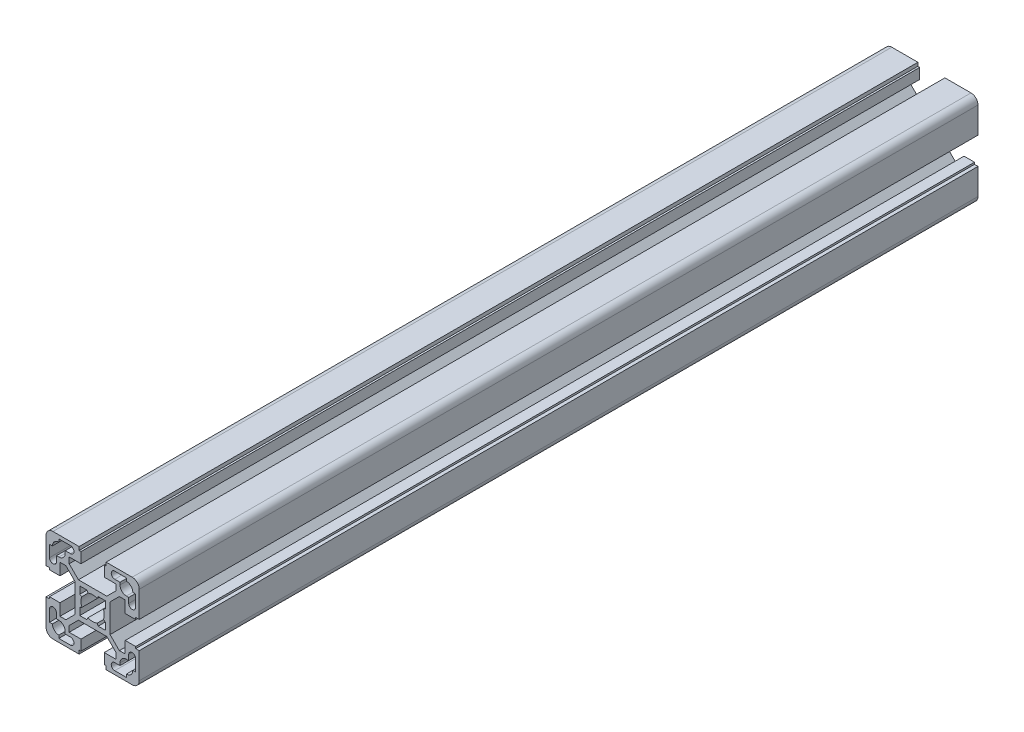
ISO-10303-21;
HEADER;
FILE_DESCRIPTION(('STEP AP214'),'2;1');
FILE_NAME('part.step','',(''),(''),'','','');
FILE_SCHEMA(('AUTOMOTIVE_DESIGN { 1 0 10303 214 1 1 1 1 }'));
ENDSEC;
DATA;
#1=APPLICATION_CONTEXT('core data for automotive mechanical design processes');
#2=APPLICATION_PROTOCOL_DEFINITION('international standard','automotive_design',2000,#1);
#3=PRODUCT_CONTEXT('',#1,'mechanical');
#4=PRODUCT('Part','Part','',(#3));
#5=PRODUCT_RELATED_PRODUCT_CATEGORY('part','',(#4));
#6=PRODUCT_DEFINITION_FORMATION('','',#4);
#7=PRODUCT_DEFINITION_CONTEXT('part definition',#1,'design');
#8=PRODUCT_DEFINITION('design','',#6,#7);
#9=PRODUCT_DEFINITION_SHAPE('','',#8);
#10=(LENGTH_UNIT() NAMED_UNIT(*) SI_UNIT(.MILLI.,.METRE.));
#11=(NAMED_UNIT(*) PLANE_ANGLE_UNIT() SI_UNIT($,.RADIAN.));
#12=(NAMED_UNIT(*) SI_UNIT($,.STERADIAN.) SOLID_ANGLE_UNIT());
#13=UNCERTAINTY_MEASURE_WITH_UNIT(LENGTH_MEASURE(1.E-05),#10,'distance_accuracy_value','');
#14=(GEOMETRIC_REPRESENTATION_CONTEXT(3) GLOBAL_UNCERTAINTY_ASSIGNED_CONTEXT((#13)) GLOBAL_UNIT_ASSIGNED_CONTEXT((#10,
#11,#12)) REPRESENTATION_CONTEXT('',''));
#15=CARTESIAN_POINT('',(0.,0.,0.));
#16=DIRECTION('',(0.,0.,1.));
#17=DIRECTION('',(1.,0.,0.));
#18=AXIS2_PLACEMENT_3D('',#15,#16,#17);
#19=CARTESIAN_POINT('',(-14.5000000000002,-11.75,360.));
#20=DIRECTION('',(0.,-1.,0.));
#21=DIRECTION('',(1.,0.,0.));
#22=AXIS2_PLACEMENT_3D('',#19,#20,#21);
#23=PLANE('',#22);
#24=DIRECTION('',(1.,0.,0.));
#25=VECTOR('',#24,1.);
#26=CARTESIAN_POINT('',(-14.5000000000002,-11.75,360.));
#27=LINE('',#26,#25);
#28=CARTESIAN_POINT('',(-14.5000000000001,-11.75,360.));
#29=VERTEX_POINT('',#28);
#30=CARTESIAN_POINT('',(-15.5000000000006,-11.75,360.));
#31=VERTEX_POINT('',#30);
#32=EDGE_CURVE('E806',#29,#31,#27,.F.);
#33=ORIENTED_EDGE('',*,*,#32,.T.);
#34=DIRECTION('',(0.,0.,1.));
#35=VECTOR('',#34,1.);
#36=CARTESIAN_POINT('',(-15.5000000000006,-11.75,360.));
#37=LINE('',#36,#35);
#38=CARTESIAN_POINT('',(-15.5000000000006,-11.75,0.));
#39=VERTEX_POINT('',#38);
#40=EDGE_CURVE('E804',#39,#31,#37,.T.);
#41=ORIENTED_EDGE('',*,*,#40,.F.);
#42=DIRECTION('',(1.,0.,0.));
#43=VECTOR('',#42,1.);
#44=CARTESIAN_POINT('',(-14.5000000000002,-11.75,0.));
#45=LINE('',#44,#43);
#46=CARTESIAN_POINT('',(-14.5000000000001,-11.75,0.));
#47=VERTEX_POINT('',#46);
#48=EDGE_CURVE('E20',#39,#47,#45,.T.);
#49=ORIENTED_EDGE('',*,*,#48,.T.);
#50=DIRECTION('',(0.,0.,-1.));
#51=VECTOR('',#50,1.);
#52=CARTESIAN_POINT('',(-14.5000000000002,-11.75,360.));
#53=LINE('',#52,#51);
#54=EDGE_CURVE('E801',#47,#29,#53,.F.);
#55=ORIENTED_EDGE('',*,*,#54,.T.);
#56=EDGE_LOOP('',(#33,#41,#49,#55));
#57=FACE_BOUND('',#56,.T.);
#58=ADVANCED_FACE('F17',(#57),#23,.T.);
#59=CARTESIAN_POINT('',(-11.7500000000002,-15.5,360.));
#60=DIRECTION('',(-1.,0.,0.));
#61=DIRECTION('',(0.,-1.,0.));
#62=AXIS2_PLACEMENT_3D('',#59,#60,#61);
#63=PLANE('',#62);
#64=DIRECTION('',(0.,-1.,0.));
#65=VECTOR('',#64,1.);
#66=CARTESIAN_POINT('',(-11.7500000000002,-15.5,360.));
#67=LINE('',#66,#65);
#68=CARTESIAN_POINT('',(-11.7500000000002,-15.5,360.));
#69=VERTEX_POINT('',#68);
#70=CARTESIAN_POINT('',(-11.7500000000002,-14.5,360.));
#71=VERTEX_POINT('',#70);
#72=EDGE_CURVE('E1218',#69,#71,#67,.F.);
#73=ORIENTED_EDGE('',*,*,#72,.T.);
#74=DIRECTION('',(0.,0.,-1.));
#75=VECTOR('',#74,1.);
#76=CARTESIAN_POINT('',(-11.7500000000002,-14.5,360.));
#77=LINE('',#76,#75);
#78=CARTESIAN_POINT('',(-11.7500000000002,-14.5,0.));
#79=VERTEX_POINT('',#78);
#80=EDGE_CURVE('E814',#71,#79,#77,.T.);
#81=ORIENTED_EDGE('',*,*,#80,.T.);
#82=DIRECTION('',(0.,-1.,0.));
#83=VECTOR('',#82,1.);
#84=CARTESIAN_POINT('',(-11.7500000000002,-15.5,0.));
#85=LINE('',#84,#83);
#86=CARTESIAN_POINT('',(-11.7500000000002,-15.5,0.));
#87=VERTEX_POINT('',#86);
#88=EDGE_CURVE('E819',#79,#87,#85,.T.);
#89=ORIENTED_EDGE('',*,*,#88,.T.);
#90=DIRECTION('',(0.,0.,-1.));
#91=VECTOR('',#90,1.);
#92=CARTESIAN_POINT('',(-11.7500000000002,-15.5,360.));
#93=LINE('',#92,#91);
#94=EDGE_CURVE('E1262',#69,#87,#93,.T.);
#95=ORIENTED_EDGE('',*,*,#94,.F.);
#96=EDGE_LOOP('',(#73,#81,#89,#95));
#97=FACE_BOUND('',#96,.T.);
#98=ADVANCED_FACE('F1555',(#97),#63,.T.);
#99=CARTESIAN_POINT('',(-14.5000000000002,-17.25,360.));
#100=DIRECTION('',(1.,0.,0.));
#101=DIRECTION('',(0.,0.,-1.));
#102=AXIS2_PLACEMENT_3D('',#99,#100,#101);
#103=PLANE('',#102);
#104=DIRECTION('',(0.,1.,0.));
#105=VECTOR('',#104,1.);
#106=CARTESIAN_POINT('',(-14.5000000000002,-17.25,360.));
#107=LINE('',#106,#105);
#108=CARTESIAN_POINT('',(-14.5000000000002,-17.25,360.));
#109=VERTEX_POINT('',#108);
#110=CARTESIAN_POINT('',(-14.5000000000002,-18.5,360.));
#111=VERTEX_POINT('',#110);
#112=EDGE_CURVE('E1214',#109,#111,#107,.F.);
#113=ORIENTED_EDGE('',*,*,#112,.T.);
#114=DIRECTION('',(0.,0.,1.));
#115=VECTOR('',#114,1.);
#116=CARTESIAN_POINT('',(-14.5000000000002,-18.5,360.));
#117=LINE('',#116,#115);
#118=CARTESIAN_POINT('',(-14.5000000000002,-18.5,0.));
#119=VERTEX_POINT('',#118);
#120=EDGE_CURVE('E1256',#119,#111,#117,.T.);
#121=ORIENTED_EDGE('',*,*,#120,.F.);
#122=DIRECTION('',(0.,1.,0.));
#123=VECTOR('',#122,1.);
#124=CARTESIAN_POINT('',(-14.5000000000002,-17.25,0.));
#125=LINE('',#124,#123);
#126=CARTESIAN_POINT('',(-14.5000000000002,-17.25,0.));
#127=VERTEX_POINT('',#126);
#128=EDGE_CURVE('E1216',#119,#127,#125,.T.);
#129=ORIENTED_EDGE('',*,*,#128,.T.);
#130=DIRECTION('',(0.,0.,-1.));
#131=VECTOR('',#130,1.);
#132=CARTESIAN_POINT('',(-14.5000000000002,-17.25,360.));
#133=LINE('',#132,#131);
#134=EDGE_CURVE('E1251',#127,#109,#133,.F.);
#135=ORIENTED_EDGE('',*,*,#134,.T.);
#136=EDGE_LOOP('',(#113,#121,#129,#135));
#137=FACE_BOUND('',#136,.T.);
#138=ADVANCED_FACE('F1560',(#137),#103,.T.);
#139=CARTESIAN_POINT('',(-18.5000000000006,-14.5000000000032,360.));
#140=DIRECTION('',(0.,1.,0.));
#141=DIRECTION('',(0.,0.,1.));
#142=AXIS2_PLACEMENT_3D('',#139,#140,#141);
#143=PLANE('',#142);
#144=DIRECTION('',(1.,0.,0.));
#145=VECTOR('',#144,1.);
#146=CARTESIAN_POINT('',(-18.5000000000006,-14.5000000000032,360.));
#147=LINE('',#146,#145);
#148=CARTESIAN_POINT('',(-18.5000000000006,-14.5000000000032,360.));
#149=VERTEX_POINT('',#148);
#150=CARTESIAN_POINT('',(-17.2500000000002,-14.5000000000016,360.));
#151=VERTEX_POINT('',#150);
#152=EDGE_CURVE('E1210',#149,#151,#147,.T.);
#153=ORIENTED_EDGE('',*,*,#152,.T.);
#154=DIRECTION('',(0.,0.,-1.));
#155=VECTOR('',#154,1.);
#156=CARTESIAN_POINT('',(-17.2500000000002,-14.5,360.));
#157=LINE('',#156,#155);
#158=CARTESIAN_POINT('',(-17.2500000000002,-14.5000000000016,0.));
#159=VERTEX_POINT('',#158);
#160=EDGE_CURVE('E1248',#151,#159,#157,.T.);
#161=ORIENTED_EDGE('',*,*,#160,.T.);
#162=DIRECTION('',(1.,0.,0.));
#163=VECTOR('',#162,1.);
#164=CARTESIAN_POINT('',(-18.5000000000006,-14.5000000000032,0.));
#165=LINE('',#164,#163);
#166=CARTESIAN_POINT('',(-18.5000000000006,-14.5000000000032,0.));
#167=VERTEX_POINT('',#166);
#168=EDGE_CURVE('E1212',#159,#167,#165,.F.);
#169=ORIENTED_EDGE('',*,*,#168,.T.);
#170=DIRECTION('',(0.,0.,-1.));
#171=VECTOR('',#170,1.);
#172=CARTESIAN_POINT('',(-18.5000000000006,-14.5000000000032,360.));
#173=LINE('',#172,#171);
#174=EDGE_CURVE('E1242',#149,#167,#173,.T.);
#175=ORIENTED_EDGE('',*,*,#174,.F.);
#176=EDGE_LOOP('',(#153,#161,#169,#175));
#177=FACE_BOUND('',#176,.T.);
#178=ADVANCED_FACE('F1569',(#177),#143,.T.);
#179=CARTESIAN_POINT('',(18.5000000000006,-14.5000000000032,360.));
#180=DIRECTION('',(0.,1.,0.));
#181=DIRECTION('',(0.,0.,1.));
#182=AXIS2_PLACEMENT_3D('',#179,#180,#181);
#183=PLANE('',#182);
#184=DIRECTION('',(1.,0.,0.));
#185=VECTOR('',#184,1.);
#186=CARTESIAN_POINT('',(18.5000000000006,-14.5000000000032,360.));
#187=LINE('',#186,#185);
#188=CARTESIAN_POINT('',(17.2500000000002,-14.5000000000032,360.));
#189=VERTEX_POINT('',#188);
#190=CARTESIAN_POINT('',(18.5000000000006,-14.5000000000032,360.));
#191=VERTEX_POINT('',#190);
#192=EDGE_CURVE('E1206',#189,#191,#187,.T.);
#193=ORIENTED_EDGE('',*,*,#192,.T.);
#194=DIRECTION('',(0.,0.,1.));
#195=VECTOR('',#194,1.);
#196=CARTESIAN_POINT('',(18.5000000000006,-14.5000000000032,360.));
#197=LINE('',#196,#195);
#198=CARTESIAN_POINT('',(18.5000000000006,-14.5000000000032,0.));
#199=VERTEX_POINT('',#198);
#200=EDGE_CURVE('E1947',#199,#191,#197,.T.);
#201=ORIENTED_EDGE('',*,*,#200,.F.);
#202=DIRECTION('',(1.,0.,0.));
#203=VECTOR('',#202,1.);
#204=CARTESIAN_POINT('',(18.5000000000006,-14.5000000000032,0.));
#205=LINE('',#204,#203);
#206=CARTESIAN_POINT('',(17.2500000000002,-14.5000000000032,0.));
#207=VERTEX_POINT('',#206);
#208=EDGE_CURVE('E1208',#199,#207,#205,.F.);
#209=ORIENTED_EDGE('',*,*,#208,.T.);
#210=DIRECTION('',(0.,0.,-1.));
#211=VECTOR('',#210,1.);
#212=CARTESIAN_POINT('',(17.2500000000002,-14.5000000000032,360.));
#213=LINE('',#212,#211);
#214=EDGE_CURVE('E1952',#207,#189,#213,.F.);
#215=ORIENTED_EDGE('',*,*,#214,.T.);
#216=EDGE_LOOP('',(#193,#201,#209,#215));
#217=FACE_BOUND('',#216,.T.);
#218=ADVANCED_FACE('F2472',(#217),#183,.T.);
#219=CARTESIAN_POINT('',(14.5000000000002,-17.25,360.));
#220=DIRECTION('',(-1.,0.,0.));
#221=DIRECTION('',(0.,0.,1.));
#222=AXIS2_PLACEMENT_3D('',#219,#220,#221);
#223=PLANE('',#222);
#224=DIRECTION('',(0.,1.,0.));
#225=VECTOR('',#224,1.);
#226=CARTESIAN_POINT('',(14.5000000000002,-17.25,360.));
#227=LINE('',#226,#225);
#228=CARTESIAN_POINT('',(14.5000000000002,-18.5,360.));
#229=VERTEX_POINT('',#228);
#230=CARTESIAN_POINT('',(14.5000000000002,-17.25,360.));
#231=VERTEX_POINT('',#230);
#232=EDGE_CURVE('E1202',#229,#231,#227,.T.);
#233=ORIENTED_EDGE('',*,*,#232,.T.);
#234=DIRECTION('',(0.,0.,-1.));
#235=VECTOR('',#234,1.);
#236=CARTESIAN_POINT('',(14.5000000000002,-17.25,360.));
#237=LINE('',#236,#235);
#238=CARTESIAN_POINT('',(14.5000000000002,-17.25,0.));
#239=VERTEX_POINT('',#238);
#240=EDGE_CURVE('E1955',#231,#239,#237,.T.);
#241=ORIENTED_EDGE('',*,*,#240,.T.);
#242=DIRECTION('',(0.,1.,0.));
#243=VECTOR('',#242,1.);
#244=CARTESIAN_POINT('',(14.5000000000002,-17.25,0.));
#245=LINE('',#244,#243);
#246=CARTESIAN_POINT('',(14.5000000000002,-18.5,0.));
#247=VERTEX_POINT('',#246);
#248=EDGE_CURVE('E1204',#239,#247,#245,.F.);
#249=ORIENTED_EDGE('',*,*,#248,.T.);
#250=DIRECTION('',(0.,0.,1.));
#251=VECTOR('',#250,1.);
#252=CARTESIAN_POINT('',(14.5000000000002,-18.5,360.));
#253=LINE('',#252,#251);
#254=EDGE_CURVE('E1958',#229,#247,#253,.F.);
#255=ORIENTED_EDGE('',*,*,#254,.F.);
#256=EDGE_LOOP('',(#233,#241,#249,#255));
#257=FACE_BOUND('',#256,.T.);
#258=ADVANCED_FACE('F2468',(#257),#223,.T.);
#259=CARTESIAN_POINT('',(11.7500000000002,-15.5,360.));
#260=DIRECTION('',(1.,0.,0.));
#261=DIRECTION('',(0.,1.,0.));
#262=AXIS2_PLACEMENT_3D('',#259,#260,#261);
#263=PLANE('',#262);
#264=DIRECTION('',(0.,1.,0.));
#265=VECTOR('',#264,1.);
#266=CARTESIAN_POINT('',(11.7500000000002,-15.5,360.));
#267=LINE('',#266,#265);
#268=CARTESIAN_POINT('',(11.7500000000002,-14.5,360.));
#269=VERTEX_POINT('',#268);
#270=CARTESIAN_POINT('',(11.7500000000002,-15.5,360.));
#271=VERTEX_POINT('',#270);
#272=EDGE_CURVE('E1198',#269,#271,#267,.F.);
#273=ORIENTED_EDGE('',*,*,#272,.T.);
#274=DIRECTION('',(0.,0.,-1.));
#275=VECTOR('',#274,1.);
#276=CARTESIAN_POINT('',(11.7500000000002,-15.5,360.));
#277=LINE('',#276,#275);
#278=CARTESIAN_POINT('',(11.7500000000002,-15.5,0.));
#279=VERTEX_POINT('',#278);
#280=EDGE_CURVE('E1964',#279,#271,#277,.F.);
#281=ORIENTED_EDGE('',*,*,#280,.F.);
#282=DIRECTION('',(0.,1.,0.));
#283=VECTOR('',#282,1.);
#284=CARTESIAN_POINT('',(11.7500000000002,-15.5,0.));
#285=LINE('',#284,#283);
#286=CARTESIAN_POINT('',(11.7500000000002,-14.5,0.));
#287=VERTEX_POINT('',#286);
#288=EDGE_CURVE('E1200',#279,#287,#285,.T.);
#289=ORIENTED_EDGE('',*,*,#288,.T.);
#290=DIRECTION('',(0.,0.,-1.));
#291=VECTOR('',#290,1.);
#292=CARTESIAN_POINT('',(11.7500000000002,-14.5,360.));
#293=LINE('',#292,#291);
#294=EDGE_CURVE('E1969',#287,#269,#293,.F.);
#295=ORIENTED_EDGE('',*,*,#294,.T.);
#296=EDGE_LOOP('',(#273,#281,#289,#295));
#297=FACE_BOUND('',#296,.T.);
#298=ADVANCED_FACE('F2465',(#297),#263,.T.);
#299=CARTESIAN_POINT('',(14.5000000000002,-11.75,360.));
#300=DIRECTION('',(0.,-1.,0.));
#301=DIRECTION('',(1.,0.,0.));
#302=AXIS2_PLACEMENT_3D('',#299,#300,#301);
#303=PLANE('',#302);
#304=DIRECTION('',(1.,0.,0.));
#305=VECTOR('',#304,1.);
#306=CARTESIAN_POINT('',(14.5000000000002,-11.75,360.));
#307=LINE('',#306,#305);
#308=CARTESIAN_POINT('',(15.5000000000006,-11.75,360.));
#309=VERTEX_POINT('',#308);
#310=CARTESIAN_POINT('',(14.5000000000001,-11.75,360.));
#311=VERTEX_POINT('',#310);
#312=EDGE_CURVE('E1194',#309,#311,#307,.F.);
#313=ORIENTED_EDGE('',*,*,#312,.T.);
#314=DIRECTION('',(0.,0.,-1.));
#315=VECTOR('',#314,1.);
#316=CARTESIAN_POINT('',(14.5000000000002,-11.75,360.));
#317=LINE('',#316,#315);
#318=CARTESIAN_POINT('',(14.5000000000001,-11.75,0.));
#319=VERTEX_POINT('',#318);
#320=EDGE_CURVE('E1940',#311,#319,#317,.T.);
#321=ORIENTED_EDGE('',*,*,#320,.T.);
#322=DIRECTION('',(1.,0.,0.));
#323=VECTOR('',#322,1.);
#324=CARTESIAN_POINT('',(14.5000000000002,-11.75,0.));
#325=LINE('',#324,#323);
#326=CARTESIAN_POINT('',(15.5000000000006,-11.75,0.));
#327=VERTEX_POINT('',#326);
#328=EDGE_CURVE('E1196',#319,#327,#325,.T.);
#329=ORIENTED_EDGE('',*,*,#328,.T.);
#330=DIRECTION('',(0.,0.,-1.));
#331=VECTOR('',#330,1.);
#332=CARTESIAN_POINT('',(15.5000000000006,-11.75,360.));
#333=LINE('',#332,#331);
#334=EDGE_CURVE('E1237',#309,#327,#333,.T.);
#335=ORIENTED_EDGE('',*,*,#334,.F.);
#336=EDGE_LOOP('',(#313,#321,#329,#335));
#337=FACE_BOUND('',#336,.T.);
#338=ADVANCED_FACE('F1939',(#337),#303,.T.);
#339=CARTESIAN_POINT('',(5.80000000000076,-18.5000000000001,360.));
#340=DIRECTION('',(1.,0.,0.));
#341=DIRECTION('',(0.,0.,-1.));
#342=AXIS2_PLACEMENT_3D('',#339,#340,#341);
#343=PLANE('',#342);
#344=DIRECTION('',(0.,0.,1.));
#345=VECTOR('',#344,1.);
#346=CARTESIAN_POINT('',(5.80000000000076,-20.,360.));
#347=LINE('',#346,#345);
#348=CARTESIAN_POINT('',(5.80000000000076,-20.,0.));
#349=VERTEX_POINT('',#348);
#350=CARTESIAN_POINT('',(5.80000000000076,-20.,360.));
#351=VERTEX_POINT('',#350);
#352=EDGE_CURVE('E1973',#349,#351,#347,.T.);
#353=ORIENTED_EDGE('',*,*,#352,.T.);
#354=DIRECTION('',(0.,1.,0.));
#355=VECTOR('',#354,1.);
#356=CARTESIAN_POINT('',(5.80000000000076,-17.,360.));
#357=LINE('',#356,#355);
#358=CARTESIAN_POINT('',(5.80000000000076,-18.5000000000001,360.));
#359=VERTEX_POINT('',#358);
#360=EDGE_CURVE('E1192',#359,#351,#357,.F.);
#361=ORIENTED_EDGE('',*,*,#360,.F.);
#362=DIRECTION('',(0.,0.,1.));
#363=VECTOR('',#362,1.);
#364=CARTESIAN_POINT('',(5.80000000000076,-18.5000000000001,360.));
#365=LINE('',#364,#363);
#366=CARTESIAN_POINT('',(5.80000000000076,-18.5000000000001,0.));
#367=VERTEX_POINT('',#366);
#368=EDGE_CURVE('E1116',#359,#367,#365,.F.);
#369=ORIENTED_EDGE('',*,*,#368,.T.);
#370=DIRECTION('',(0.,1.,0.));
#371=VECTOR('',#370,1.);
#372=CARTESIAN_POINT('',(5.80000000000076,-17.,0.));
#373=LINE('',#372,#371);
#374=EDGE_CURVE('E1190',#349,#367,#373,.T.);
#375=ORIENTED_EDGE('',*,*,#374,.F.);
#376=EDGE_LOOP('',(#353,#361,#369,#375));
#377=FACE_BOUND('',#376,.T.);
#378=ADVANCED_FACE('F2286',(#377),#343,.F.);
#379=CARTESIAN_POINT('',(20.,-5.79999999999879,360.));
#380=DIRECTION('',(0.,-1.,0.));
#381=DIRECTION('',(0.,0.,-1.));
#382=AXIS2_PLACEMENT_3D('',#379,#380,#381);
#383=PLANE('',#382);
#384=DIRECTION('',(0.,0.,1.));
#385=VECTOR('',#384,1.);
#386=CARTESIAN_POINT('',(18.5,-5.79999999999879,360.));
#387=LINE('',#386,#385);
#388=CARTESIAN_POINT('',(18.5,-5.79999999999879,0.));
#389=VERTEX_POINT('',#388);
#390=CARTESIAN_POINT('',(18.5,-5.79999999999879,360.));
#391=VERTEX_POINT('',#390);
#392=EDGE_CURVE('E1185',#389,#391,#387,.T.);
#393=ORIENTED_EDGE('',*,*,#392,.T.);
#394=DIRECTION('',(1.,0.,0.));
#395=VECTOR('',#394,1.);
#396=CARTESIAN_POINT('',(17.,-5.79999999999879,360.));
#397=LINE('',#396,#395);
#398=CARTESIAN_POINT('',(20.,-5.79999999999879,360.));
#399=VERTEX_POINT('',#398);
#400=EDGE_CURVE('E1188',#399,#391,#397,.F.);
#401=ORIENTED_EDGE('',*,*,#400,.F.);
#402=DIRECTION('',(0.,0.,1.));
#403=VECTOR('',#402,1.);
#404=CARTESIAN_POINT('',(20.,-5.79999999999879,360.));
#405=LINE('',#404,#403);
#406=CARTESIAN_POINT('',(20.,-5.79999999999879,0.));
#407=VERTEX_POINT('',#406);
#408=EDGE_CURVE('E1981',#399,#407,#405,.F.);
#409=ORIENTED_EDGE('',*,*,#408,.T.);
#410=DIRECTION('',(1.,0.,0.));
#411=VECTOR('',#410,1.);
#412=CARTESIAN_POINT('',(17.,-5.79999999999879,0.));
#413=LINE('',#412,#411);
#414=EDGE_CURVE('E1186',#389,#407,#413,.T.);
#415=ORIENTED_EDGE('',*,*,#414,.F.);
#416=EDGE_LOOP('',(#393,#401,#409,#415));
#417=FACE_BOUND('',#416,.T.);
#418=ADVANCED_FACE('F2294',(#417),#383,.F.);
#419=CARTESIAN_POINT('',(18.5,-5.79999999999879,360.));
#420=DIRECTION('',(-1.,0.,0.));
#421=DIRECTION('',(0.,0.,1.));
#422=AXIS2_PLACEMENT_3D('',#419,#420,#421);
#423=PLANE('',#422);
#424=DIRECTION('',(0.,0.,-1.));
#425=VECTOR('',#424,1.);
#426=CARTESIAN_POINT('',(18.5,-4.99999999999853,360.));
#427=LINE('',#426,#425);
#428=CARTESIAN_POINT('',(18.5,-4.99999999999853,0.));
#429=VERTEX_POINT('',#428);
#430=CARTESIAN_POINT('',(18.5,-4.99999999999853,360.));
#431=VERTEX_POINT('',#430);
#432=EDGE_CURVE('E1984',#429,#431,#427,.F.);
#433=ORIENTED_EDGE('',*,*,#432,.T.);
#434=DIRECTION('',(0.,1.,0.));
#435=VECTOR('',#434,1.);
#436=CARTESIAN_POINT('',(18.5,-17.,360.));
#437=LINE('',#436,#435);
#438=EDGE_CURVE('E1183',#391,#431,#437,.T.);
#439=ORIENTED_EDGE('',*,*,#438,.F.);
#440=ORIENTED_EDGE('',*,*,#392,.F.);
#441=DIRECTION('',(0.,1.,0.));
#442=VECTOR('',#441,1.);
#443=CARTESIAN_POINT('',(18.5,-17.,0.));
#444=LINE('',#443,#442);
#445=EDGE_CURVE('E1180',#429,#389,#444,.F.);
#446=ORIENTED_EDGE('',*,*,#445,.F.);
#447=EDGE_LOOP('',(#433,#439,#440,#446));
#448=FACE_BOUND('',#447,.T.);
#449=ADVANCED_FACE('F2297',(#448),#423,.F.);
#450=CARTESIAN_POINT('',(18.5,5.79999999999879,360.));
#451=DIRECTION('',(-1.,0.,0.));
#452=DIRECTION('',(0.,0.,1.));
#453=AXIS2_PLACEMENT_3D('',#450,#451,#452);
#454=PLANE('',#453);
#455=DIRECTION('',(0.,0.,1.));
#456=VECTOR('',#455,1.);
#457=CARTESIAN_POINT('',(18.5,5.79999999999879,360.));
#458=LINE('',#457,#456);
#459=CARTESIAN_POINT('',(18.5,5.79999999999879,0.));
#460=VERTEX_POINT('',#459);
#461=CARTESIAN_POINT('',(18.5,5.79999999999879,360.));
#462=VERTEX_POINT('',#461);
#463=EDGE_CURVE('E1175',#460,#462,#458,.T.);
#464=ORIENTED_EDGE('',*,*,#463,.T.);
#465=DIRECTION('',(0.,1.,0.));
#466=VECTOR('',#465,1.);
#467=CARTESIAN_POINT('',(18.5,-17.,360.));
#468=LINE('',#467,#466);
#469=CARTESIAN_POINT('',(18.5,4.99999999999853,360.));
#470=VERTEX_POINT('',#469);
#471=EDGE_CURVE('E1178',#470,#462,#468,.T.);
#472=ORIENTED_EDGE('',*,*,#471,.F.);
#473=DIRECTION('',(0.,0.,1.));
#474=VECTOR('',#473,1.);
#475=CARTESIAN_POINT('',(18.5,4.99999999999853,360.));
#476=LINE('',#475,#474);
#477=CARTESIAN_POINT('',(18.5,4.99999999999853,0.));
#478=VERTEX_POINT('',#477);
#479=EDGE_CURVE('E2011',#470,#478,#476,.F.);
#480=ORIENTED_EDGE('',*,*,#479,.T.);
#481=DIRECTION('',(0.,1.,0.));
#482=VECTOR('',#481,1.);
#483=CARTESIAN_POINT('',(18.5,-17.,0.));
#484=LINE('',#483,#482);
#485=EDGE_CURVE('E1176',#460,#478,#484,.F.);
#486=ORIENTED_EDGE('',*,*,#485,.F.);
#487=EDGE_LOOP('',(#464,#472,#480,#486));
#488=FACE_BOUND('',#487,.T.);
#489=ADVANCED_FACE('F2319',(#488),#454,.F.);
#490=CARTESIAN_POINT('',(20.,5.79999999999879,360.));
#491=DIRECTION('',(0.,1.,0.));
#492=DIRECTION('',(0.,0.,1.));
#493=AXIS2_PLACEMENT_3D('',#490,#491,#492);
#494=PLANE('',#493);
#495=DIRECTION('',(0.,0.,1.));
#496=VECTOR('',#495,1.);
#497=CARTESIAN_POINT('',(20.,5.79999999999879,360.));
#498=LINE('',#497,#496);
#499=CARTESIAN_POINT('',(20.,5.79999999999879,0.));
#500=VERTEX_POINT('',#499);
#501=CARTESIAN_POINT('',(20.,5.79999999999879,360.));
#502=VERTEX_POINT('',#501);
#503=EDGE_CURVE('E2014',#500,#502,#498,.T.);
#504=ORIENTED_EDGE('',*,*,#503,.T.);
#505=DIRECTION('',(1.,0.,0.));
#506=VECTOR('',#505,1.);
#507=CARTESIAN_POINT('',(17.,5.79999999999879,360.));
#508=LINE('',#507,#506);
#509=EDGE_CURVE('E1173',#462,#502,#508,.T.);
#510=ORIENTED_EDGE('',*,*,#509,.F.);
#511=ORIENTED_EDGE('',*,*,#463,.F.);
#512=DIRECTION('',(1.,0.,0.));
#513=VECTOR('',#512,1.);
#514=CARTESIAN_POINT('',(17.,5.79999999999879,0.));
#515=LINE('',#514,#513);
#516=EDGE_CURVE('E1170',#500,#460,#515,.F.);
#517=ORIENTED_EDGE('',*,*,#516,.F.);
#518=EDGE_LOOP('',(#504,#510,#511,#517));
#519=FACE_BOUND('',#518,.T.);
#520=ADVANCED_FACE('F2323',(#519),#494,.F.);
#521=CARTESIAN_POINT('',(5.80000000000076,18.5000000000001,360.));
#522=DIRECTION('',(1.,0.,0.));
#523=DIRECTION('',(0.,0.,-1.));
#524=AXIS2_PLACEMENT_3D('',#521,#522,#523);
#525=PLANE('',#524);
#526=DIRECTION('',(0.,0.,-1.));
#527=VECTOR('',#526,1.);
#528=CARTESIAN_POINT('',(5.80000000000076,18.5000000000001,360.));
#529=LINE('',#528,#527);
#530=CARTESIAN_POINT('',(5.80000000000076,18.5000000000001,0.));
#531=VERTEX_POINT('',#530);
#532=CARTESIAN_POINT('',(5.80000000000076,18.5000000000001,360.));
#533=VERTEX_POINT('',#532);
#534=EDGE_CURVE('E1165',#531,#533,#529,.F.);
#535=ORIENTED_EDGE('',*,*,#534,.T.);
#536=DIRECTION('',(0.,1.,0.));
#537=VECTOR('',#536,1.);
#538=CARTESIAN_POINT('',(5.80000000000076,-17.,360.));
#539=LINE('',#538,#537);
#540=CARTESIAN_POINT('',(5.80000000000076,20.,360.));
#541=VERTEX_POINT('',#540);
#542=EDGE_CURVE('E1168',#541,#533,#539,.F.);
#543=ORIENTED_EDGE('',*,*,#542,.F.);
#544=DIRECTION('',(0.,0.,-1.));
#545=VECTOR('',#544,1.);
#546=CARTESIAN_POINT('',(5.80000000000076,20.,360.));
#547=LINE('',#546,#545);
#548=CARTESIAN_POINT('',(5.80000000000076,20.,0.));
#549=VERTEX_POINT('',#548);
#550=EDGE_CURVE('E2022',#541,#549,#547,.T.);
#551=ORIENTED_EDGE('',*,*,#550,.T.);
#552=DIRECTION('',(0.,1.,0.));
#553=VECTOR('',#552,1.);
#554=CARTESIAN_POINT('',(5.80000000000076,-17.,0.));
#555=LINE('',#554,#553);
#556=EDGE_CURVE('E1166',#531,#549,#555,.T.);
#557=ORIENTED_EDGE('',*,*,#556,.F.);
#558=EDGE_LOOP('',(#535,#543,#551,#557));
#559=FACE_BOUND('',#558,.T.);
#560=ADVANCED_FACE('F2334',(#559),#525,.F.);
#561=CARTESIAN_POINT('',(5.00000000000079,18.5000000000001,360.));
#562=DIRECTION('',(0.,-1.,0.));
#563=DIRECTION('',(0.,0.,-1.));
#564=AXIS2_PLACEMENT_3D('',#561,#562,#563);
#565=PLANE('',#564);
#566=DIRECTION('',(0.,0.,1.));
#567=VECTOR('',#566,1.);
#568=CARTESIAN_POINT('',(5.00000000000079,18.5000000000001,360.));
#569=LINE('',#568,#567);
#570=CARTESIAN_POINT('',(5.00000000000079,18.5000000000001,0.));
#571=VERTEX_POINT('',#570);
#572=CARTESIAN_POINT('',(5.00000000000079,18.5000000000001,360.));
#573=VERTEX_POINT('',#572);
#574=EDGE_CURVE('E2025',#571,#573,#569,.T.);
#575=ORIENTED_EDGE('',*,*,#574,.T.);
#576=DIRECTION('',(1.,0.,0.));
#577=VECTOR('',#576,1.);
#578=CARTESIAN_POINT('',(17.,18.5000000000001,360.));
#579=LINE('',#578,#577);
#580=EDGE_CURVE('E1163',#533,#573,#579,.F.);
#581=ORIENTED_EDGE('',*,*,#580,.F.);
#582=ORIENTED_EDGE('',*,*,#534,.F.);
#583=DIRECTION('',(1.,0.,0.));
#584=VECTOR('',#583,1.);
#585=CARTESIAN_POINT('',(17.,18.5000000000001,0.));
#586=LINE('',#585,#584);
#587=EDGE_CURVE('E1160',#571,#531,#586,.T.);
#588=ORIENTED_EDGE('',*,*,#587,.F.);
#589=EDGE_LOOP('',(#575,#581,#582,#588));
#590=FACE_BOUND('',#589,.T.);
#591=ADVANCED_FACE('F2338',(#590),#565,.F.);
#592=CARTESIAN_POINT('',(-5.00000000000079,18.5000000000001,360.));
#593=DIRECTION('',(0.,-1.,0.));
#594=DIRECTION('',(0.,0.,-1.));
#595=AXIS2_PLACEMENT_3D('',#592,#593,#594);
#596=PLANE('',#595);
#597=DIRECTION('',(0.,0.,1.));
#598=VECTOR('',#597,1.);
#599=CARTESIAN_POINT('',(-5.80000000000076,18.5000000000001,360.));
#600=LINE('',#599,#598);
#601=CARTESIAN_POINT('',(-5.80000000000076,18.5000000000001,0.));
#602=VERTEX_POINT('',#601);
#603=CARTESIAN_POINT('',(-5.80000000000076,18.5000000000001,360.));
#604=VERTEX_POINT('',#603);
#605=EDGE_CURVE('E1155',#602,#604,#600,.T.);
#606=ORIENTED_EDGE('',*,*,#605,.T.);
#607=DIRECTION('',(1.,0.,0.));
#608=VECTOR('',#607,1.);
#609=CARTESIAN_POINT('',(17.,18.5000000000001,360.));
#610=LINE('',#609,#608);
#611=CARTESIAN_POINT('',(-5.00000000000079,18.5000000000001,360.));
#612=VERTEX_POINT('',#611);
#613=EDGE_CURVE('E1158',#612,#604,#610,.F.);
#614=ORIENTED_EDGE('',*,*,#613,.F.);
#615=DIRECTION('',(0.,0.,1.));
#616=VECTOR('',#615,1.);
#617=CARTESIAN_POINT('',(-5.00000000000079,18.5000000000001,360.));
#618=LINE('',#617,#616);
#619=CARTESIAN_POINT('',(-5.00000000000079,18.5000000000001,0.));
#620=VERTEX_POINT('',#619);
#621=EDGE_CURVE('E2052',#612,#620,#618,.F.);
#622=ORIENTED_EDGE('',*,*,#621,.T.);
#623=DIRECTION('',(1.,0.,0.));
#624=VECTOR('',#623,1.);
#625=CARTESIAN_POINT('',(17.,18.5000000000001,0.));
#626=LINE('',#625,#624);
#627=EDGE_CURVE('E1156',#602,#620,#626,.T.);
#628=ORIENTED_EDGE('',*,*,#627,.F.);
#629=EDGE_LOOP('',(#606,#614,#622,#628));
#630=FACE_BOUND('',#629,.T.);
#631=ADVANCED_FACE('F2360',(#630),#596,.F.);
#632=CARTESIAN_POINT('',(-5.80000000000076,18.5000000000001,360.));
#633=DIRECTION('',(-1.,0.,0.));
#634=DIRECTION('',(0.,0.,1.));
#635=AXIS2_PLACEMENT_3D('',#632,#633,#634);
#636=PLANE('',#635);
#637=DIRECTION('',(0.,0.,1.));
#638=VECTOR('',#637,1.);
#639=CARTESIAN_POINT('',(-5.80000000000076,20.,360.));
#640=LINE('',#639,#638);
#641=CARTESIAN_POINT('',(-5.80000000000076,20.,0.));
#642=VERTEX_POINT('',#641);
#643=CARTESIAN_POINT('',(-5.80000000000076,20.,360.));
#644=VERTEX_POINT('',#643);
#645=EDGE_CURVE('E2055',#642,#644,#640,.T.);
#646=ORIENTED_EDGE('',*,*,#645,.T.);
#647=DIRECTION('',(0.,1.,0.));
#648=VECTOR('',#647,1.);
#649=CARTESIAN_POINT('',(-5.80000000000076,-17.,360.));
#650=LINE('',#649,#648);
#651=EDGE_CURVE('E1153',#604,#644,#650,.T.);
#652=ORIENTED_EDGE('',*,*,#651,.F.);
#653=ORIENTED_EDGE('',*,*,#605,.F.);
#654=DIRECTION('',(0.,1.,0.));
#655=VECTOR('',#654,1.);
#656=CARTESIAN_POINT('',(-5.80000000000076,-17.,0.));
#657=LINE('',#656,#655);
#658=EDGE_CURVE('E1150',#642,#602,#657,.F.);
#659=ORIENTED_EDGE('',*,*,#658,.F.);
#660=EDGE_LOOP('',(#646,#652,#653,#659));
#661=FACE_BOUND('',#660,.T.);
#662=ADVANCED_FACE('F2364',(#661),#636,.F.);
#663=CARTESIAN_POINT('',(-20.,5.79999999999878,360.));
#664=DIRECTION('',(0.,1.,0.));
#665=DIRECTION('',(0.,0.,1.));
#666=AXIS2_PLACEMENT_3D('',#663,#664,#665);
#667=PLANE('',#666);
#668=DIRECTION('',(0.,0.,-1.));
#669=VECTOR('',#668,1.);
#670=CARTESIAN_POINT('',(-18.5,5.79999999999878,360.));
#671=LINE('',#670,#669);
#672=CARTESIAN_POINT('',(-18.5,5.79999999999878,0.));
#673=VERTEX_POINT('',#672);
#674=CARTESIAN_POINT('',(-18.5,5.79999999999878,360.));
#675=VERTEX_POINT('',#674);
#676=EDGE_CURVE('E1145',#673,#675,#671,.F.);
#677=ORIENTED_EDGE('',*,*,#676,.T.);
#678=DIRECTION('',(1.,0.,0.));
#679=VECTOR('',#678,1.);
#680=CARTESIAN_POINT('',(17.,5.79999999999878,360.));
#681=LINE('',#680,#679);
#682=CARTESIAN_POINT('',(-20.,5.79999999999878,360.));
#683=VERTEX_POINT('',#682);
#684=EDGE_CURVE('E1148',#683,#675,#681,.T.);
#685=ORIENTED_EDGE('',*,*,#684,.F.);
#686=DIRECTION('',(0.,0.,1.));
#687=VECTOR('',#686,1.);
#688=CARTESIAN_POINT('',(-20.,5.79999999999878,360.));
#689=LINE('',#688,#687);
#690=CARTESIAN_POINT('',(-20.,5.79999999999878,0.));
#691=VERTEX_POINT('',#690);
#692=EDGE_CURVE('E2063',#683,#691,#689,.F.);
#693=ORIENTED_EDGE('',*,*,#692,.T.);
#694=DIRECTION('',(1.,0.,0.));
#695=VECTOR('',#694,1.);
#696=CARTESIAN_POINT('',(17.,5.79999999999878,0.));
#697=LINE('',#696,#695);
#698=EDGE_CURVE('E1146',#673,#691,#697,.F.);
#699=ORIENTED_EDGE('',*,*,#698,.F.);
#700=EDGE_LOOP('',(#677,#685,#693,#699));
#701=FACE_BOUND('',#700,.T.);
#702=ADVANCED_FACE('F2375',(#701),#667,.F.);
#703=CARTESIAN_POINT('',(-18.5,5.79999999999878,360.));
#704=DIRECTION('',(1.,0.,0.));
#705=DIRECTION('',(0.,0.,-1.));
#706=AXIS2_PLACEMENT_3D('',#703,#704,#705);
#707=PLANE('',#706);
#708=DIRECTION('',(0.,0.,1.));
#709=VECTOR('',#708,1.);
#710=CARTESIAN_POINT('',(-18.5,4.99999999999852,360.));
#711=LINE('',#710,#709);
#712=CARTESIAN_POINT('',(-18.5,4.99999999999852,0.));
#713=VERTEX_POINT('',#712);
#714=CARTESIAN_POINT('',(-18.5,4.99999999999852,360.));
#715=VERTEX_POINT('',#714);
#716=EDGE_CURVE('E2066',#713,#715,#711,.T.);
#717=ORIENTED_EDGE('',*,*,#716,.T.);
#718=DIRECTION('',(0.,1.,0.));
#719=VECTOR('',#718,1.);
#720=CARTESIAN_POINT('',(-18.5,-17.,360.));
#721=LINE('',#720,#719);
#722=EDGE_CURVE('E1143',#675,#715,#721,.F.);
#723=ORIENTED_EDGE('',*,*,#722,.F.);
#724=ORIENTED_EDGE('',*,*,#676,.F.);
#725=DIRECTION('',(0.,1.,0.));
#726=VECTOR('',#725,1.);
#727=CARTESIAN_POINT('',(-18.5,-17.,0.));
#728=LINE('',#727,#726);
#729=EDGE_CURVE('E1140',#713,#673,#728,.T.);
#730=ORIENTED_EDGE('',*,*,#729,.F.);
#731=EDGE_LOOP('',(#717,#723,#724,#730));
#732=FACE_BOUND('',#731,.T.);
#733=ADVANCED_FACE('F2379',(#732),#707,.F.);
#734=CARTESIAN_POINT('',(-18.5,-5.79999999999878,360.));
#735=DIRECTION('',(1.,0.,0.));
#736=DIRECTION('',(0.,0.,-1.));
#737=AXIS2_PLACEMENT_3D('',#734,#735,#736);
#738=PLANE('',#737);
#739=DIRECTION('',(0.,0.,-1.));
#740=VECTOR('',#739,1.);
#741=CARTESIAN_POINT('',(-18.5,-5.79999999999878,360.));
#742=LINE('',#741,#740);
#743=CARTESIAN_POINT('',(-18.5,-5.79999999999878,0.));
#744=VERTEX_POINT('',#743);
#745=CARTESIAN_POINT('',(-18.5,-5.79999999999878,360.));
#746=VERTEX_POINT('',#745);
#747=EDGE_CURVE('E1135',#744,#746,#742,.F.);
#748=ORIENTED_EDGE('',*,*,#747,.T.);
#749=DIRECTION('',(0.,1.,0.));
#750=VECTOR('',#749,1.);
#751=CARTESIAN_POINT('',(-18.5,-17.,360.));
#752=LINE('',#751,#750);
#753=CARTESIAN_POINT('',(-18.5,-4.99999999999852,360.));
#754=VERTEX_POINT('',#753);
#755=EDGE_CURVE('E1138',#754,#746,#752,.F.);
#756=ORIENTED_EDGE('',*,*,#755,.F.);
#757=DIRECTION('',(0.,0.,1.));
#758=VECTOR('',#757,1.);
#759=CARTESIAN_POINT('',(-18.5,-4.99999999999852,360.));
#760=LINE('',#759,#758);
#761=CARTESIAN_POINT('',(-18.5,-4.99999999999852,0.));
#762=VERTEX_POINT('',#761);
#763=EDGE_CURVE('E2093',#754,#762,#760,.F.);
#764=ORIENTED_EDGE('',*,*,#763,.T.);
#765=DIRECTION('',(0.,1.,0.));
#766=VECTOR('',#765,1.);
#767=CARTESIAN_POINT('',(-18.5,-17.,0.));
#768=LINE('',#767,#766);
#769=EDGE_CURVE('E1136',#744,#762,#768,.T.);
#770=ORIENTED_EDGE('',*,*,#769,.F.);
#771=EDGE_LOOP('',(#748,#756,#764,#770));
#772=FACE_BOUND('',#771,.T.);
#773=ADVANCED_FACE('F2401',(#772),#738,.F.);
#774=CARTESIAN_POINT('',(-20.,-5.79999999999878,360.));
#775=DIRECTION('',(0.,-1.,0.));
#776=DIRECTION('',(0.,0.,-1.));
#777=AXIS2_PLACEMENT_3D('',#774,#775,#776);
#778=PLANE('',#777);
#779=DIRECTION('',(0.,0.,1.));
#780=VECTOR('',#779,1.);
#781=CARTESIAN_POINT('',(-20.,-5.79999999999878,360.));
#782=LINE('',#781,#780);
#783=CARTESIAN_POINT('',(-20.,-5.79999999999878,0.));
#784=VERTEX_POINT('',#783);
#785=CARTESIAN_POINT('',(-20.,-5.79999999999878,360.));
#786=VERTEX_POINT('',#785);
#787=EDGE_CURVE('E2096',#784,#786,#782,.T.);
#788=ORIENTED_EDGE('',*,*,#787,.T.);
#789=DIRECTION('',(1.,0.,0.));
#790=VECTOR('',#789,1.);
#791=CARTESIAN_POINT('',(17.,-5.79999999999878,360.));
#792=LINE('',#791,#790);
#793=EDGE_CURVE('E1133',#746,#786,#792,.F.);
#794=ORIENTED_EDGE('',*,*,#793,.F.);
#795=ORIENTED_EDGE('',*,*,#747,.F.);
#796=DIRECTION('',(1.,0.,0.));
#797=VECTOR('',#796,1.);
#798=CARTESIAN_POINT('',(17.,-5.79999999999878,0.));
#799=LINE('',#798,#797);
#800=EDGE_CURVE('E1130',#784,#744,#799,.T.);
#801=ORIENTED_EDGE('',*,*,#800,.F.);
#802=EDGE_LOOP('',(#788,#794,#795,#801));
#803=FACE_BOUND('',#802,.T.);
#804=ADVANCED_FACE('F2405',(#803),#778,.F.);
#805=CARTESIAN_POINT('',(-5.80000000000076,-18.5000000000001,360.));
#806=DIRECTION('',(-1.,0.,0.));
#807=DIRECTION('',(0.,0.,1.));
#808=AXIS2_PLACEMENT_3D('',#805,#806,#807);
#809=PLANE('',#808);
#810=DIRECTION('',(0.,0.,1.));
#811=VECTOR('',#810,1.);
#812=CARTESIAN_POINT('',(-5.80000000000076,-18.5000000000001,360.));
#813=LINE('',#812,#811);
#814=CARTESIAN_POINT('',(-5.80000000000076,-18.5000000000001,0.));
#815=VERTEX_POINT('',#814);
#816=CARTESIAN_POINT('',(-5.80000000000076,-18.5000000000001,360.));
#817=VERTEX_POINT('',#816);
#818=EDGE_CURVE('E1125',#815,#817,#813,.T.);
#819=ORIENTED_EDGE('',*,*,#818,.T.);
#820=DIRECTION('',(0.,1.,0.));
#821=VECTOR('',#820,1.);
#822=CARTESIAN_POINT('',(-5.80000000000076,-17.,360.));
#823=LINE('',#822,#821);
#824=CARTESIAN_POINT('',(-5.80000000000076,-20.,360.));
#825=VERTEX_POINT('',#824);
#826=EDGE_CURVE('E1128',#825,#817,#823,.T.);
#827=ORIENTED_EDGE('',*,*,#826,.F.);
#828=DIRECTION('',(0.,0.,1.));
#829=VECTOR('',#828,1.);
#830=CARTESIAN_POINT('',(-5.80000000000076,-20.,360.));
#831=LINE('',#830,#829);
#832=CARTESIAN_POINT('',(-5.80000000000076,-20.,0.));
#833=VERTEX_POINT('',#832);
#834=EDGE_CURVE('E2104',#825,#833,#831,.F.);
#835=ORIENTED_EDGE('',*,*,#834,.T.);
#836=DIRECTION('',(0.,1.,0.));
#837=VECTOR('',#836,1.);
#838=CARTESIAN_POINT('',(-5.80000000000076,-17.,0.));
#839=LINE('',#838,#837);
#840=EDGE_CURVE('E1126',#815,#833,#839,.F.);
#841=ORIENTED_EDGE('',*,*,#840,.F.);
#842=EDGE_LOOP('',(#819,#827,#835,#841));
#843=FACE_BOUND('',#842,.T.);
#844=ADVANCED_FACE('F2416',(#843),#809,.F.);
#845=CARTESIAN_POINT('',(-5.00000000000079,-18.5000000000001,360.));
#846=DIRECTION('',(0.,1.,0.));
#847=DIRECTION('',(0.,0.,1.));
#848=AXIS2_PLACEMENT_3D('',#845,#846,#847);
#849=PLANE('',#848);
#850=DIRECTION('',(0.,0.,1.));
#851=VECTOR('',#850,1.);
#852=CARTESIAN_POINT('',(-5.00000000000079,-18.5000000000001,360.));
#853=LINE('',#852,#851);
#854=CARTESIAN_POINT('',(-5.00000000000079,-18.5000000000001,0.));
#855=VERTEX_POINT('',#854);
#856=CARTESIAN_POINT('',(-5.00000000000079,-18.5000000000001,360.));
#857=VERTEX_POINT('',#856);
#858=EDGE_CURVE('E2107',#855,#857,#853,.T.);
#859=ORIENTED_EDGE('',*,*,#858,.T.);
#860=DIRECTION('',(1.,0.,0.));
#861=VECTOR('',#860,1.);
#862=CARTESIAN_POINT('',(17.,-18.5000000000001,360.));
#863=LINE('',#862,#861);
#864=EDGE_CURVE('E1123',#817,#857,#863,.T.);
#865=ORIENTED_EDGE('',*,*,#864,.F.);
#866=ORIENTED_EDGE('',*,*,#818,.F.);
#867=DIRECTION('',(1.,0.,0.));
#868=VECTOR('',#867,1.);
#869=CARTESIAN_POINT('',(17.,-18.5000000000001,0.));
#870=LINE('',#869,#868);
#871=EDGE_CURVE('E1120',#855,#815,#870,.F.);
#872=ORIENTED_EDGE('',*,*,#871,.F.);
#873=EDGE_LOOP('',(#859,#865,#866,#872));
#874=FACE_BOUND('',#873,.T.);
#875=ADVANCED_FACE('F2420',(#874),#849,.F.);
#876=CARTESIAN_POINT('',(5.00000000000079,-18.5000000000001,360.));
#877=DIRECTION('',(0.,1.,0.));
#878=DIRECTION('',(0.,0.,1.));
#879=AXIS2_PLACEMENT_3D('',#876,#877,#878);
#880=PLANE('',#879);
#881=ORIENTED_EDGE('',*,*,#368,.F.);
#882=DIRECTION('',(1.,0.,0.));
#883=VECTOR('',#882,1.);
#884=CARTESIAN_POINT('',(17.,-18.5000000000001,360.));
#885=LINE('',#884,#883);
#886=CARTESIAN_POINT('',(5.00000000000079,-18.5000000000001,360.));
#887=VERTEX_POINT('',#886);
#888=EDGE_CURVE('E1117',#887,#359,#885,.T.);
#889=ORIENTED_EDGE('',*,*,#888,.F.);
#890=DIRECTION('',(0.,0.,1.));
#891=VECTOR('',#890,1.);
#892=CARTESIAN_POINT('',(5.00000000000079,-18.5000000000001,360.));
#893=LINE('',#892,#891);
#894=CARTESIAN_POINT('',(5.00000000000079,-18.5000000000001,0.));
#895=VERTEX_POINT('',#894);
#896=EDGE_CURVE('E2126',#887,#895,#893,.F.);
#897=ORIENTED_EDGE('',*,*,#896,.T.);
#898=DIRECTION('',(1.,0.,0.));
#899=VECTOR('',#898,1.);
#900=CARTESIAN_POINT('',(17.,-18.5000000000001,0.));
#901=LINE('',#900,#899);
#902=EDGE_CURVE('E1114',#367,#895,#901,.F.);
#903=ORIENTED_EDGE('',*,*,#902,.F.);
#904=EDGE_LOOP('',(#881,#889,#897,#903));
#905=FACE_BOUND('',#904,.T.);
#906=ADVANCED_FACE('F2277',(#905),#880,.F.);
#907=CARTESIAN_POINT('',(14.5000000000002,11.75,360.));
#908=DIRECTION('',(0.,1.,0.));
#909=DIRECTION('',(-1.,0.,0.));
#910=AXIS2_PLACEMENT_3D('',#907,#908,#909);
#911=PLANE('',#910);
#912=DIRECTION('',(-1.,0.,0.));
#913=VECTOR('',#912,1.);
#914=CARTESIAN_POINT('',(14.5000000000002,11.75,360.));
#915=LINE('',#914,#913);
#916=CARTESIAN_POINT('',(14.5000000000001,11.75,360.));
#917=VERTEX_POINT('',#916);
#918=CARTESIAN_POINT('',(15.5000000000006,11.75,360.));
#919=VERTEX_POINT('',#918);
#920=EDGE_CURVE('E1110',#917,#919,#915,.F.);
#921=ORIENTED_EDGE('',*,*,#920,.T.);
#922=DIRECTION('',(0.,0.,-1.));
#923=VECTOR('',#922,1.);
#924=CARTESIAN_POINT('',(15.5000000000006,11.75,360.));
#925=LINE('',#924,#923);
#926=CARTESIAN_POINT('',(15.5000000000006,11.75,0.));
#927=VERTEX_POINT('',#926);
#928=EDGE_CURVE('E2129',#927,#919,#925,.F.);
#929=ORIENTED_EDGE('',*,*,#928,.F.);
#930=DIRECTION('',(-1.,0.,0.));
#931=VECTOR('',#930,1.);
#932=CARTESIAN_POINT('',(14.5000000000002,11.75,0.));
#933=LINE('',#932,#931);
#934=CARTESIAN_POINT('',(14.5000000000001,11.75,0.));
#935=VERTEX_POINT('',#934);
#936=EDGE_CURVE('E1112',#927,#935,#933,.T.);
#937=ORIENTED_EDGE('',*,*,#936,.T.);
#938=DIRECTION('',(0.,0.,-1.));
#939=VECTOR('',#938,1.);
#940=CARTESIAN_POINT('',(14.5000000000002,11.75,360.));
#941=LINE('',#940,#939);
#942=EDGE_CURVE('E2132',#935,#917,#941,.F.);
#943=ORIENTED_EDGE('',*,*,#942,.T.);
#944=EDGE_LOOP('',(#921,#929,#937,#943));
#945=FACE_BOUND('',#944,.T.);
#946=ADVANCED_FACE('F2432',(#945),#911,.T.);
#947=CARTESIAN_POINT('',(11.7500000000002,15.5,360.));
#948=DIRECTION('',(1.,0.,0.));
#949=DIRECTION('',(0.,1.,0.));
#950=AXIS2_PLACEMENT_3D('',#947,#948,#949);
#951=PLANE('',#950);
#952=DIRECTION('',(0.,1.,0.));
#953=VECTOR('',#952,1.);
#954=CARTESIAN_POINT('',(11.7500000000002,15.5,360.));
#955=LINE('',#954,#953);
#956=CARTESIAN_POINT('',(11.7500000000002,15.5,360.));
#957=VERTEX_POINT('',#956);
#958=CARTESIAN_POINT('',(11.7500000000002,14.5,360.));
#959=VERTEX_POINT('',#958);
#960=EDGE_CURVE('E1106',#957,#959,#955,.F.);
#961=ORIENTED_EDGE('',*,*,#960,.T.);
#962=DIRECTION('',(0.,0.,-1.));
#963=VECTOR('',#962,1.);
#964=CARTESIAN_POINT('',(11.7500000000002,14.5,360.));
#965=LINE('',#964,#963);
#966=CARTESIAN_POINT('',(11.7500000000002,14.5,0.));
#967=VERTEX_POINT('',#966);
#968=EDGE_CURVE('E2135',#959,#967,#965,.T.);
#969=ORIENTED_EDGE('',*,*,#968,.T.);
#970=DIRECTION('',(0.,1.,0.));
#971=VECTOR('',#970,1.);
#972=CARTESIAN_POINT('',(11.7500000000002,15.5,0.));
#973=LINE('',#972,#971);
#974=CARTESIAN_POINT('',(11.7500000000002,15.5,0.));
#975=VERTEX_POINT('',#974);
#976=EDGE_CURVE('E1108',#967,#975,#973,.T.);
#977=ORIENTED_EDGE('',*,*,#976,.T.);
#978=DIRECTION('',(0.,0.,1.));
#979=VECTOR('',#978,1.);
#980=CARTESIAN_POINT('',(11.7500000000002,15.5,360.));
#981=LINE('',#980,#979);
#982=EDGE_CURVE('E2138',#957,#975,#981,.F.);
#983=ORIENTED_EDGE('',*,*,#982,.F.);
#984=EDGE_LOOP('',(#961,#969,#977,#983));
#985=FACE_BOUND('',#984,.T.);
#986=ADVANCED_FACE('F2634',(#985),#951,.T.);
#987=CARTESIAN_POINT('',(14.5000000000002,17.25,360.));
#988=DIRECTION('',(-1.,0.,0.));
#989=DIRECTION('',(0.,0.,1.));
#990=AXIS2_PLACEMENT_3D('',#987,#988,#989);
#991=PLANE('',#990);
#992=DIRECTION('',(0.,1.,0.));
#993=VECTOR('',#992,1.);
#994=CARTESIAN_POINT('',(14.5000000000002,17.25,360.));
#995=LINE('',#994,#993);
#996=CARTESIAN_POINT('',(14.5000000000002,17.25,360.));
#997=VERTEX_POINT('',#996);
#998=CARTESIAN_POINT('',(14.5000000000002,18.5,360.));
#999=VERTEX_POINT('',#998);
#1000=EDGE_CURVE('E1102',#997,#999,#995,.T.);
#1001=ORIENTED_EDGE('',*,*,#1000,.T.);
#1002=DIRECTION('',(0.,0.,-1.));
#1003=VECTOR('',#1002,1.);
#1004=CARTESIAN_POINT('',(14.5000000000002,18.5,360.));
#1005=LINE('',#1004,#1003);
#1006=CARTESIAN_POINT('',(14.5000000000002,18.5,0.));
#1007=VERTEX_POINT('',#1006);
#1008=EDGE_CURVE('E2144',#1007,#999,#1005,.F.);
#1009=ORIENTED_EDGE('',*,*,#1008,.F.);
#1010=DIRECTION('',(0.,1.,0.));
#1011=VECTOR('',#1010,1.);
#1012=CARTESIAN_POINT('',(14.5000000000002,17.25,0.));
#1013=LINE('',#1012,#1011);
#1014=CARTESIAN_POINT('',(14.5000000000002,17.25,0.));
#1015=VERTEX_POINT('',#1014);
#1016=EDGE_CURVE('E1104',#1007,#1015,#1013,.F.);
#1017=ORIENTED_EDGE('',*,*,#1016,.T.);
#1018=DIRECTION('',(0.,0.,-1.));
#1019=VECTOR('',#1018,1.);
#1020=CARTESIAN_POINT('',(14.5000000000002,17.25,360.));
#1021=LINE('',#1020,#1019);
#1022=EDGE_CURVE('E2150',#1015,#997,#1021,.F.);
#1023=ORIENTED_EDGE('',*,*,#1022,.T.);
#1024=EDGE_LOOP('',(#1001,#1009,#1017,#1023));
#1025=FACE_BOUND('',#1024,.T.);
#1026=ADVANCED_FACE('F2643',(#1025),#991,.T.);
#1027=CARTESIAN_POINT('',(18.5000000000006,14.5000000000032,360.));
#1028=DIRECTION('',(0.,-1.,0.));
#1029=DIRECTION('',(0.,0.,-1.));
#1030=AXIS2_PLACEMENT_3D('',#1027,#1028,#1029);
#1031=PLANE('',#1030);
#1032=DIRECTION('',(1.,0.,0.));
#1033=VECTOR('',#1032,1.);
#1034=CARTESIAN_POINT('',(18.5000000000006,14.5000000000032,360.));
#1035=LINE('',#1034,#1033);
#1036=CARTESIAN_POINT('',(18.5000000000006,14.5000000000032,360.));
#1037=VERTEX_POINT('',#1036);
#1038=CARTESIAN_POINT('',(17.2500000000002,14.5000000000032,360.));
#1039=VERTEX_POINT('',#1038);
#1040=EDGE_CURVE('E1098',#1037,#1039,#1035,.F.);
#1041=ORIENTED_EDGE('',*,*,#1040,.T.);
#1042=DIRECTION('',(0.,0.,-1.));
#1043=VECTOR('',#1042,1.);
#1044=CARTESIAN_POINT('',(17.2500000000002,14.5000000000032,360.));
#1045=LINE('',#1044,#1043);
#1046=CARTESIAN_POINT('',(17.2500000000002,14.5000000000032,0.));
#1047=VERTEX_POINT('',#1046);
#1048=EDGE_CURVE('E2153',#1039,#1047,#1045,.T.);
#1049=ORIENTED_EDGE('',*,*,#1048,.T.);
#1050=DIRECTION('',(1.,0.,0.));
#1051=VECTOR('',#1050,1.);
#1052=CARTESIAN_POINT('',(18.5000000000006,14.5000000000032,0.));
#1053=LINE('',#1052,#1051);
#1054=CARTESIAN_POINT('',(18.5000000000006,14.5000000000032,0.));
#1055=VERTEX_POINT('',#1054);
#1056=EDGE_CURVE('E1100',#1047,#1055,#1053,.T.);
#1057=ORIENTED_EDGE('',*,*,#1056,.T.);
#1058=DIRECTION('',(0.,0.,1.));
#1059=VECTOR('',#1058,1.);
#1060=CARTESIAN_POINT('',(18.5000000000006,14.5000000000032,360.));
#1061=LINE('',#1060,#1059);
#1062=EDGE_CURVE('E2156',#1037,#1055,#1061,.F.);
#1063=ORIENTED_EDGE('',*,*,#1062,.F.);
#1064=EDGE_LOOP('',(#1041,#1049,#1057,#1063));
#1065=FACE_BOUND('',#1064,.T.);
#1066=ADVANCED_FACE('F2653',(#1065),#1031,.T.);
#1067=CARTESIAN_POINT('',(4.58333333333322,1.99826313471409,360.));
#1068=DIRECTION('',(-0.399652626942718,0.91666666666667,0.));
#1069=DIRECTION('',(-0.91666666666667,-0.399652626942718,0.));
#1070=AXIS2_PLACEMENT_3D('',#1067,#1068,#1069);
#1071=PLANE('',#1070);
#1072=DIRECTION('',(-0.91666666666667,-0.399652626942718,0.));
#1073=VECTOR('',#1072,1.);
#1074=CARTESIAN_POINT('',(4.58333333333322,1.99826313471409,360.));
#1075=LINE('',#1074,#1073);
#1076=CARTESIAN_POINT('',(4.58333333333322,1.99826313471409,360.));
#1077=VERTEX_POINT('',#1076);
#1078=CARTESIAN_POINT('',(5.49999999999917,2.39791576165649,360.));
#1079=VERTEX_POINT('',#1078);
#1080=EDGE_CURVE('E1094',#1077,#1079,#1075,.F.);
#1081=ORIENTED_EDGE('',*,*,#1080,.T.);
#1082=DIRECTION('',(0.,0.,1.));
#1083=VECTOR('',#1082,1.);
#1084=CARTESIAN_POINT('',(5.49999999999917,2.39791576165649,360.));
#1085=LINE('',#1084,#1083);
#1086=CARTESIAN_POINT('',(5.49999999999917,2.39791576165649,0.));
#1087=VERTEX_POINT('',#1086);
#1088=EDGE_CURVE('E2168',#1087,#1079,#1085,.T.);
#1089=ORIENTED_EDGE('',*,*,#1088,.F.);
#1090=DIRECTION('',(-0.91666666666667,-0.399652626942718,0.));
#1091=VECTOR('',#1090,1.);
#1092=CARTESIAN_POINT('',(4.58333333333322,1.99826313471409,0.));
#1093=LINE('',#1092,#1091);
#1094=CARTESIAN_POINT('',(4.58333333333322,1.99826313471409,0.));
#1095=VERTEX_POINT('',#1094);
#1096=EDGE_CURVE('E1096',#1087,#1095,#1093,.T.);
#1097=ORIENTED_EDGE('',*,*,#1096,.T.);
#1098=DIRECTION('',(0.,0.,-1.));
#1099=VECTOR('',#1098,1.);
#1100=CARTESIAN_POINT('',(4.58333333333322,1.99826313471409,360.));
#1101=LINE('',#1100,#1099);
#1102=EDGE_CURVE('E2174',#1095,#1077,#1101,.F.);
#1103=ORIENTED_EDGE('',*,*,#1102,.T.);
#1104=EDGE_LOOP('',(#1081,#1089,#1097,#1103));
#1105=FACE_BOUND('',#1104,.T.);
#1106=ADVANCED_FACE('F2663',(#1105),#1071,.T.);
#1107=CARTESIAN_POINT('',(4.58333333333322,-1.99826313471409,360.));
#1108=DIRECTION('',(-0.399652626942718,-0.91666666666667,0.));
#1109=DIRECTION('',(0.91666666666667,-0.399652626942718,0.));
#1110=AXIS2_PLACEMENT_3D('',#1107,#1108,#1109);
#1111=PLANE('',#1110);
#1112=DIRECTION('',(0.91666666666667,-0.399652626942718,0.));
#1113=VECTOR('',#1112,1.);
#1114=CARTESIAN_POINT('',(4.58333333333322,-1.99826313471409,360.));
#1115=LINE('',#1114,#1113);
#1116=CARTESIAN_POINT('',(5.49999999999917,-2.39791576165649,360.));
#1117=VERTEX_POINT('',#1116);
#1118=CARTESIAN_POINT('',(4.58333333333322,-1.99826313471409,360.));
#1119=VERTEX_POINT('',#1118);
#1120=EDGE_CURVE('E1090',#1117,#1119,#1115,.F.);
#1121=ORIENTED_EDGE('',*,*,#1120,.T.);
#1122=DIRECTION('',(0.,0.,-1.));
#1123=VECTOR('',#1122,1.);
#1124=CARTESIAN_POINT('',(4.58333333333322,-1.99826313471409,360.));
#1125=LINE('',#1124,#1123);
#1126=CARTESIAN_POINT('',(4.58333333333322,-1.99826313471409,0.));
#1127=VERTEX_POINT('',#1126);
#1128=EDGE_CURVE('E2177',#1119,#1127,#1125,.T.);
#1129=ORIENTED_EDGE('',*,*,#1128,.T.);
#1130=DIRECTION('',(0.91666666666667,-0.399652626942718,0.));
#1131=VECTOR('',#1130,1.);
#1132=CARTESIAN_POINT('',(4.58333333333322,-1.99826313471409,0.));
#1133=LINE('',#1132,#1131);
#1134=CARTESIAN_POINT('',(5.49999999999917,-2.39791576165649,0.));
#1135=VERTEX_POINT('',#1134);
#1136=EDGE_CURVE('E1092',#1127,#1135,#1133,.T.);
#1137=ORIENTED_EDGE('',*,*,#1136,.T.);
#1138=DIRECTION('',(0.,0.,1.));
#1139=VECTOR('',#1138,1.);
#1140=CARTESIAN_POINT('',(5.49999999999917,-2.39791576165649,360.));
#1141=LINE('',#1140,#1139);
#1142=EDGE_CURVE('E2180',#1117,#1135,#1141,.F.);
#1143=ORIENTED_EDGE('',*,*,#1142,.F.);
#1144=EDGE_LOOP('',(#1121,#1129,#1137,#1143));
#1145=FACE_BOUND('',#1144,.T.);
#1146=ADVANCED_FACE('F2673',(#1145),#1111,.T.);
#1147=CARTESIAN_POINT('',(2.39791576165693,-5.49999999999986,360.));
#1148=DIRECTION('',(0.916666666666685,0.399652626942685,0.));
#1149=DIRECTION('',(-0.399652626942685,0.916666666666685,0.));
#1150=AXIS2_PLACEMENT_3D('',#1147,#1148,#1149);
#1151=PLANE('',#1150);
#1152=DIRECTION('',(-0.399652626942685,0.916666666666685,0.));
#1153=VECTOR('',#1152,1.);
#1154=CARTESIAN_POINT('',(2.39791576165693,-5.49999999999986,360.));
#1155=LINE('',#1154,#1153);
#1156=CARTESIAN_POINT('',(1.99826313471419,-4.58333333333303,360.));
#1157=VERTEX_POINT('',#1156);
#1158=CARTESIAN_POINT('',(2.39791576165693,-5.49999999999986,360.));
#1159=VERTEX_POINT('',#1158);
#1160=EDGE_CURVE('E1086',#1157,#1159,#1155,.F.);
#1161=ORIENTED_EDGE('',*,*,#1160,.T.);
#1162=DIRECTION('',(0.,0.,1.));
#1163=VECTOR('',#1162,1.);
#1164=CARTESIAN_POINT('',(2.39791576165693,-5.49999999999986,360.));
#1165=LINE('',#1164,#1163);
#1166=CARTESIAN_POINT('',(2.39791576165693,-5.49999999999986,-1.11022302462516E-13));
#1167=VERTEX_POINT('',#1166);
#1168=EDGE_CURVE('E2183',#1167,#1159,#1165,.T.);
#1169=ORIENTED_EDGE('',*,*,#1168,.F.);
#1170=DIRECTION('',(-0.399652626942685,0.916666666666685,0.));
#1171=VECTOR('',#1170,1.);
#1172=CARTESIAN_POINT('',(2.39791576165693,-5.49999999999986,-2.22044604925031E-13));
#1173=LINE('',#1172,#1171);
#1174=CARTESIAN_POINT('',(1.99826313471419,-4.58333333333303,-1.11022302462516E-13));
#1175=VERTEX_POINT('',#1174);
#1176=EDGE_CURVE('E1088',#1167,#1175,#1173,.T.);
#1177=ORIENTED_EDGE('',*,*,#1176,.T.);
#1178=DIRECTION('',(0.,0.,-1.));
#1179=VECTOR('',#1178,1.);
#1180=CARTESIAN_POINT('',(1.99826313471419,-4.58333333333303,360.));
#1181=LINE('',#1180,#1179);
#1182=EDGE_CURVE('E2189',#1175,#1157,#1181,.F.);
#1183=ORIENTED_EDGE('',*,*,#1182,.T.);
#1184=EDGE_LOOP('',(#1161,#1169,#1177,#1183));
#1185=FACE_BOUND('',#1184,.T.);
#1186=ADVANCED_FACE('F2683',(#1185),#1151,.T.);
#1187=CARTESIAN_POINT('',(-2.39791576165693,-5.49999999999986,360.));
#1188=DIRECTION('',(-0.916666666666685,0.399652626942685,0.));
#1189=DIRECTION('',(-0.399652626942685,-0.916666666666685,0.));
#1190=AXIS2_PLACEMENT_3D('',#1187,#1188,#1189);
#1191=PLANE('',#1190);
#1192=DIRECTION('',(-0.399652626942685,-0.916666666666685,0.));
#1193=VECTOR('',#1192,1.);
#1194=CARTESIAN_POINT('',(-2.39791576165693,-5.49999999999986,360.));
#1195=LINE('',#1194,#1193);
#1196=CARTESIAN_POINT('',(-2.39791576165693,-5.49999999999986,360.));
#1197=VERTEX_POINT('',#1196);
#1198=CARTESIAN_POINT('',(-1.99826313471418,-4.58333333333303,360.));
#1199=VERTEX_POINT('',#1198);
#1200=EDGE_CURVE('E1082',#1197,#1199,#1195,.F.);
#1201=ORIENTED_EDGE('',*,*,#1200,.T.);
#1202=DIRECTION('',(0.,0.,-1.));
#1203=VECTOR('',#1202,1.);
#1204=CARTESIAN_POINT('',(-1.99826313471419,-4.58333333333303,360.));
#1205=LINE('',#1204,#1203);
#1206=CARTESIAN_POINT('',(-1.99826313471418,-4.58333333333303,-1.11022302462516E-13));
#1207=VERTEX_POINT('',#1206);
#1208=EDGE_CURVE('E2192',#1199,#1207,#1205,.T.);
#1209=ORIENTED_EDGE('',*,*,#1208,.T.);
#1210=DIRECTION('',(-0.399652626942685,-0.916666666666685,0.));
#1211=VECTOR('',#1210,1.);
#1212=CARTESIAN_POINT('',(-2.39791576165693,-5.49999999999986,-2.22044604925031E-13));
#1213=LINE('',#1212,#1211);
#1214=CARTESIAN_POINT('',(-2.39791576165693,-5.49999999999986,-1.11022302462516E-13));
#1215=VERTEX_POINT('',#1214);
#1216=EDGE_CURVE('E1084',#1207,#1215,#1213,.T.);
#1217=ORIENTED_EDGE('',*,*,#1216,.T.);
#1218=DIRECTION('',(0.,0.,1.));
#1219=VECTOR('',#1218,1.);
#1220=CARTESIAN_POINT('',(-2.39791576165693,-5.49999999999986,360.));
#1221=LINE('',#1220,#1219);
#1222=EDGE_CURVE('E2195',#1197,#1215,#1221,.F.);
#1223=ORIENTED_EDGE('',*,*,#1222,.F.);
#1224=EDGE_LOOP('',(#1201,#1209,#1217,#1223));
#1225=FACE_BOUND('',#1224,.T.);
#1226=ADVANCED_FACE('F2693',(#1225),#1191,.T.);
#1227=CARTESIAN_POINT('',(-4.58333333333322,-1.99826313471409,360.));
#1228=DIRECTION('',(0.399652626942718,-0.91666666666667,0.));
#1229=DIRECTION('',(0.91666666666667,0.399652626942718,0.));
#1230=AXIS2_PLACEMENT_3D('',#1227,#1228,#1229);
#1231=PLANE('',#1230);
#1232=DIRECTION('',(0.91666666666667,0.399652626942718,0.));
#1233=VECTOR('',#1232,1.);
#1234=CARTESIAN_POINT('',(-4.58333333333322,-1.99826313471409,360.));
#1235=LINE('',#1234,#1233);
#1236=CARTESIAN_POINT('',(-4.58333333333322,-1.99826313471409,360.));
#1237=VERTEX_POINT('',#1236);
#1238=CARTESIAN_POINT('',(-5.49999999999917,-2.39791576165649,360.));
#1239=VERTEX_POINT('',#1238);
#1240=EDGE_CURVE('E1077',#1237,#1239,#1235,.F.);
#1241=ORIENTED_EDGE('',*,*,#1240,.T.);
#1242=DIRECTION('',(0.,0.,1.));
#1243=VECTOR('',#1242,1.);
#1244=CARTESIAN_POINT('',(-5.49999999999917,-2.39791576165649,360.));
#1245=LINE('',#1244,#1243);
#1246=CARTESIAN_POINT('',(-5.49999999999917,-2.39791576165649,0.));
#1247=VERTEX_POINT('',#1246);
#1248=EDGE_CURVE('E2198',#1247,#1239,#1245,.T.);
#1249=ORIENTED_EDGE('',*,*,#1248,.F.);
#1250=DIRECTION('',(0.91666666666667,0.399652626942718,0.));
#1251=VECTOR('',#1250,1.);
#1252=CARTESIAN_POINT('',(-4.58333333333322,-1.99826313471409,0.));
#1253=LINE('',#1252,#1251);
#1254=CARTESIAN_POINT('',(-4.58333333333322,-1.99826313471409,0.));
#1255=VERTEX_POINT('',#1254);
#1256=EDGE_CURVE('E1079',#1247,#1255,#1253,.T.);
#1257=ORIENTED_EDGE('',*,*,#1256,.T.);
#1258=DIRECTION('',(0.,0.,-1.));
#1259=VECTOR('',#1258,1.);
#1260=CARTESIAN_POINT('',(-4.58333333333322,-1.99826313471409,360.));
#1261=LINE('',#1260,#1259);
#1262=EDGE_CURVE('E2204',#1255,#1237,#1261,.F.);
#1263=ORIENTED_EDGE('',*,*,#1262,.T.);
#1264=EDGE_LOOP('',(#1241,#1249,#1257,#1263));
#1265=FACE_BOUND('',#1264,.T.);
#1266=ADVANCED_FACE('F2703',(#1265),#1231,.T.);
#1267=CARTESIAN_POINT('',(-4.58333333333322,1.99826313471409,360.));
#1268=DIRECTION('',(0.399652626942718,0.91666666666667,0.));
#1269=DIRECTION('',(-0.91666666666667,0.399652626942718,0.));
#1270=AXIS2_PLACEMENT_3D('',#1267,#1268,#1269);
#1271=PLANE('',#1270);
#1272=DIRECTION('',(-0.91666666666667,0.399652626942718,0.));
#1273=VECTOR('',#1272,1.);
#1274=CARTESIAN_POINT('',(-4.58333333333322,1.99826313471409,360.));
#1275=LINE('',#1274,#1273);
#1276=CARTESIAN_POINT('',(-5.49999999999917,2.39791576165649,360.));
#1277=VERTEX_POINT('',#1276);
#1278=CARTESIAN_POINT('',(-4.58333333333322,1.99826313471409,360.));
#1279=VERTEX_POINT('',#1278);
#1280=EDGE_CURVE('E1073',#1277,#1279,#1275,.F.);
#1281=ORIENTED_EDGE('',*,*,#1280,.T.);
#1282=DIRECTION('',(0.,0.,-1.));
#1283=VECTOR('',#1282,1.);
#1284=CARTESIAN_POINT('',(-4.58333333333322,1.99826313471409,360.));
#1285=LINE('',#1284,#1283);
#1286=CARTESIAN_POINT('',(-4.58333333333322,1.99826313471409,0.));
#1287=VERTEX_POINT('',#1286);
#1288=EDGE_CURVE('E2207',#1279,#1287,#1285,.T.);
#1289=ORIENTED_EDGE('',*,*,#1288,.T.);
#1290=DIRECTION('',(-0.91666666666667,0.399652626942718,0.));
#1291=VECTOR('',#1290,1.);
#1292=CARTESIAN_POINT('',(-4.58333333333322,1.99826313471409,0.));
#1293=LINE('',#1292,#1291);
#1294=CARTESIAN_POINT('',(-5.49999999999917,2.39791576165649,0.));
#1295=VERTEX_POINT('',#1294);
#1296=EDGE_CURVE('E1075',#1287,#1295,#1293,.T.);
#1297=ORIENTED_EDGE('',*,*,#1296,.T.);
#1298=DIRECTION('',(0.,0.,1.));
#1299=VECTOR('',#1298,1.);
#1300=CARTESIAN_POINT('',(-5.49999999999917,2.39791576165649,360.));
#1301=LINE('',#1300,#1299);
#1302=EDGE_CURVE('E2210',#1277,#1295,#1301,.F.);
#1303=ORIENTED_EDGE('',*,*,#1302,.F.);
#1304=EDGE_LOOP('',(#1281,#1289,#1297,#1303));
#1305=FACE_BOUND('',#1304,.T.);
#1306=ADVANCED_FACE('F2713',(#1305),#1271,.T.);
#1307=CARTESIAN_POINT('',(-2.39791576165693,5.49999999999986,360.));
#1308=DIRECTION('',(-0.916666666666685,-0.399652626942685,0.));
#1309=DIRECTION('',(0.399652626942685,-0.916666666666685,0.));
#1310=AXIS2_PLACEMENT_3D('',#1307,#1308,#1309);
#1311=PLANE('',#1310);
#1312=DIRECTION('',(0.399652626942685,-0.916666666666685,0.));
#1313=VECTOR('',#1312,1.);
#1314=CARTESIAN_POINT('',(-2.39791576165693,5.49999999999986,360.));
#1315=LINE('',#1314,#1313);
#1316=CARTESIAN_POINT('',(-1.99826313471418,4.58333333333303,360.));
#1317=VERTEX_POINT('',#1316);
#1318=CARTESIAN_POINT('',(-2.39791576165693,5.49999999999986,360.));
#1319=VERTEX_POINT('',#1318);
#1320=EDGE_CURVE('E1069',#1317,#1319,#1315,.F.);
#1321=ORIENTED_EDGE('',*,*,#1320,.T.);
#1322=DIRECTION('',(0.,0.,-1.));
#1323=VECTOR('',#1322,1.);
#1324=CARTESIAN_POINT('',(-2.39791576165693,5.49999999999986,360.));
#1325=LINE('',#1324,#1323);
#1326=CARTESIAN_POINT('',(-2.39791576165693,5.49999999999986,-1.11022302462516E-13));
#1327=VERTEX_POINT('',#1326);
#1328=EDGE_CURVE('E2213',#1327,#1319,#1325,.F.);
#1329=ORIENTED_EDGE('',*,*,#1328,.F.);
#1330=DIRECTION('',(0.399652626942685,-0.916666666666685,0.));
#1331=VECTOR('',#1330,1.);
#1332=CARTESIAN_POINT('',(-2.39791576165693,5.49999999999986,-2.22044604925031E-13));
#1333=LINE('',#1332,#1331);
#1334=CARTESIAN_POINT('',(-1.99826313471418,4.58333333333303,-1.11022302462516E-13));
#1335=VERTEX_POINT('',#1334);
#1336=EDGE_CURVE('E1071',#1327,#1335,#1333,.T.);
#1337=ORIENTED_EDGE('',*,*,#1336,.T.);
#1338=DIRECTION('',(0.,0.,-1.));
#1339=VECTOR('',#1338,1.);
#1340=CARTESIAN_POINT('',(-1.99826313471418,4.58333333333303,360.));
#1341=LINE('',#1340,#1339);
#1342=EDGE_CURVE('E2219',#1335,#1317,#1341,.F.);
#1343=ORIENTED_EDGE('',*,*,#1342,.T.);
#1344=EDGE_LOOP('',(#1321,#1329,#1337,#1343));
#1345=FACE_BOUND('',#1344,.T.);
#1346=ADVANCED_FACE('F2723',(#1345),#1311,.T.);
#1347=CARTESIAN_POINT('',(2.39791576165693,5.49999999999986,360.));
#1348=DIRECTION('',(0.916666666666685,-0.399652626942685,0.));
#1349=DIRECTION('',(0.399652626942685,0.916666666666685,0.));
#1350=AXIS2_PLACEMENT_3D('',#1347,#1348,#1349);
#1351=PLANE('',#1350);
#1352=DIRECTION('',(0.399652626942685,0.916666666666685,0.));
#1353=VECTOR('',#1352,1.);
#1354=CARTESIAN_POINT('',(2.39791576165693,5.49999999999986,360.));
#1355=LINE('',#1354,#1353);
#1356=CARTESIAN_POINT('',(2.39791576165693,5.49999999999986,360.));
#1357=VERTEX_POINT('',#1356);
#1358=CARTESIAN_POINT('',(1.99826313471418,4.58333333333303,360.));
#1359=VERTEX_POINT('',#1358);
#1360=EDGE_CURVE('E1065',#1357,#1359,#1355,.F.);
#1361=ORIENTED_EDGE('',*,*,#1360,.T.);
#1362=DIRECTION('',(0.,0.,-1.));
#1363=VECTOR('',#1362,1.);
#1364=CARTESIAN_POINT('',(1.99826313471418,4.58333333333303,360.));
#1365=LINE('',#1364,#1363);
#1366=CARTESIAN_POINT('',(1.99826313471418,4.58333333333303,-1.11022302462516E-13));
#1367=VERTEX_POINT('',#1366);
#1368=EDGE_CURVE('E2222',#1359,#1367,#1365,.T.);
#1369=ORIENTED_EDGE('',*,*,#1368,.T.);
#1370=DIRECTION('',(0.399652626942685,0.916666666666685,0.));
#1371=VECTOR('',#1370,1.);
#1372=CARTESIAN_POINT('',(2.39791576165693,5.49999999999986,-2.22044604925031E-13));
#1373=LINE('',#1372,#1371);
#1374=CARTESIAN_POINT('',(2.39791576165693,5.49999999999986,-1.11022302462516E-13));
#1375=VERTEX_POINT('',#1374);
#1376=EDGE_CURVE('E1067',#1367,#1375,#1373,.T.);
#1377=ORIENTED_EDGE('',*,*,#1376,.T.);
#1378=DIRECTION('',(0.,0.,-1.));
#1379=VECTOR('',#1378,1.);
#1380=CARTESIAN_POINT('',(2.39791576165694,5.49999999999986,360.));
#1381=LINE('',#1380,#1379);
#1382=EDGE_CURVE('E2165',#1357,#1375,#1381,.T.);
#1383=ORIENTED_EDGE('',*,*,#1382,.F.);
#1384=EDGE_LOOP('',(#1361,#1369,#1377,#1383));
#1385=FACE_BOUND('',#1384,.T.);
#1386=ADVANCED_FACE('F2733',(#1385),#1351,.T.);
#1387=CARTESIAN_POINT('',(-18.5000000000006,14.5000000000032,360.));
#1388=DIRECTION('',(0.,-1.,0.));
#1389=DIRECTION('',(0.,0.,-1.));
#1390=AXIS2_PLACEMENT_3D('',#1387,#1388,#1389);
#1391=PLANE('',#1390);
#1392=DIRECTION('',(1.,0.,0.));
#1393=VECTOR('',#1392,1.);
#1394=CARTESIAN_POINT('',(-18.5000000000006,14.5000000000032,360.));
#1395=LINE('',#1394,#1393);
#1396=CARTESIAN_POINT('',(-17.2500000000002,14.5000000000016,360.));
#1397=VERTEX_POINT('',#1396);
#1398=CARTESIAN_POINT('',(-18.5000000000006,14.5000000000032,360.));
#1399=VERTEX_POINT('',#1398);
#1400=EDGE_CURVE('E1061',#1397,#1399,#1395,.F.);
#1401=ORIENTED_EDGE('',*,*,#1400,.T.);
#1402=DIRECTION('',(0.,0.,-1.));
#1403=VECTOR('',#1402,1.);
#1404=CARTESIAN_POINT('',(-18.5000000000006,14.5000000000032,360.));
#1405=LINE('',#1404,#1403);
#1406=CARTESIAN_POINT('',(-18.5000000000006,14.5000000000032,0.));
#1407=VERTEX_POINT('',#1406);
#1408=EDGE_CURVE('E2231',#1407,#1399,#1405,.F.);
#1409=ORIENTED_EDGE('',*,*,#1408,.F.);
#1410=DIRECTION('',(1.,0.,0.));
#1411=VECTOR('',#1410,1.);
#1412=CARTESIAN_POINT('',(-18.5000000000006,14.5000000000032,0.));
#1413=LINE('',#1412,#1411);
#1414=CARTESIAN_POINT('',(-17.2500000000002,14.5000000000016,0.));
#1415=VERTEX_POINT('',#1414);
#1416=EDGE_CURVE('E1063',#1407,#1415,#1413,.T.);
#1417=ORIENTED_EDGE('',*,*,#1416,.T.);
#1418=DIRECTION('',(0.,0.,-1.));
#1419=VECTOR('',#1418,1.);
#1420=CARTESIAN_POINT('',(-17.2500000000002,14.5,360.));
#1421=LINE('',#1420,#1419);
#1422=EDGE_CURVE('E2237',#1415,#1397,#1421,.F.);
#1423=ORIENTED_EDGE('',*,*,#1422,.T.);
#1424=EDGE_LOOP('',(#1401,#1409,#1417,#1423));
#1425=FACE_BOUND('',#1424,.T.);
#1426=ADVANCED_FACE('F2743',(#1425),#1391,.T.);
#1427=CARTESIAN_POINT('',(-14.5000000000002,17.25,360.));
#1428=DIRECTION('',(1.,0.,0.));
#1429=DIRECTION('',(0.,0.,-1.));
#1430=AXIS2_PLACEMENT_3D('',#1427,#1428,#1429);
#1431=PLANE('',#1430);
#1432=DIRECTION('',(0.,1.,0.));
#1433=VECTOR('',#1432,1.);
#1434=CARTESIAN_POINT('',(-14.5000000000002,17.25,360.));
#1435=LINE('',#1434,#1433);
#1436=CARTESIAN_POINT('',(-14.5000000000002,18.5,360.));
#1437=VERTEX_POINT('',#1436);
#1438=CARTESIAN_POINT('',(-14.5000000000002,17.25,360.));
#1439=VERTEX_POINT('',#1438);
#1440=EDGE_CURVE('E1057',#1437,#1439,#1435,.F.);
#1441=ORIENTED_EDGE('',*,*,#1440,.T.);
#1442=DIRECTION('',(0.,0.,-1.));
#1443=VECTOR('',#1442,1.);
#1444=CARTESIAN_POINT('',(-14.5000000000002,17.25,360.));
#1445=LINE('',#1444,#1443);
#1446=CARTESIAN_POINT('',(-14.5000000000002,17.25,0.));
#1447=VERTEX_POINT('',#1446);
#1448=EDGE_CURVE('E2240',#1439,#1447,#1445,.T.);
#1449=ORIENTED_EDGE('',*,*,#1448,.T.);
#1450=DIRECTION('',(0.,1.,0.));
#1451=VECTOR('',#1450,1.);
#1452=CARTESIAN_POINT('',(-14.5000000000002,17.25,0.));
#1453=LINE('',#1452,#1451);
#1454=CARTESIAN_POINT('',(-14.5000000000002,18.5,0.));
#1455=VERTEX_POINT('',#1454);
#1456=EDGE_CURVE('E1059',#1447,#1455,#1453,.T.);
#1457=ORIENTED_EDGE('',*,*,#1456,.T.);
#1458=DIRECTION('',(0.,0.,-1.));
#1459=VECTOR('',#1458,1.);
#1460=CARTESIAN_POINT('',(-14.5000000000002,18.5,360.));
#1461=LINE('',#1460,#1459);
#1462=EDGE_CURVE('E2243',#1437,#1455,#1461,.T.);
#1463=ORIENTED_EDGE('',*,*,#1462,.F.);
#1464=EDGE_LOOP('',(#1441,#1449,#1457,#1463));
#1465=FACE_BOUND('',#1464,.T.);
#1466=ADVANCED_FACE('F2753',(#1465),#1431,.T.);
#1467=CARTESIAN_POINT('',(-11.7500000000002,15.5,360.));
#1468=DIRECTION('',(-1.,0.,0.));
#1469=DIRECTION('',(0.,-1.,0.));
#1470=AXIS2_PLACEMENT_3D('',#1467,#1468,#1469);
#1471=PLANE('',#1470);
#1472=DIRECTION('',(0.,-1.,0.));
#1473=VECTOR('',#1472,1.);
#1474=CARTESIAN_POINT('',(-11.7500000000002,15.5,360.));
#1475=LINE('',#1474,#1473);
#1476=CARTESIAN_POINT('',(-11.7500000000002,14.5,360.));
#1477=VERTEX_POINT('',#1476);
#1478=CARTESIAN_POINT('',(-11.7500000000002,15.5,360.));
#1479=VERTEX_POINT('',#1478);
#1480=EDGE_CURVE('E1053',#1477,#1479,#1475,.F.);
#1481=ORIENTED_EDGE('',*,*,#1480,.T.);
#1482=DIRECTION('',(0.,0.,1.));
#1483=VECTOR('',#1482,1.);
#1484=CARTESIAN_POINT('',(-11.7500000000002,15.5,360.));
#1485=LINE('',#1484,#1483);
#1486=CARTESIAN_POINT('',(-11.7500000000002,15.5,0.));
#1487=VERTEX_POINT('',#1486);
#1488=EDGE_CURVE('E2249',#1487,#1479,#1485,.T.);
#1489=ORIENTED_EDGE('',*,*,#1488,.F.);
#1490=DIRECTION('',(0.,-1.,0.));
#1491=VECTOR('',#1490,1.);
#1492=CARTESIAN_POINT('',(-11.7500000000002,15.5,0.));
#1493=LINE('',#1492,#1491);
#1494=CARTESIAN_POINT('',(-11.7500000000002,14.5,0.));
#1495=VERTEX_POINT('',#1494);
#1496=EDGE_CURVE('E1055',#1487,#1495,#1493,.T.);
#1497=ORIENTED_EDGE('',*,*,#1496,.T.);
#1498=DIRECTION('',(0.,0.,-1.));
#1499=VECTOR('',#1498,1.);
#1500=CARTESIAN_POINT('',(-11.7500000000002,14.5,360.));
#1501=LINE('',#1500,#1499);
#1502=EDGE_CURVE('E2255',#1495,#1477,#1501,.F.);
#1503=ORIENTED_EDGE('',*,*,#1502,.T.);
#1504=EDGE_LOOP('',(#1481,#1489,#1497,#1503));
#1505=FACE_BOUND('',#1504,.T.);
#1506=ADVANCED_FACE('F2763',(#1505),#1471,.T.);
#1507=CARTESIAN_POINT('',(-14.5000000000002,11.75,360.));
#1508=DIRECTION('',(0.,1.,0.));
#1509=DIRECTION('',(-1.,0.,0.));
#1510=AXIS2_PLACEMENT_3D('',#1507,#1508,#1509);
#1511=PLANE('',#1510);
#1512=DIRECTION('',(-1.,0.,0.));
#1513=VECTOR('',#1512,1.);
#1514=CARTESIAN_POINT('',(-14.5000000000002,11.75,360.));
#1515=LINE('',#1514,#1513);
#1516=CARTESIAN_POINT('',(-15.5000000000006,11.75,360.));
#1517=VERTEX_POINT('',#1516);
#1518=CARTESIAN_POINT('',(-14.5000000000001,11.75,360.));
#1519=VERTEX_POINT('',#1518);
#1520=EDGE_CURVE('E1049',#1517,#1519,#1515,.F.);
#1521=ORIENTED_EDGE('',*,*,#1520,.T.);
#1522=DIRECTION('',(0.,0.,-1.));
#1523=VECTOR('',#1522,1.);
#1524=CARTESIAN_POINT('',(-14.5000000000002,11.75,360.));
#1525=LINE('',#1524,#1523);
#1526=CARTESIAN_POINT('',(-14.5000000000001,11.75,0.));
#1527=VERTEX_POINT('',#1526);
#1528=EDGE_CURVE('E2119',#1519,#1527,#1525,.T.);
#1529=ORIENTED_EDGE('',*,*,#1528,.T.);
#1530=DIRECTION('',(-1.,0.,0.));
#1531=VECTOR('',#1530,1.);
#1532=CARTESIAN_POINT('',(-14.5000000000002,11.75,0.));
#1533=LINE('',#1532,#1531);
#1534=CARTESIAN_POINT('',(-15.5000000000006,11.75,0.));
#1535=VERTEX_POINT('',#1534);
#1536=EDGE_CURVE('E1051',#1527,#1535,#1533,.T.);
#1537=ORIENTED_EDGE('',*,*,#1536,.T.);
#1538=DIRECTION('',(0.,0.,1.));
#1539=VECTOR('',#1538,1.);
#1540=CARTESIAN_POINT('',(-15.5000000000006,11.75,360.));
#1541=LINE('',#1540,#1539);
#1542=EDGE_CURVE('E2225',#1517,#1535,#1541,.F.);
#1543=ORIENTED_EDGE('',*,*,#1542,.F.);
#1544=EDGE_LOOP('',(#1521,#1529,#1537,#1543));
#1545=FACE_BOUND('',#1544,.T.);
#1546=ADVANCED_FACE('F2773',(#1545),#1511,.T.);
#1547=CARTESIAN_POINT('',(-15.5000000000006,-11.75,360.));
#1548=DIRECTION('',(-1.,0.,0.));
#1549=DIRECTION('',(0.,0.,1.));
#1550=AXIS2_PLACEMENT_3D('',#1547,#1548,#1549);
#1551=PLANE('',#1550);
#1552=DIRECTION('',(0.,1.,0.));
#1553=VECTOR('',#1552,1.);
#1554=CARTESIAN_POINT('',(-15.5000000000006,-17.,360.));
#1555=LINE('',#1554,#1553);
#1556=CARTESIAN_POINT('',(-15.5000000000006,-9.50000000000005,360.));
#1557=VERTEX_POINT('',#1556);
#1558=EDGE_CURVE('E1040',#1557,#31,#1555,.F.);
#1559=ORIENTED_EDGE('',*,*,#1558,.F.);
#1560=DIRECTION('',(0.,0.,-1.));
#1561=VECTOR('',#1560,1.);
#1562=CARTESIAN_POINT('',(-15.5000000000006,-9.50000000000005,360.));
#1563=LINE('',#1562,#1561);
#1564=CARTESIAN_POINT('',(-15.5000000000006,-9.50000000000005,0.));
#1565=VERTEX_POINT('',#1564);
#1566=EDGE_CURVE('E1235',#1557,#1565,#1563,.T.);
#1567=ORIENTED_EDGE('',*,*,#1566,.T.);
#1568=DIRECTION('',(0.,1.,0.));
#1569=VECTOR('',#1568,1.);
#1570=CARTESIAN_POINT('',(-15.5000000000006,-11.75,0.));
#1571=LINE('',#1570,#1569);
#1572=EDGE_CURVE('E822',#1565,#39,#1571,.F.);
#1573=ORIENTED_EDGE('',*,*,#1572,.T.);
#1574=ORIENTED_EDGE('',*,*,#40,.T.);
#1575=EDGE_LOOP('',(#1559,#1567,#1573,#1574));
#1576=FACE_BOUND('',#1575,.T.);
#1577=ADVANCED_FACE('F1223',(#1576),#1551,.T.);
#1578=CARTESIAN_POINT('',(-14.5000000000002,-14.5,360.));
#1579=DIRECTION('',(0.,0.,-1.));
#1580=DIRECTION('',(-1.,0.,0.));
#1581=AXIS2_PLACEMENT_3D('',#1578,#1579,#1580);
#1582=CYLINDRICAL_SURFACE('',#1581,2.75);
#1583=ORIENTED_EDGE('',*,*,#80,.F.);
#1584=CARTESIAN_POINT('',(-14.5000000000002,-14.5,360.));
#1585=DIRECTION('',(0.,0.,-1.));
#1586=DIRECTION('',(-1.,0.,0.));
#1587=AXIS2_PLACEMENT_3D('',#1584,#1585,#1586);
#1588=CIRCLE('',#1587,2.75);
#1589=EDGE_CURVE('E813',#29,#71,#1588,.T.);
#1590=ORIENTED_EDGE('',*,*,#1589,.F.);
#1591=ORIENTED_EDGE('',*,*,#54,.F.);
#1592=CARTESIAN_POINT('',(-14.5000000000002,-14.5,0.));
#1593=DIRECTION('',(0.,0.,-1.));
#1594=DIRECTION('',(-1.,0.,0.));
#1595=AXIS2_PLACEMENT_3D('',#1592,#1593,#1594);
#1596=CIRCLE('',#1595,2.75);
#1597=EDGE_CURVE('E811',#47,#79,#1596,.T.);
#1598=ORIENTED_EDGE('',*,*,#1597,.T.);
#1599=EDGE_LOOP('',(#1583,#1590,#1591,#1598));
#1600=FACE_BOUND('',#1599,.T.);
#1601=ADVANCED_FACE('F810',(#1600),#1582,.F.);
#1602=CARTESIAN_POINT('',(-9.50000000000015,-15.5,360.));
#1603=DIRECTION('',(0.,-1.,0.));
#1604=DIRECTION('',(0.,0.,-1.));
#1605=AXIS2_PLACEMENT_3D('',#1602,#1603,#1604);
#1606=PLANE('',#1605);
#1607=DIRECTION('',(1.,0.,0.));
#1608=VECTOR('',#1607,1.);
#1609=CARTESIAN_POINT('',(17.,-15.5,360.));
#1610=LINE('',#1609,#1608);
#1611=CARTESIAN_POINT('',(-9.50000000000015,-15.5,360.));
#1612=VERTEX_POINT('',#1611);
#1613=EDGE_CURVE('E1037',#69,#1612,#1610,.T.);
#1614=ORIENTED_EDGE('',*,*,#1613,.F.);
#1615=ORIENTED_EDGE('',*,*,#94,.T.);
#1616=DIRECTION('',(1.,0.,0.));
#1617=VECTOR('',#1616,1.);
#1618=CARTESIAN_POINT('',(-9.50000000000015,-15.5,0.));
#1619=LINE('',#1618,#1617);
#1620=CARTESIAN_POINT('',(-9.50000000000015,-15.5,0.));
#1621=VERTEX_POINT('',#1620);
#1622=EDGE_CURVE('E821',#87,#1621,#1619,.T.);
#1623=ORIENTED_EDGE('',*,*,#1622,.T.);
#1624=DIRECTION('',(0.,0.,-1.));
#1625=VECTOR('',#1624,1.);
#1626=CARTESIAN_POINT('',(-9.50000000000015,-15.5,360.));
#1627=LINE('',#1626,#1625);
#1628=EDGE_CURVE('E1259',#1621,#1612,#1627,.F.);
#1629=ORIENTED_EDGE('',*,*,#1628,.T.);
#1630=EDGE_LOOP('',(#1614,#1615,#1623,#1629));
#1631=FACE_BOUND('',#1630,.T.);
#1632=ADVANCED_FACE('F1552',(#1631),#1606,.T.);
#1633=CARTESIAN_POINT('',(-9.50000000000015,-17.,360.));
#1634=DIRECTION('',(0.,0.,-1.));
#1635=DIRECTION('',(-1.,0.,0.));
#1636=AXIS2_PLACEMENT_3D('',#1633,#1634,#1635);
#1637=CYLINDRICAL_SURFACE('',#1636,1.5);
#1638=DIRECTION('',(0.,0.,1.));
#1639=VECTOR('',#1638,1.);
#1640=CARTESIAN_POINT('',(-9.50000000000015,-18.5,360.));
#1641=LINE('',#1640,#1639);
#1642=CARTESIAN_POINT('',(-9.50000000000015,-18.5,360.));
#1643=VERTEX_POINT('',#1642);
#1644=CARTESIAN_POINT('',(-9.50000000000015,-18.5,0.));
#1645=VERTEX_POINT('',#1644);
#1646=EDGE_CURVE('E1254',#1643,#1645,#1641,.F.);
#1647=ORIENTED_EDGE('',*,*,#1646,.F.);
#1648=CARTESIAN_POINT('',(-9.50000000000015,-17.,360.));
#1649=DIRECTION('',(0.,0.,-1.));
#1650=DIRECTION('',(-1.,0.,0.));
#1651=AXIS2_PLACEMENT_3D('',#1648,#1649,#1650);
#1652=CIRCLE('',#1651,1.5);
#1653=EDGE_CURVE('E1035',#1612,#1643,#1652,.T.);
#1654=ORIENTED_EDGE('',*,*,#1653,.F.);
#1655=ORIENTED_EDGE('',*,*,#1628,.F.);
#1656=CARTESIAN_POINT('',(-9.50000000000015,-17.,0.));
#1657=DIRECTION('',(0.,0.,-1.));
#1658=DIRECTION('',(-1.,0.,0.));
#1659=AXIS2_PLACEMENT_3D('',#1656,#1657,#1658);
#1660=CIRCLE('',#1659,1.5);
#1661=EDGE_CURVE('E825',#1621,#1645,#1660,.T.);
#1662=ORIENTED_EDGE('',*,*,#1661,.T.);
#1663=EDGE_LOOP('',(#1647,#1654,#1655,#1662));
#1664=FACE_BOUND('',#1663,.T.);
#1665=ADVANCED_FACE('F1546',(#1664),#1637,.F.);
#1666=CARTESIAN_POINT('',(-14.5000000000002,-18.5,360.));
#1667=DIRECTION('',(0.,1.,0.));
#1668=DIRECTION('',(0.,0.,1.));
#1669=AXIS2_PLACEMENT_3D('',#1666,#1667,#1668);
#1670=PLANE('',#1669);
#1671=DIRECTION('',(1.,0.,0.));
#1672=VECTOR('',#1671,1.);
#1673=CARTESIAN_POINT('',(17.,-18.5,360.));
#1674=LINE('',#1673,#1672);
#1675=EDGE_CURVE('E1032',#1643,#111,#1674,.F.);
#1676=ORIENTED_EDGE('',*,*,#1675,.F.);
#1677=ORIENTED_EDGE('',*,*,#1646,.T.);
#1678=DIRECTION('',(1.,0.,0.));
#1679=VECTOR('',#1678,1.);
#1680=CARTESIAN_POINT('',(-14.5000000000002,-18.5,0.));
#1681=LINE('',#1680,#1679);
#1682=EDGE_CURVE('E1540',#1645,#119,#1681,.F.);
#1683=ORIENTED_EDGE('',*,*,#1682,.T.);
#1684=ORIENTED_EDGE('',*,*,#120,.T.);
#1685=EDGE_LOOP('',(#1676,#1677,#1683,#1684));
#1686=FACE_BOUND('',#1685,.T.);
#1687=ADVANCED_FACE('F1557',(#1686),#1670,.T.);
#1688=CARTESIAN_POINT('',(-14.5000000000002,-14.5,360.));
#1689=DIRECTION('',(0.,0.,-1.));
#1690=DIRECTION('',(-1.,0.,0.));
#1691=AXIS2_PLACEMENT_3D('',#1688,#1689,#1690);
#1692=CYLINDRICAL_SURFACE('',#1691,2.75000000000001);
#1693=ORIENTED_EDGE('',*,*,#160,.F.);
#1694=CARTESIAN_POINT('',(-14.5000000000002,-14.5,360.));
#1695=DIRECTION('',(0.,0.,-1.));
#1696=DIRECTION('',(-1.,0.,0.));
#1697=AXIS2_PLACEMENT_3D('',#1694,#1695,#1696);
#1698=CIRCLE('',#1697,2.75000000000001);
#1699=EDGE_CURVE('E1029',#109,#151,#1698,.T.);
#1700=ORIENTED_EDGE('',*,*,#1699,.F.);
#1701=ORIENTED_EDGE('',*,*,#134,.F.);
#1702=CARTESIAN_POINT('',(-14.5000000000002,-14.5,0.));
#1703=DIRECTION('',(0.,0.,-1.));
#1704=DIRECTION('',(-1.,0.,0.));
#1705=AXIS2_PLACEMENT_3D('',#1702,#1703,#1704);
#1706=CIRCLE('',#1705,2.75000000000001);
#1707=EDGE_CURVE('E1537',#127,#159,#1706,.T.);
#1708=ORIENTED_EDGE('',*,*,#1707,.T.);
#1709=EDGE_LOOP('',(#1693,#1700,#1701,#1708));
#1710=FACE_BOUND('',#1709,.T.);
#1711=ADVANCED_FACE('F1566',(#1710),#1692,.F.);
#1712=CARTESIAN_POINT('',(-18.5000000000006,-9.50000000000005,360.));
#1713=DIRECTION('',(1.,0.,0.));
#1714=DIRECTION('',(0.,0.,-1.));
#1715=AXIS2_PLACEMENT_3D('',#1712,#1713,#1714);
#1716=PLANE('',#1715);
#1717=DIRECTION('',(0.,1.,0.));
#1718=VECTOR('',#1717,1.);
#1719=CARTESIAN_POINT('',(-18.5000000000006,-17.,360.));
#1720=LINE('',#1719,#1718);
#1721=CARTESIAN_POINT('',(-18.5000000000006,-9.50000000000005,360.));
#1722=VERTEX_POINT('',#1721);
#1723=EDGE_CURVE('E1046',#149,#1722,#1720,.T.);
#1724=ORIENTED_EDGE('',*,*,#1723,.F.);
#1725=ORIENTED_EDGE('',*,*,#174,.T.);
#1726=DIRECTION('',(0.,1.,0.));
#1727=VECTOR('',#1726,1.);
#1728=CARTESIAN_POINT('',(-18.5000000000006,-9.50000000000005,0.));
#1729=LINE('',#1728,#1727);
#1730=CARTESIAN_POINT('',(-18.5000000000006,-9.50000000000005,0.));
#1731=VERTEX_POINT('',#1730);
#1732=EDGE_CURVE('E1534',#167,#1731,#1729,.T.);
#1733=ORIENTED_EDGE('',*,*,#1732,.T.);
#1734=DIRECTION('',(0.,0.,-1.));
#1735=VECTOR('',#1734,1.);
#1736=CARTESIAN_POINT('',(-18.5000000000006,-9.50000000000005,360.));
#1737=LINE('',#1736,#1735);
#1738=EDGE_CURVE('E1233',#1731,#1722,#1737,.F.);
#1739=ORIENTED_EDGE('',*,*,#1738,.T.);
#1740=EDGE_LOOP('',(#1724,#1725,#1733,#1739));
#1741=FACE_BOUND('',#1740,.T.);
#1742=ADVANCED_FACE('F1571',(#1741),#1716,.T.);
#1743=CARTESIAN_POINT('',(-17.0000000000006,-9.50000000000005,360.));
#1744=DIRECTION('',(0.,0.,-1.));
#1745=DIRECTION('',(-1.,0.,0.));
#1746=AXIS2_PLACEMENT_3D('',#1743,#1744,#1745);
#1747=CYLINDRICAL_SURFACE('',#1746,1.49999999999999);
#1748=ORIENTED_EDGE('',*,*,#1566,.F.);
#1749=CARTESIAN_POINT('',(-17.0000000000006,-9.50000000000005,360.));
#1750=DIRECTION('',(0.,0.,-1.));
#1751=DIRECTION('',(-1.,0.,0.));
#1752=AXIS2_PLACEMENT_3D('',#1749,#1750,#1751);
#1753=CIRCLE('',#1752,1.49999999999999);
#1754=EDGE_CURVE('E1043',#1722,#1557,#1753,.T.);
#1755=ORIENTED_EDGE('',*,*,#1754,.F.);
#1756=ORIENTED_EDGE('',*,*,#1738,.F.);
#1757=CARTESIAN_POINT('',(-17.0000000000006,-9.50000000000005,0.));
#1758=DIRECTION('',(0.,0.,-1.));
#1759=DIRECTION('',(-1.,0.,0.));
#1760=AXIS2_PLACEMENT_3D('',#1757,#1758,#1759);
#1761=CIRCLE('',#1760,1.49999999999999);
#1762=EDGE_CURVE('E1236',#1731,#1565,#1761,.T.);
#1763=ORIENTED_EDGE('',*,*,#1762,.T.);
#1764=EDGE_LOOP('',(#1748,#1755,#1756,#1763));
#1765=FACE_BOUND('',#1764,.T.);
#1766=ADVANCED_FACE('F1231',(#1765),#1747,.F.);
#1767=CARTESIAN_POINT('',(15.5000000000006,-11.75,360.));
#1768=DIRECTION('',(1.,0.,0.));
#1769=DIRECTION('',(0.,0.,-1.));
#1770=AXIS2_PLACEMENT_3D('',#1767,#1768,#1769);
#1771=PLANE('',#1770);
#1772=DIRECTION('',(0.,1.,0.));
#1773=VECTOR('',#1772,1.);
#1774=CARTESIAN_POINT('',(15.5000000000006,-17.,360.));
#1775=LINE('',#1774,#1773);
#1776=CARTESIAN_POINT('',(15.5000000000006,-9.50000000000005,360.));
#1777=VERTEX_POINT('',#1776);
#1778=EDGE_CURVE('E1024',#309,#1777,#1775,.T.);
#1779=ORIENTED_EDGE('',*,*,#1778,.F.);
#1780=ORIENTED_EDGE('',*,*,#334,.T.);
#1781=DIRECTION('',(0.,1.,0.));
#1782=VECTOR('',#1781,1.);
#1783=CARTESIAN_POINT('',(15.5000000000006,-11.75,0.));
#1784=LINE('',#1783,#1782);
#1785=CARTESIAN_POINT('',(15.5000000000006,-9.50000000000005,0.));
#1786=VERTEX_POINT('',#1785);
#1787=EDGE_CURVE('E1530',#327,#1786,#1784,.T.);
#1788=ORIENTED_EDGE('',*,*,#1787,.T.);
#1789=DIRECTION('',(0.,0.,-1.));
#1790=VECTOR('',#1789,1.);
#1791=CARTESIAN_POINT('',(15.5000000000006,-9.50000000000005,360.));
#1792=LINE('',#1791,#1790);
#1793=EDGE_CURVE('E1240',#1786,#1777,#1792,.F.);
#1794=ORIENTED_EDGE('',*,*,#1793,.T.);
#1795=EDGE_LOOP('',(#1779,#1780,#1788,#1794));
#1796=FACE_BOUND('',#1795,.T.);
#1797=ADVANCED_FACE('F1579',(#1796),#1771,.T.);
#1798=CARTESIAN_POINT('',(17.0000000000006,-9.50000000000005,360.));
#1799=DIRECTION('',(0.,0.,-1.));
#1800=DIRECTION('',(-1.,0.,0.));
#1801=AXIS2_PLACEMENT_3D('',#1798,#1799,#1800);
#1802=CYLINDRICAL_SURFACE('',#1801,1.49999999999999);
#1803=DIRECTION('',(0.,0.,1.));
#1804=VECTOR('',#1803,1.);
#1805=CARTESIAN_POINT('',(18.5000000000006,-9.50000000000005,360.));
#1806=LINE('',#1805,#1804);
#1807=CARTESIAN_POINT('',(18.5000000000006,-9.50000000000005,360.));
#1808=VERTEX_POINT('',#1807);
#1809=CARTESIAN_POINT('',(18.5000000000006,-9.50000000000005,0.));
#1810=VERTEX_POINT('',#1809);
#1811=EDGE_CURVE('E1945',#1808,#1810,#1806,.F.);
#1812=ORIENTED_EDGE('',*,*,#1811,.F.);
#1813=CARTESIAN_POINT('',(17.0000000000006,-9.50000000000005,360.));
#1814=DIRECTION('',(0.,0.,-1.));
#1815=DIRECTION('',(-1.,0.,0.));
#1816=AXIS2_PLACEMENT_3D('',#1813,#1814,#1815);
#1817=CIRCLE('',#1816,1.49999999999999);
#1818=EDGE_CURVE('E1022',#1777,#1808,#1817,.T.);
#1819=ORIENTED_EDGE('',*,*,#1818,.F.);
#1820=ORIENTED_EDGE('',*,*,#1793,.F.);
#1821=CARTESIAN_POINT('',(17.0000000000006,-9.50000000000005,0.));
#1822=DIRECTION('',(0.,0.,-1.));
#1823=DIRECTION('',(-1.,0.,0.));
#1824=AXIS2_PLACEMENT_3D('',#1821,#1822,#1823);
#1825=CIRCLE('',#1824,1.49999999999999);
#1826=EDGE_CURVE('E1527',#1786,#1810,#1825,.T.);
#1827=ORIENTED_EDGE('',*,*,#1826,.T.);
#1828=EDGE_LOOP('',(#1812,#1819,#1820,#1827));
#1829=FACE_BOUND('',#1828,.T.);
#1830=ADVANCED_FACE('F1919',(#1829),#1802,.F.);
#1831=CARTESIAN_POINT('',(18.5000000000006,-9.50000000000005,360.));
#1832=DIRECTION('',(-1.,0.,0.));
#1833=DIRECTION('',(0.,0.,1.));
#1834=AXIS2_PLACEMENT_3D('',#1831,#1832,#1833);
#1835=PLANE('',#1834);
#1836=DIRECTION('',(0.,1.,0.));
#1837=VECTOR('',#1836,1.);
#1838=CARTESIAN_POINT('',(18.5000000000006,-17.,360.));
#1839=LINE('',#1838,#1837);
#1840=EDGE_CURVE('E1019',#1808,#191,#1839,.F.);
#1841=ORIENTED_EDGE('',*,*,#1840,.F.);
#1842=ORIENTED_EDGE('',*,*,#1811,.T.);
#1843=DIRECTION('',(0.,1.,0.));
#1844=VECTOR('',#1843,1.);
#1845=CARTESIAN_POINT('',(18.5000000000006,-9.50000000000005,0.));
#1846=LINE('',#1845,#1844);
#1847=EDGE_CURVE('E1524',#1810,#199,#1846,.F.);
#1848=ORIENTED_EDGE('',*,*,#1847,.T.);
#1849=ORIENTED_EDGE('',*,*,#200,.T.);
#1850=EDGE_LOOP('',(#1841,#1842,#1848,#1849));
#1851=FACE_BOUND('',#1850,.T.);
#1852=ADVANCED_FACE('F1915',(#1851),#1835,.T.);
#1853=CARTESIAN_POINT('',(14.5000000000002,-14.5,360.));
#1854=DIRECTION('',(0.,0.,-1.));
#1855=DIRECTION('',(-1.,0.,0.));
#1856=AXIS2_PLACEMENT_3D('',#1853,#1854,#1855);
#1857=CYLINDRICAL_SURFACE('',#1856,2.75000000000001);
#1858=ORIENTED_EDGE('',*,*,#240,.F.);
#1859=CARTESIAN_POINT('',(14.5000000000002,-14.5,360.));
#1860=DIRECTION('',(0.,0.,-1.));
#1861=DIRECTION('',(-1.,0.,0.));
#1862=AXIS2_PLACEMENT_3D('',#1859,#1860,#1861);
#1863=CIRCLE('',#1862,2.75000000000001);
#1864=EDGE_CURVE('E1016',#189,#231,#1863,.T.);
#1865=ORIENTED_EDGE('',*,*,#1864,.F.);
#1866=ORIENTED_EDGE('',*,*,#214,.F.);
#1867=CARTESIAN_POINT('',(14.5000000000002,-14.5,0.));
#1868=DIRECTION('',(0.,0.,-1.));
#1869=DIRECTION('',(-1.,0.,0.));
#1870=AXIS2_PLACEMENT_3D('',#1867,#1868,#1869);
#1871=CIRCLE('',#1870,2.75000000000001);
#1872=EDGE_CURVE('E1521',#207,#239,#1871,.T.);
#1873=ORIENTED_EDGE('',*,*,#1872,.T.);
#1874=EDGE_LOOP('',(#1858,#1865,#1866,#1873));
#1875=FACE_BOUND('',#1874,.T.);
#1876=ADVANCED_FACE('F1911',(#1875),#1857,.F.);
#1877=CARTESIAN_POINT('',(14.5000000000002,-18.5,360.));
#1878=DIRECTION('',(0.,1.,0.));
#1879=DIRECTION('',(0.,0.,1.));
#1880=AXIS2_PLACEMENT_3D('',#1877,#1878,#1879);
#1881=PLANE('',#1880);
#1882=DIRECTION('',(1.,0.,0.));
#1883=VECTOR('',#1882,1.);
#1884=CARTESIAN_POINT('',(17.,-18.5,360.));
#1885=LINE('',#1884,#1883);
#1886=CARTESIAN_POINT('',(9.50000000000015,-18.5,360.));
#1887=VERTEX_POINT('',#1886);
#1888=EDGE_CURVE('E1013',#229,#1887,#1885,.F.);
#1889=ORIENTED_EDGE('',*,*,#1888,.F.);
#1890=ORIENTED_EDGE('',*,*,#254,.T.);
#1891=DIRECTION('',(1.,0.,0.));
#1892=VECTOR('',#1891,1.);
#1893=CARTESIAN_POINT('',(14.5000000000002,-18.5,0.));
#1894=LINE('',#1893,#1892);
#1895=CARTESIAN_POINT('',(9.50000000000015,-18.5,0.));
#1896=VERTEX_POINT('',#1895);
#1897=EDGE_CURVE('E1518',#247,#1896,#1894,.F.);
#1898=ORIENTED_EDGE('',*,*,#1897,.T.);
#1899=DIRECTION('',(0.,0.,-1.));
#1900=VECTOR('',#1899,1.);
#1901=CARTESIAN_POINT('',(9.50000000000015,-18.5,360.));
#1902=LINE('',#1901,#1900);
#1903=EDGE_CURVE('E1961',#1896,#1887,#1902,.F.);
#1904=ORIENTED_EDGE('',*,*,#1903,.T.);
#1905=EDGE_LOOP('',(#1889,#1890,#1898,#1904));
#1906=FACE_BOUND('',#1905,.T.);
#1907=ADVANCED_FACE('F1907',(#1906),#1881,.T.);
#1908=CARTESIAN_POINT('',(9.50000000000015,-17.,360.));
#1909=DIRECTION('',(0.,0.,-1.));
#1910=DIRECTION('',(-1.,0.,0.));
#1911=AXIS2_PLACEMENT_3D('',#1908,#1909,#1910);
#1912=CYLINDRICAL_SURFACE('',#1911,1.5);
#1913=CARTESIAN_POINT('',(9.50000000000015,-17.,360.));
#1914=DIRECTION('',(0.,0.,-1.));
#1915=DIRECTION('',(-1.,0.,0.));
#1916=AXIS2_PLACEMENT_3D('',#1913,#1914,#1915);
#1917=CIRCLE('',#1916,1.5);
#1918=CARTESIAN_POINT('',(9.50000000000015,-15.5,360.));
#1919=VERTEX_POINT('',#1918);
#1920=EDGE_CURVE('E1011',#1887,#1919,#1917,.T.);
#1921=ORIENTED_EDGE('',*,*,#1920,.F.);
#1922=ORIENTED_EDGE('',*,*,#1903,.F.);
#1923=CARTESIAN_POINT('',(9.50000000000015,-17.,0.));
#1924=DIRECTION('',(0.,0.,-1.));
#1925=DIRECTION('',(-1.,0.,0.));
#1926=AXIS2_PLACEMENT_3D('',#1923,#1924,#1925);
#1927=CIRCLE('',#1926,1.5);
#1928=CARTESIAN_POINT('',(9.50000000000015,-15.5,0.));
#1929=VERTEX_POINT('',#1928);
#1930=EDGE_CURVE('E1515',#1896,#1929,#1927,.T.);
#1931=ORIENTED_EDGE('',*,*,#1930,.T.);
#1932=DIRECTION('',(0.,0.,-1.));
#1933=VECTOR('',#1932,1.);
#1934=CARTESIAN_POINT('',(9.50000000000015,-15.5,360.));
#1935=LINE('',#1934,#1933);
#1936=EDGE_CURVE('E1967',#1919,#1929,#1935,.T.);
#1937=ORIENTED_EDGE('',*,*,#1936,.F.);
#1938=EDGE_LOOP('',(#1921,#1922,#1931,#1937));
#1939=FACE_BOUND('',#1938,.T.);
#1940=ADVANCED_FACE('F1903',(#1939),#1912,.F.);
#1941=CARTESIAN_POINT('',(9.50000000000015,-15.5,360.));
#1942=DIRECTION('',(0.,-1.,0.));
#1943=DIRECTION('',(0.,0.,-1.));
#1944=AXIS2_PLACEMENT_3D('',#1941,#1942,#1943);
#1945=PLANE('',#1944);
#1946=DIRECTION('',(1.,0.,0.));
#1947=VECTOR('',#1946,1.);
#1948=CARTESIAN_POINT('',(17.,-15.5,360.));
#1949=LINE('',#1948,#1947);
#1950=EDGE_CURVE('E1008',#1919,#271,#1949,.T.);
#1951=ORIENTED_EDGE('',*,*,#1950,.F.);
#1952=ORIENTED_EDGE('',*,*,#1936,.T.);
#1953=DIRECTION('',(1.,0.,0.));
#1954=VECTOR('',#1953,1.);
#1955=CARTESIAN_POINT('',(9.50000000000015,-15.5,0.));
#1956=LINE('',#1955,#1954);
#1957=EDGE_CURVE('E1512',#1929,#279,#1956,.T.);
#1958=ORIENTED_EDGE('',*,*,#1957,.T.);
#1959=ORIENTED_EDGE('',*,*,#280,.T.);
#1960=EDGE_LOOP('',(#1951,#1952,#1958,#1959));
#1961=FACE_BOUND('',#1960,.T.);
#1962=ADVANCED_FACE('F1899',(#1961),#1945,.T.);
#1963=CARTESIAN_POINT('',(14.5000000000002,-14.5,360.));
#1964=DIRECTION('',(0.,0.,-1.));
#1965=DIRECTION('',(-1.,0.,0.));
#1966=AXIS2_PLACEMENT_3D('',#1963,#1964,#1965);
#1967=CYLINDRICAL_SURFACE('',#1966,2.75);
#1968=ORIENTED_EDGE('',*,*,#320,.F.);
#1969=CARTESIAN_POINT('',(14.5000000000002,-14.5,360.));
#1970=DIRECTION('',(0.,0.,-1.));
#1971=DIRECTION('',(-1.,0.,0.));
#1972=AXIS2_PLACEMENT_3D('',#1969,#1970,#1971);
#1973=CIRCLE('',#1972,2.75);
#1974=EDGE_CURVE('E1026',#269,#311,#1973,.T.);
#1975=ORIENTED_EDGE('',*,*,#1974,.F.);
#1976=ORIENTED_EDGE('',*,*,#294,.F.);
#1977=CARTESIAN_POINT('',(14.5000000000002,-14.5,0.));
#1978=DIRECTION('',(0.,0.,-1.));
#1979=DIRECTION('',(-1.,0.,0.));
#1980=AXIS2_PLACEMENT_3D('',#1977,#1978,#1979);
#1981=CIRCLE('',#1980,2.75);
#1982=EDGE_CURVE('E1509',#287,#319,#1981,.T.);
#1983=ORIENTED_EDGE('',*,*,#1982,.T.);
#1984=EDGE_LOOP('',(#1968,#1975,#1976,#1983));
#1985=FACE_BOUND('',#1984,.T.);
#1986=ADVANCED_FACE('F1895',(#1985),#1967,.F.);
#1987=CARTESIAN_POINT('',(5.80000000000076,-20.,360.));
#1988=DIRECTION('',(0.,1.,0.));
#1989=DIRECTION('',(0.,0.,1.));
#1990=AXIS2_PLACEMENT_3D('',#1987,#1988,#1989);
#1991=PLANE('',#1990);
#1992=DIRECTION('',(0.,0.,-1.));
#1993=VECTOR('',#1992,1.);
#1994=CARTESIAN_POINT('',(17.,-20.,360.));
#1995=LINE('',#1994,#1993);
#1996=CARTESIAN_POINT('',(17.,-20.,360.));
#1997=VERTEX_POINT('',#1996);
#1998=CARTESIAN_POINT('',(17.,-20.,0.));
#1999=VERTEX_POINT('',#1998);
#2000=EDGE_CURVE('E1976',#1997,#1999,#1995,.T.);
#2001=ORIENTED_EDGE('',*,*,#2000,.F.);
#2002=DIRECTION('',(1.,0.,0.));
#2003=VECTOR('',#2002,1.);
#2004=CARTESIAN_POINT('',(17.,-20.,360.));
#2005=LINE('',#2004,#2003);
#2006=EDGE_CURVE('E1006',#351,#1997,#2005,.T.);
#2007=ORIENTED_EDGE('',*,*,#2006,.F.);
#2008=ORIENTED_EDGE('',*,*,#352,.F.);
#2009=DIRECTION('',(1.,0.,0.));
#2010=VECTOR('',#2009,1.);
#2011=CARTESIAN_POINT('',(5.80000000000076,-20.,0.));
#2012=LINE('',#2011,#2010);
#2013=EDGE_CURVE('E1506',#349,#1999,#2012,.T.);
#2014=ORIENTED_EDGE('',*,*,#2013,.T.);
#2015=EDGE_LOOP('',(#2001,#2007,#2008,#2014));
#2016=FACE_BOUND('',#2015,.T.);
#2017=ADVANCED_FACE('F1891',(#2016),#1991,.F.);
#2018=CARTESIAN_POINT('',(17.,-17.,360.));
#2019=DIRECTION('',(0.,0.,-1.));
#2020=DIRECTION('',(-1.,0.,0.));
#2021=AXIS2_PLACEMENT_3D('',#2018,#2019,#2020);
#2022=CYLINDRICAL_SURFACE('',#2021,3.00000000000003);
#2023=CARTESIAN_POINT('',(17.,-17.,360.));
#2024=DIRECTION('',(0.,0.,-1.));
#2025=DIRECTION('',(-1.,0.,0.));
#2026=AXIS2_PLACEMENT_3D('',#2023,#2024,#2025);
#2027=CIRCLE('',#2026,3.00000000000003);
#2028=CARTESIAN_POINT('',(20.,-17.,360.));
#2029=VERTEX_POINT('',#2028);
#2030=EDGE_CURVE('E1004',#1997,#2029,#2027,.F.);
#2031=ORIENTED_EDGE('',*,*,#2030,.F.);
#2032=ORIENTED_EDGE('',*,*,#2000,.T.);
#2033=CARTESIAN_POINT('',(17.,-17.,0.));
#2034=DIRECTION('',(0.,0.,-1.));
#2035=DIRECTION('',(-1.,0.,0.));
#2036=AXIS2_PLACEMENT_3D('',#2033,#2034,#2035);
#2037=CIRCLE('',#2036,3.00000000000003);
#2038=CARTESIAN_POINT('',(20.,-17.,0.));
#2039=VERTEX_POINT('',#2038);
#2040=EDGE_CURVE('E1503',#1999,#2039,#2037,.F.);
#2041=ORIENTED_EDGE('',*,*,#2040,.T.);
#2042=DIRECTION('',(0.,0.,1.));
#2043=VECTOR('',#2042,1.);
#2044=CARTESIAN_POINT('',(20.,-17.,360.));
#2045=LINE('',#2044,#2043);
#2046=EDGE_CURVE('E1978',#2039,#2029,#2045,.T.);
#2047=ORIENTED_EDGE('',*,*,#2046,.T.);
#2048=EDGE_LOOP('',(#2031,#2032,#2041,#2047));
#2049=FACE_BOUND('',#2048,.T.);
#2050=ADVANCED_FACE('F1887',(#2049),#2022,.T.);
#2051=CARTESIAN_POINT('',(20.,-17.,360.));
#2052=DIRECTION('',(-1.,0.,0.));
#2053=DIRECTION('',(0.,-1.,0.));
#2054=AXIS2_PLACEMENT_3D('',#2051,#2052,#2053);
#2055=PLANE('',#2054);
#2056=ORIENTED_EDGE('',*,*,#408,.F.);
#2057=DIRECTION('',(0.,1.,0.));
#2058=VECTOR('',#2057,1.);
#2059=CARTESIAN_POINT('',(20.,-17.,360.));
#2060=LINE('',#2059,#2058);
#2061=EDGE_CURVE('E1001',#2029,#399,#2060,.T.);
#2062=ORIENTED_EDGE('',*,*,#2061,.F.);
#2063=ORIENTED_EDGE('',*,*,#2046,.F.);
#2064=DIRECTION('',(0.,-1.,0.));
#2065=VECTOR('',#2064,1.);
#2066=CARTESIAN_POINT('',(20.,-17.,0.));
#2067=LINE('',#2066,#2065);
#2068=EDGE_CURVE('E1500',#2039,#407,#2067,.F.);
#2069=ORIENTED_EDGE('',*,*,#2068,.T.);
#2070=EDGE_LOOP('',(#2056,#2062,#2063,#2069));
#2071=FACE_BOUND('',#2070,.T.);
#2072=ADVANCED_FACE('F1883',(#2071),#2055,.F.);
#2073=CARTESIAN_POINT('',(18.5,-4.99999999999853,360.));
#2074=DIRECTION('',(0.,-1.,0.));
#2075=DIRECTION('',(0.,0.,-1.));
#2076=AXIS2_PLACEMENT_3D('',#2073,#2074,#2075);
#2077=PLANE('',#2076);
#2078=DIRECTION('',(0.,0.,1.));
#2079=VECTOR('',#2078,1.);
#2080=CARTESIAN_POINT('',(14.,-4.99999999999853,360.));
#2081=LINE('',#2080,#2079);
#2082=CARTESIAN_POINT('',(14.,-4.99999999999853,0.));
#2083=VERTEX_POINT('',#2082);
#2084=CARTESIAN_POINT('',(14.,-4.99999999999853,360.));
#2085=VERTEX_POINT('',#2084);
#2086=EDGE_CURVE('E1987',#2083,#2085,#2081,.T.);
#2087=ORIENTED_EDGE('',*,*,#2086,.T.);
#2088=DIRECTION('',(1.,0.,0.));
#2089=VECTOR('',#2088,1.);
#2090=CARTESIAN_POINT('',(17.,-4.99999999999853,360.));
#2091=LINE('',#2090,#2089);
#2092=EDGE_CURVE('E999',#431,#2085,#2091,.F.);
#2093=ORIENTED_EDGE('',*,*,#2092,.F.);
#2094=ORIENTED_EDGE('',*,*,#432,.F.);
#2095=DIRECTION('',(1.,0.,0.));
#2096=VECTOR('',#2095,1.);
#2097=CARTESIAN_POINT('',(18.5,-4.99999999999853,0.));
#2098=LINE('',#2097,#2096);
#2099=EDGE_CURVE('E1497',#429,#2083,#2098,.F.);
#2100=ORIENTED_EDGE('',*,*,#2099,.T.);
#2101=EDGE_LOOP('',(#2087,#2093,#2094,#2100));
#2102=FACE_BOUND('',#2101,.T.);
#2103=ADVANCED_FACE('F1879',(#2102),#2077,.F.);
#2104=CARTESIAN_POINT('',(14.,-4.99999999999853,360.));
#2105=DIRECTION('',(1.,0.,0.));
#2106=DIRECTION('',(0.,1.,0.));
#2107=AXIS2_PLACEMENT_3D('',#2104,#2105,#2106);
#2108=PLANE('',#2107);
#2109=DIRECTION('',(0.,0.,-1.));
#2110=VECTOR('',#2109,1.);
#2111=CARTESIAN_POINT('',(14.,-10.0499999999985,360.));
#2112=LINE('',#2111,#2110);
#2113=CARTESIAN_POINT('',(14.,-10.0499999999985,0.));
#2114=VERTEX_POINT('',#2113);
#2115=CARTESIAN_POINT('',(14.,-10.0499999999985,360.));
#2116=VERTEX_POINT('',#2115);
#2117=EDGE_CURVE('E1990',#2114,#2116,#2112,.F.);
#2118=ORIENTED_EDGE('',*,*,#2117,.T.);
#2119=DIRECTION('',(0.,1.,0.));
#2120=VECTOR('',#2119,1.);
#2121=CARTESIAN_POINT('',(14.,-17.,360.));
#2122=LINE('',#2121,#2120);
#2123=EDGE_CURVE('E997',#2085,#2116,#2122,.F.);
#2124=ORIENTED_EDGE('',*,*,#2123,.F.);
#2125=ORIENTED_EDGE('',*,*,#2086,.F.);
#2126=DIRECTION('',(0.,1.,0.));
#2127=VECTOR('',#2126,1.);
#2128=CARTESIAN_POINT('',(14.,-4.99999999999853,0.));
#2129=LINE('',#2128,#2127);
#2130=EDGE_CURVE('E1494',#2083,#2114,#2129,.F.);
#2131=ORIENTED_EDGE('',*,*,#2130,.T.);
#2132=EDGE_LOOP('',(#2118,#2124,#2125,#2131));
#2133=FACE_BOUND('',#2132,.T.);
#2134=ADVANCED_FACE('F1875',(#2133),#2108,.F.);
#2135=CARTESIAN_POINT('',(14.,-10.0499999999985,360.));
#2136=DIRECTION('',(0.,-1.,0.));
#2137=DIRECTION('',(0.,0.,-1.));
#2138=AXIS2_PLACEMENT_3D('',#2135,#2136,#2137);
#2139=PLANE('',#2138);
#2140=DIRECTION('',(0.,0.,1.));
#2141=VECTOR('',#2140,1.);
#2142=CARTESIAN_POINT('',(11.4642135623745,-10.0499999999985,360.));
#2143=LINE('',#2142,#2141);
#2144=CARTESIAN_POINT('',(11.4642135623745,-10.0499999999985,0.));
#2145=VERTEX_POINT('',#2144);
#2146=CARTESIAN_POINT('',(11.4642135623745,-10.0499999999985,360.));
#2147=VERTEX_POINT('',#2146);
#2148=EDGE_CURVE('E1993',#2145,#2147,#2143,.T.);
#2149=ORIENTED_EDGE('',*,*,#2148,.T.);
#2150=DIRECTION('',(1.,0.,0.));
#2151=VECTOR('',#2150,1.);
#2152=CARTESIAN_POINT('',(17.,-10.0499999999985,360.));
#2153=LINE('',#2152,#2151);
#2154=EDGE_CURVE('E995',#2116,#2147,#2153,.F.);
#2155=ORIENTED_EDGE('',*,*,#2154,.F.);
#2156=ORIENTED_EDGE('',*,*,#2117,.F.);
#2157=DIRECTION('',(1.,0.,0.));
#2158=VECTOR('',#2157,1.);
#2159=CARTESIAN_POINT('',(14.,-10.0499999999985,0.));
#2160=LINE('',#2159,#2158);
#2161=EDGE_CURVE('E1491',#2114,#2145,#2160,.F.);
#2162=ORIENTED_EDGE('',*,*,#2161,.T.);
#2163=EDGE_LOOP('',(#2149,#2155,#2156,#2162));
#2164=FACE_BOUND('',#2163,.T.);
#2165=ADVANCED_FACE('F1871',(#2164),#2139,.F.);
#2166=CARTESIAN_POINT('',(11.4642135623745,-10.0499999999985,360.));
#2167=DIRECTION('',(-0.707106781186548,-0.707106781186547,0.));
#2168=DIRECTION('',(0.707106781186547,-0.707106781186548,0.));
#2169=AXIS2_PLACEMENT_3D('',#2166,#2167,#2168);
#2170=PLANE('',#2169);
#2171=DIRECTION('',(0.,0.,1.));
#2172=VECTOR('',#2171,1.);
#2173=CARTESIAN_POINT('',(7.50000000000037,-6.08578643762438,360.));
#2174=LINE('',#2173,#2172);
#2175=CARTESIAN_POINT('',(7.50000000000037,-6.08578643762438,0.));
#2176=VERTEX_POINT('',#2175);
#2177=CARTESIAN_POINT('',(7.50000000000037,-6.08578643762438,360.));
#2178=VERTEX_POINT('',#2177);
#2179=EDGE_CURVE('E1996',#2176,#2178,#2174,.T.);
#2180=ORIENTED_EDGE('',*,*,#2179,.T.);
#2181=DIRECTION('',(-0.707106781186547,0.707106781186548,0.));
#2182=VECTOR('',#2181,1.);
#2183=CARTESIAN_POINT('',(11.4642135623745,-10.0499999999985,360.));
#2184=LINE('',#2183,#2182);
#2185=EDGE_CURVE('E993',#2147,#2178,#2184,.T.);
#2186=ORIENTED_EDGE('',*,*,#2185,.F.);
#2187=ORIENTED_EDGE('',*,*,#2148,.F.);
#2188=DIRECTION('',(0.707106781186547,-0.707106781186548,0.));
#2189=VECTOR('',#2188,1.);
#2190=CARTESIAN_POINT('',(11.4642135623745,-10.0499999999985,-2.22044604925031E-13));
#2191=LINE('',#2190,#2189);
#2192=EDGE_CURVE('E1488',#2145,#2176,#2191,.F.);
#2193=ORIENTED_EDGE('',*,*,#2192,.T.);
#2194=EDGE_LOOP('',(#2180,#2186,#2187,#2193));
#2195=FACE_BOUND('',#2194,.T.);
#2196=ADVANCED_FACE('F1867',(#2195),#2170,.F.);
#2197=CARTESIAN_POINT('',(7.50000000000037,-6.08578643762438,360.));
#2198=DIRECTION('',(-1.,0.,0.));
#2199=DIRECTION('',(0.,0.,1.));
#2200=AXIS2_PLACEMENT_3D('',#2197,#2198,#2199);
#2201=PLANE('',#2200);
#2202=DIRECTION('',(0.,0.,1.));
#2203=VECTOR('',#2202,1.);
#2204=CARTESIAN_POINT('',(7.50000000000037,6.08578643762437,360.));
#2205=LINE('',#2204,#2203);
#2206=CARTESIAN_POINT('',(7.50000000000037,6.08578643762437,0.));
#2207=VERTEX_POINT('',#2206);
#2208=CARTESIAN_POINT('',(7.50000000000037,6.08578643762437,360.));
#2209=VERTEX_POINT('',#2208);
#2210=EDGE_CURVE('E1999',#2207,#2209,#2205,.T.);
#2211=ORIENTED_EDGE('',*,*,#2210,.T.);
#2212=DIRECTION('',(0.,1.,0.));
#2213=VECTOR('',#2212,1.);
#2214=CARTESIAN_POINT('',(7.50000000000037,-17.,360.));
#2215=LINE('',#2214,#2213);
#2216=EDGE_CURVE('E991',#2178,#2209,#2215,.T.);
#2217=ORIENTED_EDGE('',*,*,#2216,.F.);
#2218=ORIENTED_EDGE('',*,*,#2179,.F.);
#2219=DIRECTION('',(0.,1.,0.));
#2220=VECTOR('',#2219,1.);
#2221=CARTESIAN_POINT('',(7.50000000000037,-6.08578643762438,0.));
#2222=LINE('',#2221,#2220);
#2223=EDGE_CURVE('E1485',#2176,#2207,#2222,.T.);
#2224=ORIENTED_EDGE('',*,*,#2223,.T.);
#2225=EDGE_LOOP('',(#2211,#2217,#2218,#2224));
#2226=FACE_BOUND('',#2225,.T.);
#2227=ADVANCED_FACE('F1863',(#2226),#2201,.F.);
#2228=CARTESIAN_POINT('',(11.4642135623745,10.0499999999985,360.));
#2229=DIRECTION('',(-0.707106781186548,0.707106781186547,0.));
#2230=DIRECTION('',(-0.707106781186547,-0.707106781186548,0.));
#2231=AXIS2_PLACEMENT_3D('',#2228,#2229,#2230);
#2232=PLANE('',#2231);
#2233=DIRECTION('',(0.,0.,1.));
#2234=VECTOR('',#2233,1.);
#2235=CARTESIAN_POINT('',(11.4642135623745,10.0499999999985,360.));
#2236=LINE('',#2235,#2234);
#2237=CARTESIAN_POINT('',(11.4642135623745,10.0499999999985,0.));
#2238=VERTEX_POINT('',#2237);
#2239=CARTESIAN_POINT('',(11.4642135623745,10.0499999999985,360.));
#2240=VERTEX_POINT('',#2239);
#2241=EDGE_CURVE('E2002',#2238,#2240,#2236,.T.);
#2242=ORIENTED_EDGE('',*,*,#2241,.T.);
#2243=DIRECTION('',(0.707106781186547,0.707106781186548,0.));
#2244=VECTOR('',#2243,1.);
#2245=CARTESIAN_POINT('',(7.50000000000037,6.08578643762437,360.));
#2246=LINE('',#2245,#2244);
#2247=EDGE_CURVE('E989',#2209,#2240,#2246,.T.);
#2248=ORIENTED_EDGE('',*,*,#2247,.F.);
#2249=ORIENTED_EDGE('',*,*,#2210,.F.);
#2250=DIRECTION('',(-0.707106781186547,-0.707106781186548,0.));
#2251=VECTOR('',#2250,1.);
#2252=CARTESIAN_POINT('',(11.4642135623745,10.0499999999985,-2.22044604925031E-13));
#2253=LINE('',#2252,#2251);
#2254=EDGE_CURVE('E1482',#2207,#2238,#2253,.F.);
#2255=ORIENTED_EDGE('',*,*,#2254,.T.);
#2256=EDGE_LOOP('',(#2242,#2248,#2249,#2255));
#2257=FACE_BOUND('',#2256,.T.);
#2258=ADVANCED_FACE('F1859',(#2257),#2232,.F.);
#2259=CARTESIAN_POINT('',(14.,10.0499999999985,360.));
#2260=DIRECTION('',(0.,1.,0.));
#2261=DIRECTION('',(0.,0.,1.));
#2262=AXIS2_PLACEMENT_3D('',#2259,#2260,#2261);
#2263=PLANE('',#2262);
#2264=DIRECTION('',(0.,0.,1.));
#2265=VECTOR('',#2264,1.);
#2266=CARTESIAN_POINT('',(14.,10.0499999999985,360.));
#2267=LINE('',#2266,#2265);
#2268=CARTESIAN_POINT('',(14.,10.0499999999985,0.));
#2269=VERTEX_POINT('',#2268);
#2270=CARTESIAN_POINT('',(14.,10.0499999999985,360.));
#2271=VERTEX_POINT('',#2270);
#2272=EDGE_CURVE('E2005',#2269,#2271,#2267,.T.);
#2273=ORIENTED_EDGE('',*,*,#2272,.T.);
#2274=DIRECTION('',(1.,0.,0.));
#2275=VECTOR('',#2274,1.);
#2276=CARTESIAN_POINT('',(17.,10.0499999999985,360.));
#2277=LINE('',#2276,#2275);
#2278=EDGE_CURVE('E987',#2240,#2271,#2277,.T.);
#2279=ORIENTED_EDGE('',*,*,#2278,.F.);
#2280=ORIENTED_EDGE('',*,*,#2241,.F.);
#2281=DIRECTION('',(1.,0.,0.));
#2282=VECTOR('',#2281,1.);
#2283=CARTESIAN_POINT('',(14.,10.0499999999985,0.));
#2284=LINE('',#2283,#2282);
#2285=EDGE_CURVE('E1479',#2238,#2269,#2284,.T.);
#2286=ORIENTED_EDGE('',*,*,#2285,.T.);
#2287=EDGE_LOOP('',(#2273,#2279,#2280,#2286));
#2288=FACE_BOUND('',#2287,.T.);
#2289=ADVANCED_FACE('F1855',(#2288),#2263,.F.);
#2290=CARTESIAN_POINT('',(14.,4.99999999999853,360.));
#2291=DIRECTION('',(1.,0.,0.));
#2292=DIRECTION('',(0.,1.,0.));
#2293=AXIS2_PLACEMENT_3D('',#2290,#2291,#2292);
#2294=PLANE('',#2293);
#2295=DIRECTION('',(0.,0.,1.));
#2296=VECTOR('',#2295,1.);
#2297=CARTESIAN_POINT('',(14.,4.99999999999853,360.));
#2298=LINE('',#2297,#2296);
#2299=CARTESIAN_POINT('',(14.,4.99999999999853,0.));
#2300=VERTEX_POINT('',#2299);
#2301=CARTESIAN_POINT('',(14.,4.99999999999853,360.));
#2302=VERTEX_POINT('',#2301);
#2303=EDGE_CURVE('E2008',#2300,#2302,#2298,.T.);
#2304=ORIENTED_EDGE('',*,*,#2303,.T.);
#2305=DIRECTION('',(0.,1.,0.));
#2306=VECTOR('',#2305,1.);
#2307=CARTESIAN_POINT('',(14.,-17.,360.));
#2308=LINE('',#2307,#2306);
#2309=EDGE_CURVE('E985',#2271,#2302,#2308,.F.);
#2310=ORIENTED_EDGE('',*,*,#2309,.F.);
#2311=ORIENTED_EDGE('',*,*,#2272,.F.);
#2312=DIRECTION('',(0.,1.,0.));
#2313=VECTOR('',#2312,1.);
#2314=CARTESIAN_POINT('',(14.,4.99999999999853,0.));
#2315=LINE('',#2314,#2313);
#2316=EDGE_CURVE('E1476',#2269,#2300,#2315,.F.);
#2317=ORIENTED_EDGE('',*,*,#2316,.T.);
#2318=EDGE_LOOP('',(#2304,#2310,#2311,#2317));
#2319=FACE_BOUND('',#2318,.T.);
#2320=ADVANCED_FACE('F1851',(#2319),#2294,.F.);
#2321=CARTESIAN_POINT('',(18.5,4.99999999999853,360.));
#2322=DIRECTION('',(0.,1.,0.));
#2323=DIRECTION('',(0.,0.,1.));
#2324=AXIS2_PLACEMENT_3D('',#2321,#2322,#2323);
#2325=PLANE('',#2324);
#2326=ORIENTED_EDGE('',*,*,#479,.F.);
#2327=DIRECTION('',(1.,0.,0.));
#2328=VECTOR('',#2327,1.);
#2329=CARTESIAN_POINT('',(17.,4.99999999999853,360.));
#2330=LINE('',#2329,#2328);
#2331=EDGE_CURVE('E982',#2302,#470,#2330,.T.);
#2332=ORIENTED_EDGE('',*,*,#2331,.F.);
#2333=ORIENTED_EDGE('',*,*,#2303,.F.);
#2334=DIRECTION('',(1.,0.,0.));
#2335=VECTOR('',#2334,1.);
#2336=CARTESIAN_POINT('',(18.5,4.99999999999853,0.));
#2337=LINE('',#2336,#2335);
#2338=EDGE_CURVE('E1473',#2300,#478,#2337,.T.);
#2339=ORIENTED_EDGE('',*,*,#2338,.T.);
#2340=EDGE_LOOP('',(#2326,#2332,#2333,#2339));
#2341=FACE_BOUND('',#2340,.T.);
#2342=ADVANCED_FACE('F1847',(#2341),#2325,.F.);
#2343=CARTESIAN_POINT('',(20.,17.,360.));
#2344=DIRECTION('',(-1.,0.,0.));
#2345=DIRECTION('',(0.,-1.,0.));
#2346=AXIS2_PLACEMENT_3D('',#2343,#2344,#2345);
#2347=PLANE('',#2346);
#2348=DIRECTION('',(0.,0.,-1.));
#2349=VECTOR('',#2348,1.);
#2350=CARTESIAN_POINT('',(20.,17.,360.));
#2351=LINE('',#2350,#2349);
#2352=CARTESIAN_POINT('',(20.,17.,360.));
#2353=VERTEX_POINT('',#2352);
#2354=CARTESIAN_POINT('',(20.,17.,0.));
#2355=VERTEX_POINT('',#2354);
#2356=EDGE_CURVE('E2017',#2353,#2355,#2351,.T.);
#2357=ORIENTED_EDGE('',*,*,#2356,.F.);
#2358=DIRECTION('',(0.,1.,0.));
#2359=VECTOR('',#2358,1.);
#2360=CARTESIAN_POINT('',(20.,-17.,360.));
#2361=LINE('',#2360,#2359);
#2362=EDGE_CURVE('E980',#502,#2353,#2361,.T.);
#2363=ORIENTED_EDGE('',*,*,#2362,.F.);
#2364=ORIENTED_EDGE('',*,*,#503,.F.);
#2365=DIRECTION('',(0.,-1.,0.));
#2366=VECTOR('',#2365,1.);
#2367=CARTESIAN_POINT('',(20.,17.,0.));
#2368=LINE('',#2367,#2366);
#2369=EDGE_CURVE('E1470',#500,#2355,#2368,.F.);
#2370=ORIENTED_EDGE('',*,*,#2369,.T.);
#2371=EDGE_LOOP('',(#2357,#2363,#2364,#2370));
#2372=FACE_BOUND('',#2371,.T.);
#2373=ADVANCED_FACE('F1843',(#2372),#2347,.F.);
#2374=CARTESIAN_POINT('',(17.,17.,360.));
#2375=DIRECTION('',(0.,0.,-1.));
#2376=DIRECTION('',(-1.,0.,0.));
#2377=AXIS2_PLACEMENT_3D('',#2374,#2375,#2376);
#2378=CYLINDRICAL_SURFACE('',#2377,3.00000000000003);
#2379=CARTESIAN_POINT('',(17.,17.,360.));
#2380=DIRECTION('',(0.,0.,-1.));
#2381=DIRECTION('',(-1.,0.,0.));
#2382=AXIS2_PLACEMENT_3D('',#2379,#2380,#2381);
#2383=CIRCLE('',#2382,3.00000000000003);
#2384=CARTESIAN_POINT('',(17.,20.,360.));
#2385=VERTEX_POINT('',#2384);
#2386=EDGE_CURVE('E978',#2353,#2385,#2383,.F.);
#2387=ORIENTED_EDGE('',*,*,#2386,.F.);
#2388=ORIENTED_EDGE('',*,*,#2356,.T.);
#2389=CARTESIAN_POINT('',(17.,17.,0.));
#2390=DIRECTION('',(0.,0.,-1.));
#2391=DIRECTION('',(-1.,0.,0.));
#2392=AXIS2_PLACEMENT_3D('',#2389,#2390,#2391);
#2393=CIRCLE('',#2392,3.00000000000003);
#2394=CARTESIAN_POINT('',(17.,20.,0.));
#2395=VERTEX_POINT('',#2394);
#2396=EDGE_CURVE('E1467',#2355,#2395,#2393,.F.);
#2397=ORIENTED_EDGE('',*,*,#2396,.T.);
#2398=DIRECTION('',(0.,0.,-1.));
#2399=VECTOR('',#2398,1.);
#2400=CARTESIAN_POINT('',(17.,20.,360.));
#2401=LINE('',#2400,#2399);
#2402=EDGE_CURVE('E2019',#2395,#2385,#2401,.F.);
#2403=ORIENTED_EDGE('',*,*,#2402,.T.);
#2404=EDGE_LOOP('',(#2387,#2388,#2397,#2403));
#2405=FACE_BOUND('',#2404,.T.);
#2406=ADVANCED_FACE('F1839',(#2405),#2378,.T.);
#2407=CARTESIAN_POINT('',(5.80000000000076,20.,360.));
#2408=DIRECTION('',(0.,-1.,0.));
#2409=DIRECTION('',(0.,0.,-1.));
#2410=AXIS2_PLACEMENT_3D('',#2407,#2408,#2409);
#2411=PLANE('',#2410);
#2412=ORIENTED_EDGE('',*,*,#550,.F.);
#2413=DIRECTION('',(1.,0.,0.));
#2414=VECTOR('',#2413,1.);
#2415=CARTESIAN_POINT('',(17.,20.,360.));
#2416=LINE('',#2415,#2414);
#2417=EDGE_CURVE('E975',#2385,#541,#2416,.F.);
#2418=ORIENTED_EDGE('',*,*,#2417,.F.);
#2419=ORIENTED_EDGE('',*,*,#2402,.F.);
#2420=DIRECTION('',(1.,0.,0.));
#2421=VECTOR('',#2420,1.);
#2422=CARTESIAN_POINT('',(5.80000000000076,20.,0.));
#2423=LINE('',#2422,#2421);
#2424=EDGE_CURVE('E1464',#2395,#549,#2423,.F.);
#2425=ORIENTED_EDGE('',*,*,#2424,.T.);
#2426=EDGE_LOOP('',(#2412,#2418,#2419,#2425));
#2427=FACE_BOUND('',#2426,.T.);
#2428=ADVANCED_FACE('F1835',(#2427),#2411,.F.);
#2429=CARTESIAN_POINT('',(5.0000000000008,14.0000000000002,360.));
#2430=DIRECTION('',(1.,0.,0.));
#2431=DIRECTION('',(0.,1.,0.));
#2432=AXIS2_PLACEMENT_3D('',#2429,#2430,#2431);
#2433=PLANE('',#2432);
#2434=DIRECTION('',(0.,0.,1.));
#2435=VECTOR('',#2434,1.);
#2436=CARTESIAN_POINT('',(5.0000000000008,14.0000000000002,360.));
#2437=LINE('',#2436,#2435);
#2438=CARTESIAN_POINT('',(5.0000000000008,14.0000000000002,0.));
#2439=VERTEX_POINT('',#2438);
#2440=CARTESIAN_POINT('',(5.00000000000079,14.0000000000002,360.));
#2441=VERTEX_POINT('',#2440);
#2442=EDGE_CURVE('E2028',#2439,#2441,#2437,.T.);
#2443=ORIENTED_EDGE('',*,*,#2442,.T.);
#2444=DIRECTION('',(0.,1.,0.));
#2445=VECTOR('',#2444,1.);
#2446=CARTESIAN_POINT('',(5.00000000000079,-17.,360.));
#2447=LINE('',#2446,#2445);
#2448=EDGE_CURVE('E973',#573,#2441,#2447,.F.);
#2449=ORIENTED_EDGE('',*,*,#2448,.F.);
#2450=ORIENTED_EDGE('',*,*,#574,.F.);
#2451=DIRECTION('',(0.,1.,0.));
#2452=VECTOR('',#2451,1.);
#2453=CARTESIAN_POINT('',(5.0000000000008,14.0000000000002,0.));
#2454=LINE('',#2453,#2452);
#2455=EDGE_CURVE('E1461',#571,#2439,#2454,.F.);
#2456=ORIENTED_EDGE('',*,*,#2455,.T.);
#2457=EDGE_LOOP('',(#2443,#2449,#2450,#2456));
#2458=FACE_BOUND('',#2457,.T.);
#2459=ADVANCED_FACE('F1831',(#2458),#2433,.F.);
#2460=CARTESIAN_POINT('',(10.0500000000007,14.0000000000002,360.));
#2461=DIRECTION('',(0.,1.,0.));
#2462=DIRECTION('',(-1.,0.,0.));
#2463=AXIS2_PLACEMENT_3D('',#2460,#2461,#2462);
#2464=PLANE('',#2463);
#2465=DIRECTION('',(0.,0.,-1.));
#2466=VECTOR('',#2465,1.);
#2467=CARTESIAN_POINT('',(10.0500000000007,14.0000000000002,360.));
#2468=LINE('',#2467,#2466);
#2469=CARTESIAN_POINT('',(10.0500000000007,14.0000000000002,0.));
#2470=VERTEX_POINT('',#2469);
#2471=CARTESIAN_POINT('',(10.0500000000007,14.0000000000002,360.));
#2472=VERTEX_POINT('',#2471);
#2473=EDGE_CURVE('E2031',#2470,#2472,#2468,.F.);
#2474=ORIENTED_EDGE('',*,*,#2473,.T.);
#2475=DIRECTION('',(1.,0.,0.));
#2476=VECTOR('',#2475,1.);
#2477=CARTESIAN_POINT('',(17.,14.0000000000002,360.));
#2478=LINE('',#2477,#2476);
#2479=EDGE_CURVE('E971',#2441,#2472,#2478,.T.);
#2480=ORIENTED_EDGE('',*,*,#2479,.F.);
#2481=ORIENTED_EDGE('',*,*,#2442,.F.);
#2482=DIRECTION('',(-1.,0.,0.));
#2483=VECTOR('',#2482,1.);
#2484=CARTESIAN_POINT('',(10.0500000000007,14.0000000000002,0.));
#2485=LINE('',#2484,#2483);
#2486=EDGE_CURVE('E1458',#2439,#2470,#2485,.F.);
#2487=ORIENTED_EDGE('',*,*,#2486,.T.);
#2488=EDGE_LOOP('',(#2474,#2480,#2481,#2487));
#2489=FACE_BOUND('',#2488,.T.);
#2490=ADVANCED_FACE('F1827',(#2489),#2464,.F.);
#2491=CARTESIAN_POINT('',(10.0500000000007,11.4642135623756,360.));
#2492=DIRECTION('',(1.,0.,0.));
#2493=DIRECTION('',(0.,0.,-1.));
#2494=AXIS2_PLACEMENT_3D('',#2491,#2492,#2493);
#2495=PLANE('',#2494);
#2496=DIRECTION('',(0.,0.,1.));
#2497=VECTOR('',#2496,1.);
#2498=CARTESIAN_POINT('',(10.0500000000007,11.4642135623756,360.));
#2499=LINE('',#2498,#2497);
#2500=CARTESIAN_POINT('',(10.0500000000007,11.4642135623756,0.));
#2501=VERTEX_POINT('',#2500);
#2502=CARTESIAN_POINT('',(10.0500000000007,11.4642135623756,360.));
#2503=VERTEX_POINT('',#2502);
#2504=EDGE_CURVE('E2034',#2501,#2503,#2499,.T.);
#2505=ORIENTED_EDGE('',*,*,#2504,.T.);
#2506=DIRECTION('',(0.,1.,0.));
#2507=VECTOR('',#2506,1.);
#2508=CARTESIAN_POINT('',(10.0500000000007,-17.,360.));
#2509=LINE('',#2508,#2507);
#2510=EDGE_CURVE('E969',#2472,#2503,#2509,.F.);
#2511=ORIENTED_EDGE('',*,*,#2510,.F.);
#2512=ORIENTED_EDGE('',*,*,#2473,.F.);
#2513=DIRECTION('',(0.,1.,0.));
#2514=VECTOR('',#2513,1.);
#2515=CARTESIAN_POINT('',(10.0500000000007,11.4642135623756,0.));
#2516=LINE('',#2515,#2514);
#2517=EDGE_CURVE('E1455',#2470,#2501,#2516,.F.);
#2518=ORIENTED_EDGE('',*,*,#2517,.T.);
#2519=EDGE_LOOP('',(#2505,#2511,#2512,#2518));
#2520=FACE_BOUND('',#2519,.T.);
#2521=ADVANCED_FACE('F1823',(#2520),#2495,.F.);
#2522=CARTESIAN_POINT('',(6.08578643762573,7.50000000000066,360.));
#2523=DIRECTION('',(0.707106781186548,-0.707106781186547,0.));
#2524=DIRECTION('',(0.707106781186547,0.707106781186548,0.));
#2525=AXIS2_PLACEMENT_3D('',#2522,#2523,#2524);
#2526=PLANE('',#2525);
#2527=DIRECTION('',(0.,0.,1.));
#2528=VECTOR('',#2527,1.);
#2529=CARTESIAN_POINT('',(6.08578643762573,7.50000000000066,360.));
#2530=LINE('',#2529,#2528);
#2531=CARTESIAN_POINT('',(6.08578643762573,7.50000000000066,0.));
#2532=VERTEX_POINT('',#2531);
#2533=CARTESIAN_POINT('',(6.08578643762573,7.50000000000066,360.));
#2534=VERTEX_POINT('',#2533);
#2535=EDGE_CURVE('E2037',#2532,#2534,#2530,.T.);
#2536=ORIENTED_EDGE('',*,*,#2535,.T.);
#2537=DIRECTION('',(-0.707106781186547,-0.707106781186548,0.));
#2538=VECTOR('',#2537,1.);
#2539=CARTESIAN_POINT('',(10.0500000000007,11.4642135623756,360.));
#2540=LINE('',#2539,#2538);
#2541=EDGE_CURVE('E967',#2503,#2534,#2540,.T.);
#2542=ORIENTED_EDGE('',*,*,#2541,.F.);
#2543=ORIENTED_EDGE('',*,*,#2504,.F.);
#2544=DIRECTION('',(0.707106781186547,0.707106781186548,0.));
#2545=VECTOR('',#2544,1.);
#2546=CARTESIAN_POINT('',(6.08578643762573,7.50000000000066,-2.22044604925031E-13));
#2547=LINE('',#2546,#2545);
#2548=EDGE_CURVE('E1452',#2501,#2532,#2547,.F.);
#2549=ORIENTED_EDGE('',*,*,#2548,.T.);
#2550=EDGE_LOOP('',(#2536,#2542,#2543,#2549));
#2551=FACE_BOUND('',#2550,.T.);
#2552=ADVANCED_FACE('F1819',(#2551),#2526,.F.);
#2553=CARTESIAN_POINT('',(-6.08578643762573,7.50000000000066,360.));
#2554=DIRECTION('',(0.,-1.,0.));
#2555=DIRECTION('',(1.,0.,0.));
#2556=AXIS2_PLACEMENT_3D('',#2553,#2554,#2555);
#2557=PLANE('',#2556);
#2558=DIRECTION('',(0.,0.,1.));
#2559=VECTOR('',#2558,1.);
#2560=CARTESIAN_POINT('',(-6.08578643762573,7.50000000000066,360.));
#2561=LINE('',#2560,#2559);
#2562=CARTESIAN_POINT('',(-6.08578643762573,7.50000000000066,0.));
#2563=VERTEX_POINT('',#2562);
#2564=CARTESIAN_POINT('',(-6.08578643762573,7.50000000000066,360.));
#2565=VERTEX_POINT('',#2564);
#2566=EDGE_CURVE('E2040',#2563,#2565,#2561,.T.);
#2567=ORIENTED_EDGE('',*,*,#2566,.T.);
#2568=DIRECTION('',(1.,0.,0.));
#2569=VECTOR('',#2568,1.);
#2570=CARTESIAN_POINT('',(17.,7.50000000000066,360.));
#2571=LINE('',#2570,#2569);
#2572=EDGE_CURVE('E965',#2534,#2565,#2571,.F.);
#2573=ORIENTED_EDGE('',*,*,#2572,.F.);
#2574=ORIENTED_EDGE('',*,*,#2535,.F.);
#2575=DIRECTION('',(1.,0.,0.));
#2576=VECTOR('',#2575,1.);
#2577=CARTESIAN_POINT('',(-6.08578643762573,7.50000000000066,0.));
#2578=LINE('',#2577,#2576);
#2579=EDGE_CURVE('E1449',#2532,#2563,#2578,.F.);
#2580=ORIENTED_EDGE('',*,*,#2579,.T.);
#2581=EDGE_LOOP('',(#2567,#2573,#2574,#2580));
#2582=FACE_BOUND('',#2581,.T.);
#2583=ADVANCED_FACE('F1815',(#2582),#2557,.F.);
#2584=CARTESIAN_POINT('',(-6.08578643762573,7.50000000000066,360.));
#2585=DIRECTION('',(-0.707106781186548,-0.707106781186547,0.));
#2586=DIRECTION('',(0.707106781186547,-0.707106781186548,0.));
#2587=AXIS2_PLACEMENT_3D('',#2584,#2585,#2586);
#2588=PLANE('',#2587);
#2589=DIRECTION('',(0.,0.,1.));
#2590=VECTOR('',#2589,1.);
#2591=CARTESIAN_POINT('',(-10.0500000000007,11.4642135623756,360.));
#2592=LINE('',#2591,#2590);
#2593=CARTESIAN_POINT('',(-10.0500000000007,11.4642135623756,0.));
#2594=VERTEX_POINT('',#2593);
#2595=CARTESIAN_POINT('',(-10.0500000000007,11.4642135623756,360.));
#2596=VERTEX_POINT('',#2595);
#2597=EDGE_CURVE('E2043',#2594,#2596,#2592,.T.);
#2598=ORIENTED_EDGE('',*,*,#2597,.T.);
#2599=DIRECTION('',(-0.707106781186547,0.707106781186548,0.));
#2600=VECTOR('',#2599,1.);
#2601=CARTESIAN_POINT('',(-6.08578643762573,7.50000000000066,360.));
#2602=LINE('',#2601,#2600);
#2603=EDGE_CURVE('E963',#2565,#2596,#2602,.T.);
#2604=ORIENTED_EDGE('',*,*,#2603,.F.);
#2605=ORIENTED_EDGE('',*,*,#2566,.F.);
#2606=DIRECTION('',(0.707106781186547,-0.707106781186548,0.));
#2607=VECTOR('',#2606,1.);
#2608=CARTESIAN_POINT('',(-6.08578643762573,7.50000000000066,0.));
#2609=LINE('',#2608,#2607);
#2610=EDGE_CURVE('E1446',#2563,#2594,#2609,.F.);
#2611=ORIENTED_EDGE('',*,*,#2610,.T.);
#2612=EDGE_LOOP('',(#2598,#2604,#2605,#2611));
#2613=FACE_BOUND('',#2612,.T.);
#2614=ADVANCED_FACE('F1811',(#2613),#2588,.F.);
#2615=CARTESIAN_POINT('',(-10.0500000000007,11.4642135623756,360.));
#2616=DIRECTION('',(-1.,0.,0.));
#2617=DIRECTION('',(0.,0.,1.));
#2618=AXIS2_PLACEMENT_3D('',#2615,#2616,#2617);
#2619=PLANE('',#2618);
#2620=DIRECTION('',(0.,0.,1.));
#2621=VECTOR('',#2620,1.);
#2622=CARTESIAN_POINT('',(-10.0500000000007,14.0000000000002,360.));
#2623=LINE('',#2622,#2621);
#2624=CARTESIAN_POINT('',(-10.0500000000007,14.0000000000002,0.));
#2625=VERTEX_POINT('',#2624);
#2626=CARTESIAN_POINT('',(-10.0500000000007,14.0000000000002,360.));
#2627=VERTEX_POINT('',#2626);
#2628=EDGE_CURVE('E2046',#2625,#2627,#2623,.T.);
#2629=ORIENTED_EDGE('',*,*,#2628,.T.);
#2630=DIRECTION('',(0.,1.,0.));
#2631=VECTOR('',#2630,1.);
#2632=CARTESIAN_POINT('',(-10.0500000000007,-17.,360.));
#2633=LINE('',#2632,#2631);
#2634=EDGE_CURVE('E961',#2596,#2627,#2633,.T.);
#2635=ORIENTED_EDGE('',*,*,#2634,.F.);
#2636=ORIENTED_EDGE('',*,*,#2597,.F.);
#2637=DIRECTION('',(0.,1.,0.));
#2638=VECTOR('',#2637,1.);
#2639=CARTESIAN_POINT('',(-10.0500000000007,11.4642135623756,0.));
#2640=LINE('',#2639,#2638);
#2641=EDGE_CURVE('E1443',#2594,#2625,#2640,.T.);
#2642=ORIENTED_EDGE('',*,*,#2641,.T.);
#2643=EDGE_LOOP('',(#2629,#2635,#2636,#2642));
#2644=FACE_BOUND('',#2643,.T.);
#2645=ADVANCED_FACE('F1807',(#2644),#2619,.F.);
#2646=CARTESIAN_POINT('',(-10.0500000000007,14.0000000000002,360.));
#2647=DIRECTION('',(0.,1.,0.));
#2648=DIRECTION('',(0.,0.,1.));
#2649=AXIS2_PLACEMENT_3D('',#2646,#2647,#2648);
#2650=PLANE('',#2649);
#2651=DIRECTION('',(0.,0.,1.));
#2652=VECTOR('',#2651,1.);
#2653=CARTESIAN_POINT('',(-5.00000000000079,14.0000000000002,360.));
#2654=LINE('',#2653,#2652);
#2655=CARTESIAN_POINT('',(-5.00000000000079,14.0000000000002,0.));
#2656=VERTEX_POINT('',#2655);
#2657=CARTESIAN_POINT('',(-5.00000000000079,14.0000000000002,360.));
#2658=VERTEX_POINT('',#2657);
#2659=EDGE_CURVE('E2049',#2656,#2658,#2654,.T.);
#2660=ORIENTED_EDGE('',*,*,#2659,.T.);
#2661=DIRECTION('',(1.,0.,0.));
#2662=VECTOR('',#2661,1.);
#2663=CARTESIAN_POINT('',(17.,14.0000000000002,360.));
#2664=LINE('',#2663,#2662);
#2665=EDGE_CURVE('E959',#2627,#2658,#2664,.T.);
#2666=ORIENTED_EDGE('',*,*,#2665,.F.);
#2667=ORIENTED_EDGE('',*,*,#2628,.F.);
#2668=DIRECTION('',(1.,0.,0.));
#2669=VECTOR('',#2668,1.);
#2670=CARTESIAN_POINT('',(-10.0500000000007,14.0000000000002,0.));
#2671=LINE('',#2670,#2669);
#2672=EDGE_CURVE('E1440',#2625,#2656,#2671,.T.);
#2673=ORIENTED_EDGE('',*,*,#2672,.T.);
#2674=EDGE_LOOP('',(#2660,#2666,#2667,#2673));
#2675=FACE_BOUND('',#2674,.T.);
#2676=ADVANCED_FACE('F1803',(#2675),#2650,.F.);
#2677=CARTESIAN_POINT('',(-5.00000000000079,14.0000000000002,360.));
#2678=DIRECTION('',(-1.,0.,0.));
#2679=DIRECTION('',(0.,-1.,0.));
#2680=AXIS2_PLACEMENT_3D('',#2677,#2678,#2679);
#2681=PLANE('',#2680);
#2682=ORIENTED_EDGE('',*,*,#621,.F.);
#2683=DIRECTION('',(0.,1.,0.));
#2684=VECTOR('',#2683,1.);
#2685=CARTESIAN_POINT('',(-5.00000000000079,-17.,360.));
#2686=LINE('',#2685,#2684);
#2687=EDGE_CURVE('E956',#2658,#612,#2686,.T.);
#2688=ORIENTED_EDGE('',*,*,#2687,.F.);
#2689=ORIENTED_EDGE('',*,*,#2659,.F.);
#2690=DIRECTION('',(0.,-1.,0.));
#2691=VECTOR('',#2690,1.);
#2692=CARTESIAN_POINT('',(-5.00000000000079,14.0000000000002,0.));
#2693=LINE('',#2692,#2691);
#2694=EDGE_CURVE('E1437',#2656,#620,#2693,.F.);
#2695=ORIENTED_EDGE('',*,*,#2694,.T.);
#2696=EDGE_LOOP('',(#2682,#2688,#2689,#2695));
#2697=FACE_BOUND('',#2696,.T.);
#2698=ADVANCED_FACE('F1799',(#2697),#2681,.F.);
#2699=CARTESIAN_POINT('',(-5.80000000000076,20.,360.));
#2700=DIRECTION('',(0.,-1.,0.));
#2701=DIRECTION('',(1.,0.,0.));
#2702=AXIS2_PLACEMENT_3D('',#2699,#2700,#2701);
#2703=PLANE('',#2702);
#2704=DIRECTION('',(0.,0.,-1.));
#2705=VECTOR('',#2704,1.);
#2706=CARTESIAN_POINT('',(-17.,20.,360.));
#2707=LINE('',#2706,#2705);
#2708=CARTESIAN_POINT('',(-17.,20.,360.));
#2709=VERTEX_POINT('',#2708);
#2710=CARTESIAN_POINT('',(-17.,20.,0.));
#2711=VERTEX_POINT('',#2710);
#2712=EDGE_CURVE('E2058',#2709,#2711,#2707,.T.);
#2713=ORIENTED_EDGE('',*,*,#2712,.F.);
#2714=DIRECTION('',(1.,0.,0.));
#2715=VECTOR('',#2714,1.);
#2716=CARTESIAN_POINT('',(17.,20.,360.));
#2717=LINE('',#2716,#2715);
#2718=EDGE_CURVE('E954',#644,#2709,#2717,.F.);
#2719=ORIENTED_EDGE('',*,*,#2718,.F.);
#2720=ORIENTED_EDGE('',*,*,#645,.F.);
#2721=DIRECTION('',(1.,0.,0.));
#2722=VECTOR('',#2721,1.);
#2723=CARTESIAN_POINT('',(-5.80000000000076,20.,0.));
#2724=LINE('',#2723,#2722);
#2725=EDGE_CURVE('E1434',#642,#2711,#2724,.F.);
#2726=ORIENTED_EDGE('',*,*,#2725,.T.);
#2727=EDGE_LOOP('',(#2713,#2719,#2720,#2726));
#2728=FACE_BOUND('',#2727,.T.);
#2729=ADVANCED_FACE('F1795',(#2728),#2703,.F.);
#2730=CARTESIAN_POINT('',(-17.,17.,360.));
#2731=DIRECTION('',(0.,0.,-1.));
#2732=DIRECTION('',(-1.,0.,0.));
#2733=AXIS2_PLACEMENT_3D('',#2730,#2731,#2732);
#2734=CYLINDRICAL_SURFACE('',#2733,3.00000000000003);
#2735=CARTESIAN_POINT('',(-17.,17.,360.));
#2736=DIRECTION('',(0.,0.,-1.));
#2737=DIRECTION('',(-1.,0.,0.));
#2738=AXIS2_PLACEMENT_3D('',#2735,#2736,#2737);
#2739=CIRCLE('',#2738,3.00000000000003);
#2740=CARTESIAN_POINT('',(-20.,17.,360.));
#2741=VERTEX_POINT('',#2740);
#2742=EDGE_CURVE('E952',#2709,#2741,#2739,.F.);
#2743=ORIENTED_EDGE('',*,*,#2742,.F.);
#2744=ORIENTED_EDGE('',*,*,#2712,.T.);
#2745=CARTESIAN_POINT('',(-17.,17.,0.));
#2746=DIRECTION('',(0.,0.,-1.));
#2747=DIRECTION('',(-1.,0.,0.));
#2748=AXIS2_PLACEMENT_3D('',#2745,#2746,#2747);
#2749=CIRCLE('',#2748,3.00000000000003);
#2750=CARTESIAN_POINT('',(-20.,17.,0.));
#2751=VERTEX_POINT('',#2750);
#2752=EDGE_CURVE('E1431',#2711,#2751,#2749,.F.);
#2753=ORIENTED_EDGE('',*,*,#2752,.T.);
#2754=DIRECTION('',(0.,0.,1.));
#2755=VECTOR('',#2754,1.);
#2756=CARTESIAN_POINT('',(-20.,17.,360.));
#2757=LINE('',#2756,#2755);
#2758=EDGE_CURVE('E2060',#2751,#2741,#2757,.T.);
#2759=ORIENTED_EDGE('',*,*,#2758,.T.);
#2760=EDGE_LOOP('',(#2743,#2744,#2753,#2759));
#2761=FACE_BOUND('',#2760,.T.);
#2762=ADVANCED_FACE('F1791',(#2761),#2734,.T.);
#2763=CARTESIAN_POINT('',(-20.,17.,360.));
#2764=DIRECTION('',(1.,0.,0.));
#2765=DIRECTION('',(0.,1.,0.));
#2766=AXIS2_PLACEMENT_3D('',#2763,#2764,#2765);
#2767=PLANE('',#2766);
#2768=ORIENTED_EDGE('',*,*,#692,.F.);
#2769=DIRECTION('',(0.,1.,0.));
#2770=VECTOR('',#2769,1.);
#2771=CARTESIAN_POINT('',(-20.,-17.,360.));
#2772=LINE('',#2771,#2770);
#2773=EDGE_CURVE('E949',#2741,#683,#2772,.F.);
#2774=ORIENTED_EDGE('',*,*,#2773,.F.);
#2775=ORIENTED_EDGE('',*,*,#2758,.F.);
#2776=DIRECTION('',(0.,1.,0.));
#2777=VECTOR('',#2776,1.);
#2778=CARTESIAN_POINT('',(-20.,17.,0.));
#2779=LINE('',#2778,#2777);
#2780=EDGE_CURVE('E1428',#2751,#691,#2779,.F.);
#2781=ORIENTED_EDGE('',*,*,#2780,.T.);
#2782=EDGE_LOOP('',(#2768,#2774,#2775,#2781));
#2783=FACE_BOUND('',#2782,.T.);
#2784=ADVANCED_FACE('F1787',(#2783),#2767,.F.);
#2785=CARTESIAN_POINT('',(-18.5,4.99999999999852,360.));
#2786=DIRECTION('',(0.,1.,0.));
#2787=DIRECTION('',(-1.,0.,0.));
#2788=AXIS2_PLACEMENT_3D('',#2785,#2786,#2787);
#2789=PLANE('',#2788);
#2790=DIRECTION('',(0.,0.,1.));
#2791=VECTOR('',#2790,1.);
#2792=CARTESIAN_POINT('',(-14.,4.99999999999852,360.));
#2793=LINE('',#2792,#2791);
#2794=CARTESIAN_POINT('',(-14.,4.99999999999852,0.));
#2795=VERTEX_POINT('',#2794);
#2796=CARTESIAN_POINT('',(-14.,4.99999999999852,360.));
#2797=VERTEX_POINT('',#2796);
#2798=EDGE_CURVE('E2069',#2795,#2797,#2793,.T.);
#2799=ORIENTED_EDGE('',*,*,#2798,.T.);
#2800=DIRECTION('',(1.,0.,0.));
#2801=VECTOR('',#2800,1.);
#2802=CARTESIAN_POINT('',(17.,4.99999999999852,360.));
#2803=LINE('',#2802,#2801);
#2804=EDGE_CURVE('E947',#715,#2797,#2803,.T.);
#2805=ORIENTED_EDGE('',*,*,#2804,.F.);
#2806=ORIENTED_EDGE('',*,*,#716,.F.);
#2807=DIRECTION('',(-1.,0.,0.));
#2808=VECTOR('',#2807,1.);
#2809=CARTESIAN_POINT('',(-18.5,4.99999999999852,0.));
#2810=LINE('',#2809,#2808);
#2811=EDGE_CURVE('E1425',#713,#2795,#2810,.F.);
#2812=ORIENTED_EDGE('',*,*,#2811,.T.);
#2813=EDGE_LOOP('',(#2799,#2805,#2806,#2812));
#2814=FACE_BOUND('',#2813,.T.);
#2815=ADVANCED_FACE('F1783',(#2814),#2789,.F.);
#2816=CARTESIAN_POINT('',(-14.,4.99999999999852,360.));
#2817=DIRECTION('',(-1.,0.,0.));
#2818=DIRECTION('',(0.,-1.,0.));
#2819=AXIS2_PLACEMENT_3D('',#2816,#2817,#2818);
#2820=PLANE('',#2819);
#2821=DIRECTION('',(0.,0.,1.));
#2822=VECTOR('',#2821,1.);
#2823=CARTESIAN_POINT('',(-14.,10.0499999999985,360.));
#2824=LINE('',#2823,#2822);
#2825=CARTESIAN_POINT('',(-14.,10.0499999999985,0.));
#2826=VERTEX_POINT('',#2825);
#2827=CARTESIAN_POINT('',(-14.,10.0499999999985,360.));
#2828=VERTEX_POINT('',#2827);
#2829=EDGE_CURVE('E2072',#2826,#2828,#2824,.T.);
#2830=ORIENTED_EDGE('',*,*,#2829,.T.);
#2831=DIRECTION('',(0.,1.,0.));
#2832=VECTOR('',#2831,1.);
#2833=CARTESIAN_POINT('',(-14.,-17.,360.));
#2834=LINE('',#2833,#2832);
#2835=EDGE_CURVE('E945',#2797,#2828,#2834,.T.);
#2836=ORIENTED_EDGE('',*,*,#2835,.F.);
#2837=ORIENTED_EDGE('',*,*,#2798,.F.);
#2838=DIRECTION('',(0.,-1.,0.));
#2839=VECTOR('',#2838,1.);
#2840=CARTESIAN_POINT('',(-14.,4.99999999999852,0.));
#2841=LINE('',#2840,#2839);
#2842=EDGE_CURVE('E1422',#2795,#2826,#2841,.F.);
#2843=ORIENTED_EDGE('',*,*,#2842,.T.);
#2844=EDGE_LOOP('',(#2830,#2836,#2837,#2843));
#2845=FACE_BOUND('',#2844,.T.);
#2846=ADVANCED_FACE('F1779',(#2845),#2820,.F.);
#2847=CARTESIAN_POINT('',(-14.,10.0499999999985,360.));
#2848=DIRECTION('',(0.,1.,0.));
#2849=DIRECTION('',(0.,0.,1.));
#2850=AXIS2_PLACEMENT_3D('',#2847,#2848,#2849);
#2851=PLANE('',#2850);
#2852=DIRECTION('',(0.,0.,1.));
#2853=VECTOR('',#2852,1.);
#2854=CARTESIAN_POINT('',(-11.4642135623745,10.0499999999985,360.));
#2855=LINE('',#2854,#2853);
#2856=CARTESIAN_POINT('',(-11.4642135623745,10.0499999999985,0.));
#2857=VERTEX_POINT('',#2856);
#2858=CARTESIAN_POINT('',(-11.4642135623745,10.0499999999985,360.));
#2859=VERTEX_POINT('',#2858);
#2860=EDGE_CURVE('E2075',#2857,#2859,#2855,.T.);
#2861=ORIENTED_EDGE('',*,*,#2860,.T.);
#2862=DIRECTION('',(1.,0.,0.));
#2863=VECTOR('',#2862,1.);
#2864=CARTESIAN_POINT('',(17.,10.0499999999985,360.));
#2865=LINE('',#2864,#2863);
#2866=EDGE_CURVE('E943',#2828,#2859,#2865,.T.);
#2867=ORIENTED_EDGE('',*,*,#2866,.F.);
#2868=ORIENTED_EDGE('',*,*,#2829,.F.);
#2869=DIRECTION('',(1.,0.,0.));
#2870=VECTOR('',#2869,1.);
#2871=CARTESIAN_POINT('',(-14.,10.0499999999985,0.));
#2872=LINE('',#2871,#2870);
#2873=EDGE_CURVE('E1419',#2826,#2857,#2872,.T.);
#2874=ORIENTED_EDGE('',*,*,#2873,.T.);
#2875=EDGE_LOOP('',(#2861,#2867,#2868,#2874));
#2876=FACE_BOUND('',#2875,.T.);
#2877=ADVANCED_FACE('F1775',(#2876),#2851,.F.);
#2878=CARTESIAN_POINT('',(-11.4642135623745,10.0499999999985,360.));
#2879=DIRECTION('',(0.707106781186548,0.707106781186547,0.));
#2880=DIRECTION('',(-0.707106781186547,0.707106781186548,0.));
#2881=AXIS2_PLACEMENT_3D('',#2878,#2879,#2880);
#2882=PLANE('',#2881);
#2883=DIRECTION('',(0.,0.,-1.));
#2884=VECTOR('',#2883,1.);
#2885=CARTESIAN_POINT('',(-7.50000000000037,6.08578643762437,360.));
#2886=LINE('',#2885,#2884);
#2887=CARTESIAN_POINT('',(-7.50000000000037,6.08578643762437,0.));
#2888=VERTEX_POINT('',#2887);
#2889=CARTESIAN_POINT('',(-7.50000000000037,6.08578643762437,360.));
#2890=VERTEX_POINT('',#2889);
#2891=EDGE_CURVE('E2078',#2888,#2890,#2886,.F.);
#2892=ORIENTED_EDGE('',*,*,#2891,.T.);
#2893=DIRECTION('',(0.707106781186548,-0.707106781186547,0.));
#2894=VECTOR('',#2893,1.);
#2895=CARTESIAN_POINT('',(-11.4642135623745,10.0499999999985,360.));
#2896=LINE('',#2895,#2894);
#2897=EDGE_CURVE('E941',#2859,#2890,#2896,.T.);
#2898=ORIENTED_EDGE('',*,*,#2897,.F.);
#2899=ORIENTED_EDGE('',*,*,#2860,.F.);
#2900=DIRECTION('',(-0.707106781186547,0.707106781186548,0.));
#2901=VECTOR('',#2900,1.);
#2902=CARTESIAN_POINT('',(-11.4642135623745,10.0499999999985,0.));
#2903=LINE('',#2902,#2901);
#2904=EDGE_CURVE('E1416',#2857,#2888,#2903,.F.);
#2905=ORIENTED_EDGE('',*,*,#2904,.T.);
#2906=EDGE_LOOP('',(#2892,#2898,#2899,#2905));
#2907=FACE_BOUND('',#2906,.T.);
#2908=ADVANCED_FACE('F1771',(#2907),#2882,.F.);
#2909=CARTESIAN_POINT('',(-7.50000000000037,-6.08578643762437,360.));
#2910=DIRECTION('',(1.,0.,0.));
#2911=DIRECTION('',(0.,0.,-1.));
#2912=AXIS2_PLACEMENT_3D('',#2909,#2910,#2911);
#2913=PLANE('',#2912);
#2914=DIRECTION('',(0.,0.,1.));
#2915=VECTOR('',#2914,1.);
#2916=CARTESIAN_POINT('',(-7.50000000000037,-6.08578643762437,360.));
#2917=LINE('',#2916,#2915);
#2918=CARTESIAN_POINT('',(-7.50000000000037,-6.08578643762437,0.));
#2919=VERTEX_POINT('',#2918);
#2920=CARTESIAN_POINT('',(-7.50000000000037,-6.08578643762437,360.));
#2921=VERTEX_POINT('',#2920);
#2922=EDGE_CURVE('E2081',#2919,#2921,#2917,.T.);
#2923=ORIENTED_EDGE('',*,*,#2922,.T.);
#2924=DIRECTION('',(0.,1.,0.));
#2925=VECTOR('',#2924,1.);
#2926=CARTESIAN_POINT('',(-7.50000000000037,-17.,360.));
#2927=LINE('',#2926,#2925);
#2928=EDGE_CURVE('E939',#2890,#2921,#2927,.F.);
#2929=ORIENTED_EDGE('',*,*,#2928,.F.);
#2930=ORIENTED_EDGE('',*,*,#2891,.F.);
#2931=DIRECTION('',(0.,1.,0.));
#2932=VECTOR('',#2931,1.);
#2933=CARTESIAN_POINT('',(-7.50000000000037,-6.08578643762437,0.));
#2934=LINE('',#2933,#2932);
#2935=EDGE_CURVE('E1413',#2888,#2919,#2934,.F.);
#2936=ORIENTED_EDGE('',*,*,#2935,.T.);
#2937=EDGE_LOOP('',(#2923,#2929,#2930,#2936));
#2938=FACE_BOUND('',#2937,.T.);
#2939=ADVANCED_FACE('F1767',(#2938),#2913,.F.);
#2940=CARTESIAN_POINT('',(-11.4642135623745,-10.0499999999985,360.));
#2941=DIRECTION('',(0.707106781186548,-0.707106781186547,0.));
#2942=DIRECTION('',(0.707106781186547,0.707106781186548,0.));
#2943=AXIS2_PLACEMENT_3D('',#2940,#2941,#2942);
#2944=PLANE('',#2943);
#2945=DIRECTION('',(0.,0.,-1.));
#2946=VECTOR('',#2945,1.);
#2947=CARTESIAN_POINT('',(-11.4642135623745,-10.0499999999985,360.));
#2948=LINE('',#2947,#2946);
#2949=CARTESIAN_POINT('',(-11.4642135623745,-10.0499999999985,0.));
#2950=VERTEX_POINT('',#2949);
#2951=CARTESIAN_POINT('',(-11.4642135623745,-10.0499999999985,360.));
#2952=VERTEX_POINT('',#2951);
#2953=EDGE_CURVE('E2084',#2950,#2952,#2948,.F.);
#2954=ORIENTED_EDGE('',*,*,#2953,.T.);
#2955=DIRECTION('',(-0.707106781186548,-0.707106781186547,0.));
#2956=VECTOR('',#2955,1.);
#2957=CARTESIAN_POINT('',(-7.50000000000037,-6.08578643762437,360.));
#2958=LINE('',#2957,#2956);
#2959=EDGE_CURVE('E937',#2921,#2952,#2958,.T.);
#2960=ORIENTED_EDGE('',*,*,#2959,.F.);
#2961=ORIENTED_EDGE('',*,*,#2922,.F.);
#2962=DIRECTION('',(0.707106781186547,0.707106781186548,0.));
#2963=VECTOR('',#2962,1.);
#2964=CARTESIAN_POINT('',(-11.4642135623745,-10.0499999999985,0.));
#2965=LINE('',#2964,#2963);
#2966=EDGE_CURVE('E1410',#2919,#2950,#2965,.F.);
#2967=ORIENTED_EDGE('',*,*,#2966,.T.);
#2968=EDGE_LOOP('',(#2954,#2960,#2961,#2967));
#2969=FACE_BOUND('',#2968,.T.);
#2970=ADVANCED_FACE('F1763',(#2969),#2944,.F.);
#2971=CARTESIAN_POINT('',(-14.,-10.0499999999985,360.));
#2972=DIRECTION('',(0.,-1.,0.));
#2973=DIRECTION('',(0.,0.,-1.));
#2974=AXIS2_PLACEMENT_3D('',#2971,#2972,#2973);
#2975=PLANE('',#2974);
#2976=DIRECTION('',(0.,0.,1.));
#2977=VECTOR('',#2976,1.);
#2978=CARTESIAN_POINT('',(-14.,-10.0499999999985,360.));
#2979=LINE('',#2978,#2977);
#2980=CARTESIAN_POINT('',(-14.,-10.0499999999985,0.));
#2981=VERTEX_POINT('',#2980);
#2982=CARTESIAN_POINT('',(-14.,-10.0499999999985,360.));
#2983=VERTEX_POINT('',#2982);
#2984=EDGE_CURVE('E2087',#2981,#2983,#2979,.T.);
#2985=ORIENTED_EDGE('',*,*,#2984,.T.);
#2986=DIRECTION('',(1.,0.,0.));
#2987=VECTOR('',#2986,1.);
#2988=CARTESIAN_POINT('',(17.,-10.0499999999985,360.));
#2989=LINE('',#2988,#2987);
#2990=EDGE_CURVE('E935',#2952,#2983,#2989,.F.);
#2991=ORIENTED_EDGE('',*,*,#2990,.F.);
#2992=ORIENTED_EDGE('',*,*,#2953,.F.);
#2993=DIRECTION('',(1.,0.,0.));
#2994=VECTOR('',#2993,1.);
#2995=CARTESIAN_POINT('',(-14.,-10.0499999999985,0.));
#2996=LINE('',#2995,#2994);
#2997=EDGE_CURVE('E1407',#2950,#2981,#2996,.F.);
#2998=ORIENTED_EDGE('',*,*,#2997,.T.);
#2999=EDGE_LOOP('',(#2985,#2991,#2992,#2998));
#3000=FACE_BOUND('',#2999,.T.);
#3001=ADVANCED_FACE('F1759',(#3000),#2975,.F.);
#3002=CARTESIAN_POINT('',(-14.,-4.99999999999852,360.));
#3003=DIRECTION('',(-1.,0.,0.));
#3004=DIRECTION('',(0.,-1.,0.));
#3005=AXIS2_PLACEMENT_3D('',#3002,#3003,#3004);
#3006=PLANE('',#3005);
#3007=DIRECTION('',(0.,0.,1.));
#3008=VECTOR('',#3007,1.);
#3009=CARTESIAN_POINT('',(-14.,-4.99999999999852,360.));
#3010=LINE('',#3009,#3008);
#3011=CARTESIAN_POINT('',(-14.,-4.99999999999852,0.));
#3012=VERTEX_POINT('',#3011);
#3013=CARTESIAN_POINT('',(-14.,-4.99999999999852,360.));
#3014=VERTEX_POINT('',#3013);
#3015=EDGE_CURVE('E2090',#3012,#3014,#3010,.T.);
#3016=ORIENTED_EDGE('',*,*,#3015,.T.);
#3017=DIRECTION('',(0.,1.,0.));
#3018=VECTOR('',#3017,1.);
#3019=CARTESIAN_POINT('',(-14.,-17.,360.));
#3020=LINE('',#3019,#3018);
#3021=EDGE_CURVE('E933',#2983,#3014,#3020,.T.);
#3022=ORIENTED_EDGE('',*,*,#3021,.F.);
#3023=ORIENTED_EDGE('',*,*,#2984,.F.);
#3024=DIRECTION('',(0.,-1.,0.));
#3025=VECTOR('',#3024,1.);
#3026=CARTESIAN_POINT('',(-14.,-4.99999999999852,0.));
#3027=LINE('',#3026,#3025);
#3028=EDGE_CURVE('E1404',#2981,#3012,#3027,.F.);
#3029=ORIENTED_EDGE('',*,*,#3028,.T.);
#3030=EDGE_LOOP('',(#3016,#3022,#3023,#3029));
#3031=FACE_BOUND('',#3030,.T.);
#3032=ADVANCED_FACE('F1755',(#3031),#3006,.F.);
#3033=CARTESIAN_POINT('',(-18.5,-4.99999999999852,360.));
#3034=DIRECTION('',(0.,-1.,0.));
#3035=DIRECTION('',(1.,0.,0.));
#3036=AXIS2_PLACEMENT_3D('',#3033,#3034,#3035);
#3037=PLANE('',#3036);
#3038=ORIENTED_EDGE('',*,*,#763,.F.);
#3039=DIRECTION('',(1.,0.,0.));
#3040=VECTOR('',#3039,1.);
#3041=CARTESIAN_POINT('',(17.,-4.99999999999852,360.));
#3042=LINE('',#3041,#3040);
#3043=EDGE_CURVE('E930',#3014,#754,#3042,.F.);
#3044=ORIENTED_EDGE('',*,*,#3043,.F.);
#3045=ORIENTED_EDGE('',*,*,#3015,.F.);
#3046=DIRECTION('',(1.,0.,0.));
#3047=VECTOR('',#3046,1.);
#3048=CARTESIAN_POINT('',(-18.5,-4.99999999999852,0.));
#3049=LINE('',#3048,#3047);
#3050=EDGE_CURVE('E1401',#3012,#762,#3049,.F.);
#3051=ORIENTED_EDGE('',*,*,#3050,.T.);
#3052=EDGE_LOOP('',(#3038,#3044,#3045,#3051));
#3053=FACE_BOUND('',#3052,.T.);
#3054=ADVANCED_FACE('F1751',(#3053),#3037,.F.);
#3055=CARTESIAN_POINT('',(-20.,-17.,360.));
#3056=DIRECTION('',(1.,0.,0.));
#3057=DIRECTION('',(0.,1.,0.));
#3058=AXIS2_PLACEMENT_3D('',#3055,#3056,#3057);
#3059=PLANE('',#3058);
#3060=DIRECTION('',(0.,0.,-1.));
#3061=VECTOR('',#3060,1.);
#3062=CARTESIAN_POINT('',(-20.,-17.,360.));
#3063=LINE('',#3062,#3061);
#3064=CARTESIAN_POINT('',(-20.,-17.,360.));
#3065=VERTEX_POINT('',#3064);
#3066=CARTESIAN_POINT('',(-20.,-17.,0.));
#3067=VERTEX_POINT('',#3066);
#3068=EDGE_CURVE('E2099',#3065,#3067,#3063,.T.);
#3069=ORIENTED_EDGE('',*,*,#3068,.F.);
#3070=DIRECTION('',(0.,1.,0.));
#3071=VECTOR('',#3070,1.);
#3072=CARTESIAN_POINT('',(-20.,-17.,360.));
#3073=LINE('',#3072,#3071);
#3074=EDGE_CURVE('E928',#786,#3065,#3073,.F.);
#3075=ORIENTED_EDGE('',*,*,#3074,.F.);
#3076=ORIENTED_EDGE('',*,*,#787,.F.);
#3077=DIRECTION('',(0.,1.,0.));
#3078=VECTOR('',#3077,1.);
#3079=CARTESIAN_POINT('',(-20.,-17.,0.));
#3080=LINE('',#3079,#3078);
#3081=EDGE_CURVE('E1398',#784,#3067,#3080,.F.);
#3082=ORIENTED_EDGE('',*,*,#3081,.T.);
#3083=EDGE_LOOP('',(#3069,#3075,#3076,#3082));
#3084=FACE_BOUND('',#3083,.T.);
#3085=ADVANCED_FACE('F1747',(#3084),#3059,.F.);
#3086=CARTESIAN_POINT('',(-17.,-17.,360.));
#3087=DIRECTION('',(0.,0.,-1.));
#3088=DIRECTION('',(-1.,0.,0.));
#3089=AXIS2_PLACEMENT_3D('',#3086,#3087,#3088);
#3090=CYLINDRICAL_SURFACE('',#3089,3.00000000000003);
#3091=CARTESIAN_POINT('',(-17.,-17.,360.));
#3092=DIRECTION('',(0.,0.,-1.));
#3093=DIRECTION('',(-1.,0.,0.));
#3094=AXIS2_PLACEMENT_3D('',#3091,#3092,#3093);
#3095=CIRCLE('',#3094,3.00000000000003);
#3096=CARTESIAN_POINT('',(-17.,-20.,360.));
#3097=VERTEX_POINT('',#3096);
#3098=EDGE_CURVE('E926',#3065,#3097,#3095,.F.);
#3099=ORIENTED_EDGE('',*,*,#3098,.F.);
#3100=ORIENTED_EDGE('',*,*,#3068,.T.);
#3101=CARTESIAN_POINT('',(-17.,-17.,0.));
#3102=DIRECTION('',(0.,0.,-1.));
#3103=DIRECTION('',(-1.,0.,0.));
#3104=AXIS2_PLACEMENT_3D('',#3101,#3102,#3103);
#3105=CIRCLE('',#3104,3.00000000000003);
#3106=CARTESIAN_POINT('',(-17.,-20.,0.));
#3107=VERTEX_POINT('',#3106);
#3108=EDGE_CURVE('E1395',#3067,#3107,#3105,.F.);
#3109=ORIENTED_EDGE('',*,*,#3108,.T.);
#3110=DIRECTION('',(0.,0.,1.));
#3111=VECTOR('',#3110,1.);
#3112=CARTESIAN_POINT('',(-17.,-20.,360.));
#3113=LINE('',#3112,#3111);
#3114=EDGE_CURVE('E2101',#3107,#3097,#3113,.T.);
#3115=ORIENTED_EDGE('',*,*,#3114,.T.);
#3116=EDGE_LOOP('',(#3099,#3100,#3109,#3115));
#3117=FACE_BOUND('',#3116,.T.);
#3118=ADVANCED_FACE('F1743',(#3117),#3090,.T.);
#3119=CARTESIAN_POINT('',(-5.80000000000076,-20.,360.));
#3120=DIRECTION('',(0.,1.,0.));
#3121=DIRECTION('',(-1.,0.,0.));
#3122=AXIS2_PLACEMENT_3D('',#3119,#3120,#3121);
#3123=PLANE('',#3122);
#3124=ORIENTED_EDGE('',*,*,#834,.F.);
#3125=DIRECTION('',(1.,0.,0.));
#3126=VECTOR('',#3125,1.);
#3127=CARTESIAN_POINT('',(17.,-20.,360.));
#3128=LINE('',#3127,#3126);
#3129=EDGE_CURVE('E923',#3097,#825,#3128,.T.);
#3130=ORIENTED_EDGE('',*,*,#3129,.F.);
#3131=ORIENTED_EDGE('',*,*,#3114,.F.);
#3132=DIRECTION('',(-1.,0.,0.));
#3133=VECTOR('',#3132,1.);
#3134=CARTESIAN_POINT('',(-5.80000000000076,-20.,0.));
#3135=LINE('',#3134,#3133);
#3136=EDGE_CURVE('E1392',#3107,#833,#3135,.F.);
#3137=ORIENTED_EDGE('',*,*,#3136,.T.);
#3138=EDGE_LOOP('',(#3124,#3130,#3131,#3137));
#3139=FACE_BOUND('',#3138,.T.);
#3140=ADVANCED_FACE('F1739',(#3139),#3123,.F.);
#3141=CARTESIAN_POINT('',(-5.00000000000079,-14.0000000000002,360.));
#3142=DIRECTION('',(-1.,0.,0.));
#3143=DIRECTION('',(0.,-1.,0.));
#3144=AXIS2_PLACEMENT_3D('',#3141,#3142,#3143);
#3145=PLANE('',#3144);
#3146=DIRECTION('',(0.,0.,-1.));
#3147=VECTOR('',#3146,1.);
#3148=CARTESIAN_POINT('',(-5.00000000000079,-14.0000000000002,360.));
#3149=LINE('',#3148,#3147);
#3150=CARTESIAN_POINT('',(-5.00000000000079,-14.0000000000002,0.));
#3151=VERTEX_POINT('',#3150);
#3152=CARTESIAN_POINT('',(-5.00000000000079,-14.0000000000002,360.));
#3153=VERTEX_POINT('',#3152);
#3154=EDGE_CURVE('E2110',#3151,#3153,#3149,.F.);
#3155=ORIENTED_EDGE('',*,*,#3154,.T.);
#3156=DIRECTION('',(0.,1.,0.));
#3157=VECTOR('',#3156,1.);
#3158=CARTESIAN_POINT('',(-5.00000000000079,-17.,360.));
#3159=LINE('',#3158,#3157);
#3160=EDGE_CURVE('E921',#857,#3153,#3159,.T.);
#3161=ORIENTED_EDGE('',*,*,#3160,.F.);
#3162=ORIENTED_EDGE('',*,*,#858,.F.);
#3163=DIRECTION('',(0.,-1.,0.));
#3164=VECTOR('',#3163,1.);
#3165=CARTESIAN_POINT('',(-5.00000000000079,-14.0000000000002,0.));
#3166=LINE('',#3165,#3164);
#3167=EDGE_CURVE('E1389',#855,#3151,#3166,.F.);
#3168=ORIENTED_EDGE('',*,*,#3167,.T.);
#3169=EDGE_LOOP('',(#3155,#3161,#3162,#3168));
#3170=FACE_BOUND('',#3169,.T.);
#3171=ADVANCED_FACE('F1735',(#3170),#3145,.F.);
#3172=CARTESIAN_POINT('',(-10.0500000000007,-14.0000000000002,360.));
#3173=DIRECTION('',(0.,-1.,0.));
#3174=DIRECTION('',(0.,0.,-1.));
#3175=AXIS2_PLACEMENT_3D('',#3172,#3173,#3174);
#3176=PLANE('',#3175);
#3177=DIRECTION('',(0.,0.,1.));
#3178=VECTOR('',#3177,1.);
#3179=CARTESIAN_POINT('',(-10.0500000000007,-14.0000000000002,360.));
#3180=LINE('',#3179,#3178);
#3181=CARTESIAN_POINT('',(-10.0500000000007,-14.0000000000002,0.));
#3182=VERTEX_POINT('',#3181);
#3183=CARTESIAN_POINT('',(-10.0500000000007,-14.0000000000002,360.));
#3184=VERTEX_POINT('',#3183);
#3185=EDGE_CURVE('E2113',#3182,#3184,#3180,.T.);
#3186=ORIENTED_EDGE('',*,*,#3185,.T.);
#3187=DIRECTION('',(1.,0.,0.));
#3188=VECTOR('',#3187,1.);
#3189=CARTESIAN_POINT('',(17.,-14.0000000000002,360.));
#3190=LINE('',#3189,#3188);
#3191=EDGE_CURVE('E919',#3153,#3184,#3190,.F.);
#3192=ORIENTED_EDGE('',*,*,#3191,.F.);
#3193=ORIENTED_EDGE('',*,*,#3154,.F.);
#3194=DIRECTION('',(1.,0.,0.));
#3195=VECTOR('',#3194,1.);
#3196=CARTESIAN_POINT('',(-10.0500000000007,-14.0000000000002,0.));
#3197=LINE('',#3196,#3195);
#3198=EDGE_CURVE('E1386',#3151,#3182,#3197,.F.);
#3199=ORIENTED_EDGE('',*,*,#3198,.T.);
#3200=EDGE_LOOP('',(#3186,#3192,#3193,#3199));
#3201=FACE_BOUND('',#3200,.T.);
#3202=ADVANCED_FACE('F1731',(#3201),#3176,.F.);
#3203=CARTESIAN_POINT('',(-10.0500000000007,-11.4642135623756,360.));
#3204=DIRECTION('',(-1.,0.,0.));
#3205=DIRECTION('',(0.,0.,1.));
#3206=AXIS2_PLACEMENT_3D('',#3203,#3204,#3205);
#3207=PLANE('',#3206);
#3208=DIRECTION('',(0.,0.,1.));
#3209=VECTOR('',#3208,1.);
#3210=CARTESIAN_POINT('',(-10.0500000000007,-11.4642135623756,360.));
#3211=LINE('',#3210,#3209);
#3212=CARTESIAN_POINT('',(-10.0500000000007,-11.4642135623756,0.));
#3213=VERTEX_POINT('',#3212);
#3214=CARTESIAN_POINT('',(-10.0500000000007,-11.4642135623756,360.));
#3215=VERTEX_POINT('',#3214);
#3216=EDGE_CURVE('E1048',#3213,#3215,#3211,.T.);
#3217=ORIENTED_EDGE('',*,*,#3216,.T.);
#3218=DIRECTION('',(0.,1.,0.));
#3219=VECTOR('',#3218,1.);
#3220=CARTESIAN_POINT('',(-10.0500000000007,-17.,360.));
#3221=LINE('',#3220,#3219);
#3222=EDGE_CURVE('E917',#3184,#3215,#3221,.T.);
#3223=ORIENTED_EDGE('',*,*,#3222,.F.);
#3224=ORIENTED_EDGE('',*,*,#3185,.F.);
#3225=DIRECTION('',(0.,1.,0.));
#3226=VECTOR('',#3225,1.);
#3227=CARTESIAN_POINT('',(-10.0500000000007,-11.4642135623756,0.));
#3228=LINE('',#3227,#3226);
#3229=EDGE_CURVE('E1383',#3182,#3213,#3228,.T.);
#3230=ORIENTED_EDGE('',*,*,#3229,.T.);
#3231=EDGE_LOOP('',(#3217,#3223,#3224,#3230));
#3232=FACE_BOUND('',#3231,.T.);
#3233=ADVANCED_FACE('F1727',(#3232),#3207,.F.);
#3234=CARTESIAN_POINT('',(10.0500000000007,-11.4642135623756,360.));
#3235=DIRECTION('',(1.,0.,0.));
#3236=DIRECTION('',(0.,0.,-1.));
#3237=AXIS2_PLACEMENT_3D('',#3234,#3235,#3236);
#3238=PLANE('',#3237);
#3239=DIRECTION('',(0.,0.,1.));
#3240=VECTOR('',#3239,1.);
#3241=CARTESIAN_POINT('',(10.0500000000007,-14.0000000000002,360.));
#3242=LINE('',#3241,#3240);
#3243=CARTESIAN_POINT('',(10.0500000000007,-14.0000000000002,0.));
#3244=VERTEX_POINT('',#3243);
#3245=CARTESIAN_POINT('',(10.0500000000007,-14.0000000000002,360.));
#3246=VERTEX_POINT('',#3245);
#3247=EDGE_CURVE('E2116',#3244,#3246,#3242,.T.);
#3248=ORIENTED_EDGE('',*,*,#3247,.T.);
#3249=DIRECTION('',(0.,1.,0.));
#3250=VECTOR('',#3249,1.);
#3251=CARTESIAN_POINT('',(10.0500000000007,-17.,360.));
#3252=LINE('',#3251,#3250);
#3253=CARTESIAN_POINT('',(10.0500000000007,-11.4642135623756,360.));
#3254=VERTEX_POINT('',#3253);
#3255=EDGE_CURVE('E913',#3254,#3246,#3252,.F.);
#3256=ORIENTED_EDGE('',*,*,#3255,.F.);
#3257=DIRECTION('',(0.,0.,1.));
#3258=VECTOR('',#3257,1.);
#3259=CARTESIAN_POINT('',(10.0500000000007,-11.4642135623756,360.));
#3260=LINE('',#3259,#3258);
#3261=CARTESIAN_POINT('',(10.0500000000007,-11.4642135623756,0.));
#3262=VERTEX_POINT('',#3261);
#3263=EDGE_CURVE('E827',#3254,#3262,#3260,.F.);
#3264=ORIENTED_EDGE('',*,*,#3263,.T.);
#3265=DIRECTION('',(0.,1.,0.));
#3266=VECTOR('',#3265,1.);
#3267=CARTESIAN_POINT('',(10.0500000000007,-11.4642135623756,0.));
#3268=LINE('',#3267,#3266);
#3269=EDGE_CURVE('E1376',#3262,#3244,#3268,.F.);
#3270=ORIENTED_EDGE('',*,*,#3269,.T.);
#3271=EDGE_LOOP('',(#3248,#3256,#3264,#3270));
#3272=FACE_BOUND('',#3271,.T.);
#3273=ADVANCED_FACE('F1723',(#3272),#3238,.F.);
#3274=CARTESIAN_POINT('',(10.0500000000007,-14.0000000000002,360.));
#3275=DIRECTION('',(0.,-1.,0.));
#3276=DIRECTION('',(1.,0.,0.));
#3277=AXIS2_PLACEMENT_3D('',#3274,#3275,#3276);
#3278=PLANE('',#3277);
#3279=DIRECTION('',(0.,0.,1.));
#3280=VECTOR('',#3279,1.);
#3281=CARTESIAN_POINT('',(5.0000000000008,-14.0000000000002,360.));
#3282=LINE('',#3281,#3280);
#3283=CARTESIAN_POINT('',(5.0000000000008,-14.0000000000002,0.));
#3284=VERTEX_POINT('',#3283);
#3285=CARTESIAN_POINT('',(5.0000000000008,-14.0000000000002,360.));
#3286=VERTEX_POINT('',#3285);
#3287=EDGE_CURVE('E2123',#3284,#3286,#3282,.T.);
#3288=ORIENTED_EDGE('',*,*,#3287,.T.);
#3289=DIRECTION('',(1.,0.,0.));
#3290=VECTOR('',#3289,1.);
#3291=CARTESIAN_POINT('',(17.,-14.0000000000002,360.));
#3292=LINE('',#3291,#3290);
#3293=EDGE_CURVE('E911',#3246,#3286,#3292,.F.);
#3294=ORIENTED_EDGE('',*,*,#3293,.F.);
#3295=ORIENTED_EDGE('',*,*,#3247,.F.);
#3296=DIRECTION('',(1.,0.,0.));
#3297=VECTOR('',#3296,1.);
#3298=CARTESIAN_POINT('',(10.0500000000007,-14.0000000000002,0.));
#3299=LINE('',#3298,#3297);
#3300=EDGE_CURVE('E1373',#3244,#3284,#3299,.F.);
#3301=ORIENTED_EDGE('',*,*,#3300,.T.);
#3302=EDGE_LOOP('',(#3288,#3294,#3295,#3301));
#3303=FACE_BOUND('',#3302,.T.);
#3304=ADVANCED_FACE('F1719',(#3303),#3278,.F.);
#3305=CARTESIAN_POINT('',(5.0000000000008,-14.0000000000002,360.));
#3306=DIRECTION('',(1.,0.,0.));
#3307=DIRECTION('',(0.,1.,0.));
#3308=AXIS2_PLACEMENT_3D('',#3305,#3306,#3307);
#3309=PLANE('',#3308);
#3310=ORIENTED_EDGE('',*,*,#896,.F.);
#3311=DIRECTION('',(0.,1.,0.));
#3312=VECTOR('',#3311,1.);
#3313=CARTESIAN_POINT('',(5.0000000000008,-17.,360.));
#3314=LINE('',#3313,#3312);
#3315=EDGE_CURVE('E908',#3286,#887,#3314,.F.);
#3316=ORIENTED_EDGE('',*,*,#3315,.F.);
#3317=ORIENTED_EDGE('',*,*,#3287,.F.);
#3318=DIRECTION('',(0.,1.,0.));
#3319=VECTOR('',#3318,1.);
#3320=CARTESIAN_POINT('',(5.0000000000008,-14.0000000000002,0.));
#3321=LINE('',#3320,#3319);
#3322=EDGE_CURVE('E1370',#3284,#895,#3321,.F.);
#3323=ORIENTED_EDGE('',*,*,#3322,.T.);
#3324=EDGE_LOOP('',(#3310,#3316,#3317,#3323));
#3325=FACE_BOUND('',#3324,.T.);
#3326=ADVANCED_FACE('F1715',(#3325),#3309,.F.);
#3327=CARTESIAN_POINT('',(15.5000000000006,11.75,360.));
#3328=DIRECTION('',(1.,0.,0.));
#3329=DIRECTION('',(0.,0.,-1.));
#3330=AXIS2_PLACEMENT_3D('',#3327,#3328,#3329);
#3331=PLANE('',#3330);
#3332=DIRECTION('',(0.,1.,0.));
#3333=VECTOR('',#3332,1.);
#3334=CARTESIAN_POINT('',(15.5000000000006,-17.,360.));
#3335=LINE('',#3334,#3333);
#3336=CARTESIAN_POINT('',(15.5000000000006,9.50000000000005,360.));
#3337=VERTEX_POINT('',#3336);
#3338=EDGE_CURVE('E900',#3337,#919,#3335,.T.);
#3339=ORIENTED_EDGE('',*,*,#3338,.F.);
#3340=DIRECTION('',(0.,0.,-1.));
#3341=VECTOR('',#3340,1.);
#3342=CARTESIAN_POINT('',(15.5000000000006,9.50000000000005,360.));
#3343=LINE('',#3342,#3341);
#3344=CARTESIAN_POINT('',(15.5000000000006,9.50000000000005,0.));
#3345=VERTEX_POINT('',#3344);
#3346=EDGE_CURVE('E2162',#3337,#3345,#3343,.T.);
#3347=ORIENTED_EDGE('',*,*,#3346,.T.);
#3348=DIRECTION('',(0.,1.,0.));
#3349=VECTOR('',#3348,1.);
#3350=CARTESIAN_POINT('',(15.5000000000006,11.75,0.));
#3351=LINE('',#3350,#3349);
#3352=EDGE_CURVE('E1367',#3345,#927,#3351,.T.);
#3353=ORIENTED_EDGE('',*,*,#3352,.T.);
#3354=ORIENTED_EDGE('',*,*,#928,.T.);
#3355=EDGE_LOOP('',(#3339,#3347,#3353,#3354));
#3356=FACE_BOUND('',#3355,.T.);
#3357=ADVANCED_FACE('F1711',(#3356),#3331,.T.);
#3358=CARTESIAN_POINT('',(14.5000000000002,14.5,360.));
#3359=DIRECTION('',(0.,0.,-1.));
#3360=DIRECTION('',(-1.,0.,0.));
#3361=AXIS2_PLACEMENT_3D('',#3358,#3359,#3360);
#3362=CYLINDRICAL_SURFACE('',#3361,2.75);
#3363=ORIENTED_EDGE('',*,*,#968,.F.);
#3364=CARTESIAN_POINT('',(14.5000000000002,14.5,360.));
#3365=DIRECTION('',(0.,0.,-1.));
#3366=DIRECTION('',(-1.,0.,0.));
#3367=AXIS2_PLACEMENT_3D('',#3364,#3365,#3366);
#3368=CIRCLE('',#3367,2.75);
#3369=EDGE_CURVE('E897',#917,#959,#3368,.T.);
#3370=ORIENTED_EDGE('',*,*,#3369,.F.);
#3371=ORIENTED_EDGE('',*,*,#942,.F.);
#3372=CARTESIAN_POINT('',(14.5000000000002,14.5,0.));
#3373=DIRECTION('',(0.,0.,-1.));
#3374=DIRECTION('',(-1.,0.,0.));
#3375=AXIS2_PLACEMENT_3D('',#3372,#3373,#3374);
#3376=CIRCLE('',#3375,2.75);
#3377=EDGE_CURVE('E1364',#935,#967,#3376,.T.);
#3378=ORIENTED_EDGE('',*,*,#3377,.T.);
#3379=EDGE_LOOP('',(#3363,#3370,#3371,#3378));
#3380=FACE_BOUND('',#3379,.T.);
#3381=ADVANCED_FACE('F1707',(#3380),#3362,.F.);
#3382=CARTESIAN_POINT('',(9.50000000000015,15.5,360.));
#3383=DIRECTION('',(0.,1.,0.));
#3384=DIRECTION('',(0.,0.,1.));
#3385=AXIS2_PLACEMENT_3D('',#3382,#3383,#3384);
#3386=PLANE('',#3385);
#3387=DIRECTION('',(1.,0.,0.));
#3388=VECTOR('',#3387,1.);
#3389=CARTESIAN_POINT('',(17.,15.5,360.));
#3390=LINE('',#3389,#3388);
#3391=CARTESIAN_POINT('',(9.50000000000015,15.5,360.));
#3392=VERTEX_POINT('',#3391);
#3393=EDGE_CURVE('E894',#957,#3392,#3390,.F.);
#3394=ORIENTED_EDGE('',*,*,#3393,.F.);
#3395=ORIENTED_EDGE('',*,*,#982,.T.);
#3396=DIRECTION('',(1.,0.,0.));
#3397=VECTOR('',#3396,1.);
#3398=CARTESIAN_POINT('',(9.50000000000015,15.5,0.));
#3399=LINE('',#3398,#3397);
#3400=CARTESIAN_POINT('',(9.50000000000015,15.5,0.));
#3401=VERTEX_POINT('',#3400);
#3402=EDGE_CURVE('E1361',#975,#3401,#3399,.F.);
#3403=ORIENTED_EDGE('',*,*,#3402,.T.);
#3404=DIRECTION('',(0.,0.,-1.));
#3405=VECTOR('',#3404,1.);
#3406=CARTESIAN_POINT('',(9.50000000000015,15.5,360.));
#3407=LINE('',#3406,#3405);
#3408=EDGE_CURVE('E2141',#3401,#3392,#3407,.F.);
#3409=ORIENTED_EDGE('',*,*,#3408,.T.);
#3410=EDGE_LOOP('',(#3394,#3395,#3403,#3409));
#3411=FACE_BOUND('',#3410,.T.);
#3412=ADVANCED_FACE('F1703',(#3411),#3386,.T.);
#3413=CARTESIAN_POINT('',(9.50000000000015,17.,360.));
#3414=DIRECTION('',(0.,0.,-1.));
#3415=DIRECTION('',(-1.,0.,0.));
#3416=AXIS2_PLACEMENT_3D('',#3413,#3414,#3415);
#3417=CYLINDRICAL_SURFACE('',#3416,1.5);
#3418=CARTESIAN_POINT('',(9.50000000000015,17.,360.));
#3419=DIRECTION('',(0.,0.,-1.));
#3420=DIRECTION('',(-1.,0.,0.));
#3421=AXIS2_PLACEMENT_3D('',#3418,#3419,#3420);
#3422=CIRCLE('',#3421,1.5);
#3423=CARTESIAN_POINT('',(9.50000000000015,18.5,360.));
#3424=VERTEX_POINT('',#3423);
#3425=EDGE_CURVE('E892',#3392,#3424,#3422,.T.);
#3426=ORIENTED_EDGE('',*,*,#3425,.F.);
#3427=ORIENTED_EDGE('',*,*,#3408,.F.);
#3428=CARTESIAN_POINT('',(9.50000000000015,17.,0.));
#3429=DIRECTION('',(0.,0.,-1.));
#3430=DIRECTION('',(-1.,0.,0.));
#3431=AXIS2_PLACEMENT_3D('',#3428,#3429,#3430);
#3432=CIRCLE('',#3431,1.5);
#3433=CARTESIAN_POINT('',(9.50000000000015,18.5,0.));
#3434=VERTEX_POINT('',#3433);
#3435=EDGE_CURVE('E1358',#3401,#3434,#3432,.T.);
#3436=ORIENTED_EDGE('',*,*,#3435,.T.);
#3437=DIRECTION('',(0.,0.,-1.));
#3438=VECTOR('',#3437,1.);
#3439=CARTESIAN_POINT('',(9.50000000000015,18.5,360.));
#3440=LINE('',#3439,#3438);
#3441=EDGE_CURVE('E2147',#3424,#3434,#3440,.T.);
#3442=ORIENTED_EDGE('',*,*,#3441,.F.);
#3443=EDGE_LOOP('',(#3426,#3427,#3436,#3442));
#3444=FACE_BOUND('',#3443,.T.);
#3445=ADVANCED_FACE('F1699',(#3444),#3417,.F.);
#3446=CARTESIAN_POINT('',(14.5000000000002,18.5,360.));
#3447=DIRECTION('',(0.,-1.,0.));
#3448=DIRECTION('',(0.,0.,-1.));
#3449=AXIS2_PLACEMENT_3D('',#3446,#3447,#3448);
#3450=PLANE('',#3449);
#3451=DIRECTION('',(1.,0.,0.));
#3452=VECTOR('',#3451,1.);
#3453=CARTESIAN_POINT('',(17.,18.5,360.));
#3454=LINE('',#3453,#3452);
#3455=EDGE_CURVE('E889',#3424,#999,#3454,.T.);
#3456=ORIENTED_EDGE('',*,*,#3455,.F.);
#3457=ORIENTED_EDGE('',*,*,#3441,.T.);
#3458=DIRECTION('',(1.,0.,0.));
#3459=VECTOR('',#3458,1.);
#3460=CARTESIAN_POINT('',(14.5000000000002,18.5,0.));
#3461=LINE('',#3460,#3459);
#3462=EDGE_CURVE('E1355',#3434,#1007,#3461,.T.);
#3463=ORIENTED_EDGE('',*,*,#3462,.T.);
#3464=ORIENTED_EDGE('',*,*,#1008,.T.);
#3465=EDGE_LOOP('',(#3456,#3457,#3463,#3464));
#3466=FACE_BOUND('',#3465,.T.);
#3467=ADVANCED_FACE('F1695',(#3466),#3450,.T.);
#3468=CARTESIAN_POINT('',(14.5000000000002,14.5,360.));
#3469=DIRECTION('',(0.,0.,-1.));
#3470=DIRECTION('',(-1.,0.,0.));
#3471=AXIS2_PLACEMENT_3D('',#3468,#3469,#3470);
#3472=CYLINDRICAL_SURFACE('',#3471,2.75000000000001);
#3473=ORIENTED_EDGE('',*,*,#1048,.F.);
#3474=CARTESIAN_POINT('',(14.5000000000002,14.5,360.));
#3475=DIRECTION('',(0.,0.,-1.));
#3476=DIRECTION('',(-1.,0.,0.));
#3477=AXIS2_PLACEMENT_3D('',#3474,#3475,#3476);
#3478=CIRCLE('',#3477,2.75000000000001);
#3479=EDGE_CURVE('E886',#997,#1039,#3478,.T.);
#3480=ORIENTED_EDGE('',*,*,#3479,.F.);
#3481=ORIENTED_EDGE('',*,*,#1022,.F.);
#3482=CARTESIAN_POINT('',(14.5000000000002,14.5,0.));
#3483=DIRECTION('',(0.,0.,-1.));
#3484=DIRECTION('',(-1.,0.,0.));
#3485=AXIS2_PLACEMENT_3D('',#3482,#3483,#3484);
#3486=CIRCLE('',#3485,2.75000000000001);
#3487=EDGE_CURVE('E1352',#1015,#1047,#3486,.T.);
#3488=ORIENTED_EDGE('',*,*,#3487,.T.);
#3489=EDGE_LOOP('',(#3473,#3480,#3481,#3488));
#3490=FACE_BOUND('',#3489,.T.);
#3491=ADVANCED_FACE('F1691',(#3490),#3472,.F.);
#3492=CARTESIAN_POINT('',(18.5000000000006,9.50000000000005,360.));
#3493=DIRECTION('',(-1.,0.,0.));
#3494=DIRECTION('',(0.,0.,1.));
#3495=AXIS2_PLACEMENT_3D('',#3492,#3493,#3494);
#3496=PLANE('',#3495);
#3497=DIRECTION('',(0.,1.,0.));
#3498=VECTOR('',#3497,1.);
#3499=CARTESIAN_POINT('',(18.5000000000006,-17.,360.));
#3500=LINE('',#3499,#3498);
#3501=CARTESIAN_POINT('',(18.5000000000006,9.50000000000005,360.));
#3502=VERTEX_POINT('',#3501);
#3503=EDGE_CURVE('E906',#1037,#3502,#3500,.F.);
#3504=ORIENTED_EDGE('',*,*,#3503,.F.);
#3505=ORIENTED_EDGE('',*,*,#1062,.T.);
#3506=DIRECTION('',(0.,1.,0.));
#3507=VECTOR('',#3506,1.);
#3508=CARTESIAN_POINT('',(18.5000000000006,9.50000000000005,0.));
#3509=LINE('',#3508,#3507);
#3510=CARTESIAN_POINT('',(18.5000000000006,9.50000000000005,0.));
#3511=VERTEX_POINT('',#3510);
#3512=EDGE_CURVE('E1349',#1055,#3511,#3509,.F.);
#3513=ORIENTED_EDGE('',*,*,#3512,.T.);
#3514=DIRECTION('',(0.,0.,-1.));
#3515=VECTOR('',#3514,1.);
#3516=CARTESIAN_POINT('',(18.5000000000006,9.50000000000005,360.));
#3517=LINE('',#3516,#3515);
#3518=EDGE_CURVE('E2159',#3511,#3502,#3517,.F.);
#3519=ORIENTED_EDGE('',*,*,#3518,.T.);
#3520=EDGE_LOOP('',(#3504,#3505,#3513,#3519));
#3521=FACE_BOUND('',#3520,.T.);
#3522=ADVANCED_FACE('F1687',(#3521),#3496,.T.);
#3523=CARTESIAN_POINT('',(17.0000000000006,9.50000000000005,360.));
#3524=DIRECTION('',(0.,0.,-1.));
#3525=DIRECTION('',(-1.,0.,0.));
#3526=AXIS2_PLACEMENT_3D('',#3523,#3524,#3525);
#3527=CYLINDRICAL_SURFACE('',#3526,1.49999999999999);
#3528=ORIENTED_EDGE('',*,*,#3346,.F.);
#3529=CARTESIAN_POINT('',(17.0000000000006,9.50000000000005,360.));
#3530=DIRECTION('',(0.,0.,-1.));
#3531=DIRECTION('',(-1.,0.,0.));
#3532=AXIS2_PLACEMENT_3D('',#3529,#3530,#3531);
#3533=CIRCLE('',#3532,1.49999999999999);
#3534=EDGE_CURVE('E903',#3502,#3337,#3533,.T.);
#3535=ORIENTED_EDGE('',*,*,#3534,.F.);
#3536=ORIENTED_EDGE('',*,*,#3518,.F.);
#3537=CARTESIAN_POINT('',(17.0000000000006,9.50000000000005,0.));
#3538=DIRECTION('',(0.,0.,-1.));
#3539=DIRECTION('',(-1.,0.,0.));
#3540=AXIS2_PLACEMENT_3D('',#3537,#3538,#3539);
#3541=CIRCLE('',#3540,1.49999999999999);
#3542=EDGE_CURVE('E1346',#3511,#3345,#3541,.T.);
#3543=ORIENTED_EDGE('',*,*,#3542,.T.);
#3544=EDGE_LOOP('',(#3528,#3535,#3536,#3543));
#3545=FACE_BOUND('',#3544,.T.);
#3546=ADVANCED_FACE('F1683',(#3545),#3527,.F.);
#3547=CARTESIAN_POINT('',(5.49999999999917,5.49999999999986,360.));
#3548=DIRECTION('',(0.,-1.,0.));
#3549=DIRECTION('',(0.,0.,-1.));
#3550=AXIS2_PLACEMENT_3D('',#3547,#3548,#3549);
#3551=PLANE('',#3550);
#3552=DIRECTION('',(1.,0.,0.));
#3553=VECTOR('',#3552,1.);
#3554=CARTESIAN_POINT('',(17.,5.49999999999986,360.));
#3555=LINE('',#3554,#3553);
#3556=CARTESIAN_POINT('',(5.49999999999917,5.49999999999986,360.));
#3557=VERTEX_POINT('',#3556);
#3558=EDGE_CURVE('E881',#1357,#3557,#3555,.T.);
#3559=ORIENTED_EDGE('',*,*,#3558,.F.);
#3560=ORIENTED_EDGE('',*,*,#1382,.T.);
#3561=DIRECTION('',(1.,0.,0.));
#3562=VECTOR('',#3561,1.);
#3563=CARTESIAN_POINT('',(5.49999999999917,5.49999999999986,0.));
#3564=LINE('',#3563,#3562);
#3565=CARTESIAN_POINT('',(5.49999999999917,5.49999999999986,0.));
#3566=VERTEX_POINT('',#3565);
#3567=EDGE_CURVE('E1343',#1375,#3566,#3564,.T.);
#3568=ORIENTED_EDGE('',*,*,#3567,.T.);
#3569=DIRECTION('',(0.,0.,1.));
#3570=VECTOR('',#3569,1.);
#3571=CARTESIAN_POINT('',(5.49999999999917,5.49999999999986,360.));
#3572=LINE('',#3571,#3570);
#3573=EDGE_CURVE('E2171',#3557,#3566,#3572,.F.);
#3574=ORIENTED_EDGE('',*,*,#3573,.F.);
#3575=EDGE_LOOP('',(#3559,#3560,#3568,#3574));
#3576=FACE_BOUND('',#3575,.T.);
#3577=ADVANCED_FACE('F1679',(#3576),#3551,.T.);
#3578=CARTESIAN_POINT('',(5.49999999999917,2.39791576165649,360.));
#3579=DIRECTION('',(-1.,0.,0.));
#3580=DIRECTION('',(0.,-1.,0.));
#3581=AXIS2_PLACEMENT_3D('',#3578,#3579,#3580);
#3582=PLANE('',#3581);
#3583=DIRECTION('',(0.,1.,0.));
#3584=VECTOR('',#3583,1.);
#3585=CARTESIAN_POINT('',(5.49999999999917,-17.,360.));
#3586=LINE('',#3585,#3584);
#3587=EDGE_CURVE('E878',#3557,#1079,#3586,.F.);
#3588=ORIENTED_EDGE('',*,*,#3587,.F.);
#3589=ORIENTED_EDGE('',*,*,#3573,.T.);
#3590=DIRECTION('',(0.,-1.,0.));
#3591=VECTOR('',#3590,1.);
#3592=CARTESIAN_POINT('',(5.49999999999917,2.39791576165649,0.));
#3593=LINE('',#3592,#3591);
#3594=EDGE_CURVE('E1340',#3566,#1087,#3593,.T.);
#3595=ORIENTED_EDGE('',*,*,#3594,.T.);
#3596=ORIENTED_EDGE('',*,*,#1088,.T.);
#3597=EDGE_LOOP('',(#3588,#3589,#3595,#3596));
#3598=FACE_BOUND('',#3597,.T.);
#3599=ADVANCED_FACE('F1675',(#3598),#3582,.T.);
#3600=CARTESIAN_POINT('',(0.,0.,360.));
#3601=DIRECTION('',(0.,0.,-1.));
#3602=DIRECTION('',(-1.,0.,0.));
#3603=AXIS2_PLACEMENT_3D('',#3600,#3601,#3602);
#3604=CYLINDRICAL_SURFACE('',#3603,5.00000000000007);
#3605=ORIENTED_EDGE('',*,*,#1128,.F.);
#3606=CARTESIAN_POINT('',(0.,0.,360.));
#3607=DIRECTION('',(0.,0.,-1.));
#3608=DIRECTION('',(-1.,0.,0.));
#3609=AXIS2_PLACEMENT_3D('',#3606,#3607,#3608);
#3610=CIRCLE('',#3609,5.00000000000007);
#3611=EDGE_CURVE('E875',#1077,#1119,#3610,.T.);
#3612=ORIENTED_EDGE('',*,*,#3611,.F.);
#3613=ORIENTED_EDGE('',*,*,#1102,.F.);
#3614=CARTESIAN_POINT('',(0.,0.,0.));
#3615=DIRECTION('',(0.,0.,-1.));
#3616=DIRECTION('',(-1.,0.,0.));
#3617=AXIS2_PLACEMENT_3D('',#3614,#3615,#3616);
#3618=CIRCLE('',#3617,5.00000000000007);
#3619=EDGE_CURVE('E1337',#1095,#1127,#3618,.T.);
#3620=ORIENTED_EDGE('',*,*,#3619,.T.);
#3621=EDGE_LOOP('',(#3605,#3612,#3613,#3620));
#3622=FACE_BOUND('',#3621,.T.);
#3623=ADVANCED_FACE('F1671',(#3622),#3604,.F.);
#3624=CARTESIAN_POINT('',(5.49999999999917,-2.39791576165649,360.));
#3625=DIRECTION('',(-1.,0.,0.));
#3626=DIRECTION('',(0.,-1.,0.));
#3627=AXIS2_PLACEMENT_3D('',#3624,#3625,#3626);
#3628=PLANE('',#3627);
#3629=DIRECTION('',(0.,1.,0.));
#3630=VECTOR('',#3629,1.);
#3631=CARTESIAN_POINT('',(5.49999999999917,-17.,360.));
#3632=LINE('',#3631,#3630);
#3633=CARTESIAN_POINT('',(5.49999999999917,-5.49999999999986,360.));
#3634=VERTEX_POINT('',#3633);
#3635=EDGE_CURVE('E873',#1117,#3634,#3632,.F.);
#3636=ORIENTED_EDGE('',*,*,#3635,.F.);
#3637=ORIENTED_EDGE('',*,*,#1142,.T.);
#3638=DIRECTION('',(0.,-1.,0.));
#3639=VECTOR('',#3638,1.);
#3640=CARTESIAN_POINT('',(5.49999999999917,-2.39791576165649,0.));
#3641=LINE('',#3640,#3639);
#3642=CARTESIAN_POINT('',(5.49999999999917,-5.49999999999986,0.));
#3643=VERTEX_POINT('',#3642);
#3644=EDGE_CURVE('E1334',#1135,#3643,#3641,.T.);
#3645=ORIENTED_EDGE('',*,*,#3644,.T.);
#3646=DIRECTION('',(0.,0.,1.));
#3647=VECTOR('',#3646,1.);
#3648=CARTESIAN_POINT('',(5.49999999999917,-5.49999999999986,360.));
#3649=LINE('',#3648,#3647);
#3650=EDGE_CURVE('E2186',#3634,#3643,#3649,.F.);
#3651=ORIENTED_EDGE('',*,*,#3650,.F.);
#3652=EDGE_LOOP('',(#3636,#3637,#3645,#3651));
#3653=FACE_BOUND('',#3652,.T.);
#3654=ADVANCED_FACE('F1667',(#3653),#3628,.T.);
#3655=CARTESIAN_POINT('',(5.49999999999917,-5.49999999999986,360.));
#3656=DIRECTION('',(0.,1.,0.));
#3657=DIRECTION('',(0.,0.,1.));
#3658=AXIS2_PLACEMENT_3D('',#3655,#3656,#3657);
#3659=PLANE('',#3658);
#3660=DIRECTION('',(1.,0.,0.));
#3661=VECTOR('',#3660,1.);
#3662=CARTESIAN_POINT('',(17.,-5.49999999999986,360.));
#3663=LINE('',#3662,#3661);
#3664=EDGE_CURVE('E870',#3634,#1159,#3663,.F.);
#3665=ORIENTED_EDGE('',*,*,#3664,.F.);
#3666=ORIENTED_EDGE('',*,*,#3650,.T.);
#3667=DIRECTION('',(1.,0.,0.));
#3668=VECTOR('',#3667,1.);
#3669=CARTESIAN_POINT('',(5.49999999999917,-5.49999999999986,0.));
#3670=LINE('',#3669,#3668);
#3671=EDGE_CURVE('E1331',#3643,#1167,#3670,.F.);
#3672=ORIENTED_EDGE('',*,*,#3671,.T.);
#3673=ORIENTED_EDGE('',*,*,#1168,.T.);
#3674=EDGE_LOOP('',(#3665,#3666,#3672,#3673));
#3675=FACE_BOUND('',#3674,.T.);
#3676=ADVANCED_FACE('F1663',(#3675),#3659,.T.);
#3677=CARTESIAN_POINT('',(0.,0.,360.));
#3678=DIRECTION('',(0.,0.,-1.));
#3679=DIRECTION('',(-1.,0.,0.));
#3680=AXIS2_PLACEMENT_3D('',#3677,#3678,#3679);
#3681=CYLINDRICAL_SURFACE('',#3680,4.99999999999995);
#3682=ORIENTED_EDGE('',*,*,#1208,.F.);
#3683=CARTESIAN_POINT('',(0.,0.,360.));
#3684=DIRECTION('',(0.,0.,-1.));
#3685=DIRECTION('',(-1.,0.,0.));
#3686=AXIS2_PLACEMENT_3D('',#3683,#3684,#3685);
#3687=CIRCLE('',#3686,4.99999999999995);
#3688=EDGE_CURVE('E867',#1157,#1199,#3687,.T.);
#3689=ORIENTED_EDGE('',*,*,#3688,.F.);
#3690=ORIENTED_EDGE('',*,*,#1182,.F.);
#3691=CARTESIAN_POINT('',(0.,0.,0.));
#3692=DIRECTION('',(0.,0.,-1.));
#3693=DIRECTION('',(-1.,0.,0.));
#3694=AXIS2_PLACEMENT_3D('',#3691,#3692,#3693);
#3695=CIRCLE('',#3694,4.99999999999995);
#3696=EDGE_CURVE('E1328',#1175,#1207,#3695,.T.);
#3697=ORIENTED_EDGE('',*,*,#3696,.T.);
#3698=EDGE_LOOP('',(#3682,#3689,#3690,#3697));
#3699=FACE_BOUND('',#3698,.T.);
#3700=ADVANCED_FACE('F1659',(#3699),#3681,.F.);
#3701=CARTESIAN_POINT('',(-5.49999999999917,-5.49999999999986,360.));
#3702=DIRECTION('',(0.,1.,0.));
#3703=DIRECTION('',(0.,0.,1.));
#3704=AXIS2_PLACEMENT_3D('',#3701,#3702,#3703);
#3705=PLANE('',#3704);
#3706=DIRECTION('',(1.,0.,0.));
#3707=VECTOR('',#3706,1.);
#3708=CARTESIAN_POINT('',(17.,-5.49999999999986,360.));
#3709=LINE('',#3708,#3707);
#3710=CARTESIAN_POINT('',(-5.49999999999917,-5.49999999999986,360.));
#3711=VERTEX_POINT('',#3710);
#3712=EDGE_CURVE('E865',#1197,#3711,#3709,.F.);
#3713=ORIENTED_EDGE('',*,*,#3712,.F.);
#3714=ORIENTED_EDGE('',*,*,#1222,.T.);
#3715=DIRECTION('',(1.,0.,0.));
#3716=VECTOR('',#3715,1.);
#3717=CARTESIAN_POINT('',(-5.49999999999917,-5.49999999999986,0.));
#3718=LINE('',#3717,#3716);
#3719=CARTESIAN_POINT('',(-5.49999999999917,-5.49999999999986,0.));
#3720=VERTEX_POINT('',#3719);
#3721=EDGE_CURVE('E1325',#1215,#3720,#3718,.F.);
#3722=ORIENTED_EDGE('',*,*,#3721,.T.);
#3723=DIRECTION('',(0.,0.,1.));
#3724=VECTOR('',#3723,1.);
#3725=CARTESIAN_POINT('',(-5.49999999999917,-5.49999999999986,360.));
#3726=LINE('',#3725,#3724);
#3727=EDGE_CURVE('E2201',#3711,#3720,#3726,.F.);
#3728=ORIENTED_EDGE('',*,*,#3727,.F.);
#3729=EDGE_LOOP('',(#3713,#3714,#3722,#3728));
#3730=FACE_BOUND('',#3729,.T.);
#3731=ADVANCED_FACE('F1655',(#3730),#3705,.T.);
#3732=CARTESIAN_POINT('',(-5.49999999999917,-2.39791576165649,360.));
#3733=DIRECTION('',(1.,0.,0.));
#3734=DIRECTION('',(0.,1.,0.));
#3735=AXIS2_PLACEMENT_3D('',#3732,#3733,#3734);
#3736=PLANE('',#3735);
#3737=DIRECTION('',(0.,1.,0.));
#3738=VECTOR('',#3737,1.);
#3739=CARTESIAN_POINT('',(-5.49999999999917,-17.,360.));
#3740=LINE('',#3739,#3738);
#3741=EDGE_CURVE('E862',#3711,#1239,#3740,.T.);
#3742=ORIENTED_EDGE('',*,*,#3741,.F.);
#3743=ORIENTED_EDGE('',*,*,#3727,.T.);
#3744=DIRECTION('',(0.,1.,0.));
#3745=VECTOR('',#3744,1.);
#3746=CARTESIAN_POINT('',(-5.49999999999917,-2.39791576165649,0.));
#3747=LINE('',#3746,#3745);
#3748=EDGE_CURVE('E1322',#3720,#1247,#3747,.T.);
#3749=ORIENTED_EDGE('',*,*,#3748,.T.);
#3750=ORIENTED_EDGE('',*,*,#1248,.T.);
#3751=EDGE_LOOP('',(#3742,#3743,#3749,#3750));
#3752=FACE_BOUND('',#3751,.T.);
#3753=ADVANCED_FACE('F1651',(#3752),#3736,.T.);
#3754=CARTESIAN_POINT('',(0.,0.,360.));
#3755=DIRECTION('',(0.,0.,-1.));
#3756=DIRECTION('',(-1.,0.,0.));
#3757=AXIS2_PLACEMENT_3D('',#3754,#3755,#3756);
#3758=CYLINDRICAL_SURFACE('',#3757,5.00000000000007);
#3759=CARTESIAN_POINT('',(0.,0.,360.));
#3760=DIRECTION('',(0.,0.,-1.));
#3761=DIRECTION('',(-1.,0.,0.));
#3762=AXIS2_PLACEMENT_3D('',#3759,#3760,#3761);
#3763=CIRCLE('',#3762,5.00000000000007);
#3764=EDGE_CURVE('E859',#1237,#1279,#3763,.T.);
#3765=ORIENTED_EDGE('',*,*,#3764,.F.);
#3766=ORIENTED_EDGE('',*,*,#1262,.F.);
#3767=CARTESIAN_POINT('',(0.,0.,0.));
#3768=DIRECTION('',(0.,0.,-1.));
#3769=DIRECTION('',(-1.,0.,0.));
#3770=AXIS2_PLACEMENT_3D('',#3767,#3768,#3769);
#3771=CIRCLE('',#3770,5.00000000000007);
#3772=EDGE_CURVE('E1319',#1255,#1287,#3771,.T.);
#3773=ORIENTED_EDGE('',*,*,#3772,.T.);
#3774=ORIENTED_EDGE('',*,*,#1288,.F.);
#3775=EDGE_LOOP('',(#3765,#3766,#3773,#3774));
#3776=FACE_BOUND('',#3775,.T.);
#3777=ADVANCED_FACE('F1647',(#3776),#3758,.F.);
#3778=CARTESIAN_POINT('',(-5.49999999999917,2.39791576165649,360.));
#3779=DIRECTION('',(1.,0.,0.));
#3780=DIRECTION('',(0.,1.,0.));
#3781=AXIS2_PLACEMENT_3D('',#3778,#3779,#3780);
#3782=PLANE('',#3781);
#3783=DIRECTION('',(0.,1.,0.));
#3784=VECTOR('',#3783,1.);
#3785=CARTESIAN_POINT('',(-5.49999999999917,-17.,360.));
#3786=LINE('',#3785,#3784);
#3787=CARTESIAN_POINT('',(-5.49999999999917,5.49999999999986,360.));
#3788=VERTEX_POINT('',#3787);
#3789=EDGE_CURVE('E857',#1277,#3788,#3786,.T.);
#3790=ORIENTED_EDGE('',*,*,#3789,.F.);
#3791=ORIENTED_EDGE('',*,*,#1302,.T.);
#3792=DIRECTION('',(0.,1.,0.));
#3793=VECTOR('',#3792,1.);
#3794=CARTESIAN_POINT('',(-5.49999999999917,2.39791576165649,0.));
#3795=LINE('',#3794,#3793);
#3796=CARTESIAN_POINT('',(-5.49999999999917,5.49999999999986,0.));
#3797=VERTEX_POINT('',#3796);
#3798=EDGE_CURVE('E1316',#1295,#3797,#3795,.T.);
#3799=ORIENTED_EDGE('',*,*,#3798,.T.);
#3800=DIRECTION('',(0.,0.,-1.));
#3801=VECTOR('',#3800,1.);
#3802=CARTESIAN_POINT('',(-5.49999999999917,5.49999999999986,360.));
#3803=LINE('',#3802,#3801);
#3804=EDGE_CURVE('E2216',#3788,#3797,#3803,.T.);
#3805=ORIENTED_EDGE('',*,*,#3804,.F.);
#3806=EDGE_LOOP('',(#3790,#3791,#3799,#3805));
#3807=FACE_BOUND('',#3806,.T.);
#3808=ADVANCED_FACE('F1643',(#3807),#3782,.T.);
#3809=CARTESIAN_POINT('',(-5.49999999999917,5.49999999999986,360.));
#3810=DIRECTION('',(0.,-1.,0.));
#3811=DIRECTION('',(0.,0.,-1.));
#3812=AXIS2_PLACEMENT_3D('',#3809,#3810,#3811);
#3813=PLANE('',#3812);
#3814=DIRECTION('',(1.,0.,0.));
#3815=VECTOR('',#3814,1.);
#3816=CARTESIAN_POINT('',(17.,5.49999999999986,360.));
#3817=LINE('',#3816,#3815);
#3818=EDGE_CURVE('E854',#3788,#1319,#3817,.T.);
#3819=ORIENTED_EDGE('',*,*,#3818,.F.);
#3820=ORIENTED_EDGE('',*,*,#3804,.T.);
#3821=DIRECTION('',(1.,0.,0.));
#3822=VECTOR('',#3821,1.);
#3823=CARTESIAN_POINT('',(-5.49999999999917,5.49999999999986,0.));
#3824=LINE('',#3823,#3822);
#3825=EDGE_CURVE('E1313',#3797,#1327,#3824,.T.);
#3826=ORIENTED_EDGE('',*,*,#3825,.T.);
#3827=ORIENTED_EDGE('',*,*,#1328,.T.);
#3828=EDGE_LOOP('',(#3819,#3820,#3826,#3827));
#3829=FACE_BOUND('',#3828,.T.);
#3830=ADVANCED_FACE('F1639',(#3829),#3813,.T.);
#3831=CARTESIAN_POINT('',(0.,0.,360.));
#3832=DIRECTION('',(0.,0.,-1.));
#3833=DIRECTION('',(-1.,0.,0.));
#3834=AXIS2_PLACEMENT_3D('',#3831,#3832,#3833);
#3835=CYLINDRICAL_SURFACE('',#3834,4.99999999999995);
#3836=ORIENTED_EDGE('',*,*,#1368,.F.);
#3837=CARTESIAN_POINT('',(0.,0.,360.));
#3838=DIRECTION('',(0.,0.,-1.));
#3839=DIRECTION('',(-1.,0.,0.));
#3840=AXIS2_PLACEMENT_3D('',#3837,#3838,#3839);
#3841=CIRCLE('',#3840,4.99999999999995);
#3842=EDGE_CURVE('E883',#1317,#1359,#3841,.T.);
#3843=ORIENTED_EDGE('',*,*,#3842,.F.);
#3844=ORIENTED_EDGE('',*,*,#1342,.F.);
#3845=CARTESIAN_POINT('',(0.,0.,0.));
#3846=DIRECTION('',(0.,0.,-1.));
#3847=DIRECTION('',(-1.,0.,0.));
#3848=AXIS2_PLACEMENT_3D('',#3845,#3846,#3847);
#3849=CIRCLE('',#3848,4.99999999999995);
#3850=EDGE_CURVE('E1310',#1335,#1367,#3849,.T.);
#3851=ORIENTED_EDGE('',*,*,#3850,.T.);
#3852=EDGE_LOOP('',(#3836,#3843,#3844,#3851));
#3853=FACE_BOUND('',#3852,.T.);
#3854=ADVANCED_FACE('F1635',(#3853),#3835,.F.);
#3855=CARTESIAN_POINT('',(-15.5000000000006,11.75,360.));
#3856=DIRECTION('',(-1.,0.,0.));
#3857=DIRECTION('',(0.,0.,1.));
#3858=AXIS2_PLACEMENT_3D('',#3855,#3856,#3857);
#3859=PLANE('',#3858);
#3860=DIRECTION('',(0.,1.,0.));
#3861=VECTOR('',#3860,1.);
#3862=CARTESIAN_POINT('',(-15.5000000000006,-17.,360.));
#3863=LINE('',#3862,#3861);
#3864=CARTESIAN_POINT('',(-15.5000000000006,9.50000000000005,360.));
#3865=VERTEX_POINT('',#3864);
#3866=EDGE_CURVE('E849',#1517,#3865,#3863,.F.);
#3867=ORIENTED_EDGE('',*,*,#3866,.F.);
#3868=ORIENTED_EDGE('',*,*,#1542,.T.);
#3869=DIRECTION('',(0.,1.,0.));
#3870=VECTOR('',#3869,1.);
#3871=CARTESIAN_POINT('',(-15.5000000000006,11.75,0.));
#3872=LINE('',#3871,#3870);
#3873=CARTESIAN_POINT('',(-15.5000000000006,9.50000000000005,0.));
#3874=VERTEX_POINT('',#3873);
#3875=EDGE_CURVE('E1307',#1535,#3874,#3872,.F.);
#3876=ORIENTED_EDGE('',*,*,#3875,.T.);
#3877=DIRECTION('',(0.,0.,-1.));
#3878=VECTOR('',#3877,1.);
#3879=CARTESIAN_POINT('',(-15.5000000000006,9.50000000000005,360.));
#3880=LINE('',#3879,#3878);
#3881=EDGE_CURVE('E2228',#3874,#3865,#3880,.F.);
#3882=ORIENTED_EDGE('',*,*,#3881,.T.);
#3883=EDGE_LOOP('',(#3867,#3868,#3876,#3882));
#3884=FACE_BOUND('',#3883,.T.);
#3885=ADVANCED_FACE('F1631',(#3884),#3859,.T.);
#3886=CARTESIAN_POINT('',(-17.0000000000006,9.50000000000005,360.));
#3887=DIRECTION('',(0.,0.,-1.));
#3888=DIRECTION('',(-1.,0.,0.));
#3889=AXIS2_PLACEMENT_3D('',#3886,#3887,#3888);
#3890=CYLINDRICAL_SURFACE('',#3889,1.49999999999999);
#3891=DIRECTION('',(0.,0.,-1.));
#3892=VECTOR('',#3891,1.);
#3893=CARTESIAN_POINT('',(-18.5000000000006,9.50000000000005,360.));
#3894=LINE('',#3893,#3892);
#3895=CARTESIAN_POINT('',(-18.5000000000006,9.50000000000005,360.));
#3896=VERTEX_POINT('',#3895);
#3897=CARTESIAN_POINT('',(-18.5000000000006,9.50000000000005,0.));
#3898=VERTEX_POINT('',#3897);
#3899=EDGE_CURVE('E2234',#3896,#3898,#3894,.T.);
#3900=ORIENTED_EDGE('',*,*,#3899,.F.);
#3901=CARTESIAN_POINT('',(-17.0000000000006,9.50000000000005,360.));
#3902=DIRECTION('',(0.,0.,-1.));
#3903=DIRECTION('',(-1.,0.,0.));
#3904=AXIS2_PLACEMENT_3D('',#3901,#3902,#3903);
#3905=CIRCLE('',#3904,1.49999999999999);
#3906=EDGE_CURVE('E847',#3865,#3896,#3905,.T.);
#3907=ORIENTED_EDGE('',*,*,#3906,.F.);
#3908=ORIENTED_EDGE('',*,*,#3881,.F.);
#3909=CARTESIAN_POINT('',(-17.0000000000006,9.50000000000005,0.));
#3910=DIRECTION('',(0.,0.,-1.));
#3911=DIRECTION('',(-1.,0.,0.));
#3912=AXIS2_PLACEMENT_3D('',#3909,#3910,#3911);
#3913=CIRCLE('',#3912,1.49999999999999);
#3914=EDGE_CURVE('E1304',#3874,#3898,#3913,.T.);
#3915=ORIENTED_EDGE('',*,*,#3914,.T.);
#3916=EDGE_LOOP('',(#3900,#3907,#3908,#3915));
#3917=FACE_BOUND('',#3916,.T.);
#3918=ADVANCED_FACE('F1627',(#3917),#3890,.F.);
#3919=CARTESIAN_POINT('',(-18.5000000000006,9.50000000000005,360.));
#3920=DIRECTION('',(1.,0.,0.));
#3921=DIRECTION('',(0.,0.,-1.));
#3922=AXIS2_PLACEMENT_3D('',#3919,#3920,#3921);
#3923=PLANE('',#3922);
#3924=DIRECTION('',(0.,1.,0.));
#3925=VECTOR('',#3924,1.);
#3926=CARTESIAN_POINT('',(-18.5000000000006,-17.,360.));
#3927=LINE('',#3926,#3925);
#3928=EDGE_CURVE('E844',#3896,#1399,#3927,.T.);
#3929=ORIENTED_EDGE('',*,*,#3928,.F.);
#3930=ORIENTED_EDGE('',*,*,#3899,.T.);
#3931=DIRECTION('',(0.,1.,0.));
#3932=VECTOR('',#3931,1.);
#3933=CARTESIAN_POINT('',(-18.5000000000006,9.50000000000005,0.));
#3934=LINE('',#3933,#3932);
#3935=EDGE_CURVE('E1301',#3898,#1407,#3934,.T.);
#3936=ORIENTED_EDGE('',*,*,#3935,.T.);
#3937=ORIENTED_EDGE('',*,*,#1408,.T.);
#3938=EDGE_LOOP('',(#3929,#3930,#3936,#3937));
#3939=FACE_BOUND('',#3938,.T.);
#3940=ADVANCED_FACE('F1623',(#3939),#3923,.T.);
#3941=CARTESIAN_POINT('',(-14.5000000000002,14.5,360.));
#3942=DIRECTION('',(0.,0.,-1.));
#3943=DIRECTION('',(-1.,0.,0.));
#3944=AXIS2_PLACEMENT_3D('',#3941,#3942,#3943);
#3945=CYLINDRICAL_SURFACE('',#3944,2.75000000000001);
#3946=ORIENTED_EDGE('',*,*,#1448,.F.);
#3947=CARTESIAN_POINT('',(-14.5000000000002,14.5,360.));
#3948=DIRECTION('',(0.,0.,-1.));
#3949=DIRECTION('',(-1.,0.,0.));
#3950=AXIS2_PLACEMENT_3D('',#3947,#3948,#3949);
#3951=CIRCLE('',#3950,2.75000000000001);
#3952=EDGE_CURVE('E841',#1397,#1439,#3951,.T.);
#3953=ORIENTED_EDGE('',*,*,#3952,.F.);
#3954=ORIENTED_EDGE('',*,*,#1422,.F.);
#3955=CARTESIAN_POINT('',(-14.5000000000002,14.5,0.));
#3956=DIRECTION('',(0.,0.,-1.));
#3957=DIRECTION('',(-1.,0.,0.));
#3958=AXIS2_PLACEMENT_3D('',#3955,#3956,#3957);
#3959=CIRCLE('',#3958,2.75000000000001);
#3960=EDGE_CURVE('E1298',#1415,#1447,#3959,.T.);
#3961=ORIENTED_EDGE('',*,*,#3960,.T.);
#3962=EDGE_LOOP('',(#3946,#3953,#3954,#3961));
#3963=FACE_BOUND('',#3962,.T.);
#3964=ADVANCED_FACE('F1619',(#3963),#3945,.F.);
#3965=CARTESIAN_POINT('',(-14.5000000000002,18.5,360.));
#3966=DIRECTION('',(0.,-1.,0.));
#3967=DIRECTION('',(0.,0.,-1.));
#3968=AXIS2_PLACEMENT_3D('',#3965,#3966,#3967);
#3969=PLANE('',#3968);
#3970=DIRECTION('',(1.,0.,0.));
#3971=VECTOR('',#3970,1.);
#3972=CARTESIAN_POINT('',(17.,18.5,360.));
#3973=LINE('',#3972,#3971);
#3974=CARTESIAN_POINT('',(-9.50000000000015,18.5,360.));
#3975=VERTEX_POINT('',#3974);
#3976=EDGE_CURVE('E839',#1437,#3975,#3973,.T.);
#3977=ORIENTED_EDGE('',*,*,#3976,.F.);
#3978=ORIENTED_EDGE('',*,*,#1462,.T.);
#3979=DIRECTION('',(1.,0.,0.));
#3980=VECTOR('',#3979,1.);
#3981=CARTESIAN_POINT('',(-14.5000000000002,18.5,0.));
#3982=LINE('',#3981,#3980);
#3983=CARTESIAN_POINT('',(-9.50000000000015,18.5,0.));
#3984=VERTEX_POINT('',#3983);
#3985=EDGE_CURVE('E1295',#1455,#3984,#3982,.T.);
#3986=ORIENTED_EDGE('',*,*,#3985,.T.);
#3987=DIRECTION('',(0.,0.,-1.));
#3988=VECTOR('',#3987,1.);
#3989=CARTESIAN_POINT('',(-9.50000000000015,18.5,360.));
#3990=LINE('',#3989,#3988);
#3991=EDGE_CURVE('E2246',#3984,#3975,#3990,.F.);
#3992=ORIENTED_EDGE('',*,*,#3991,.T.);
#3993=EDGE_LOOP('',(#3977,#3978,#3986,#3992));
#3994=FACE_BOUND('',#3993,.T.);
#3995=ADVANCED_FACE('F1615',(#3994),#3969,.T.);
#3996=CARTESIAN_POINT('',(-9.50000000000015,17.,360.));
#3997=DIRECTION('',(0.,0.,-1.));
#3998=DIRECTION('',(-1.,0.,0.));
#3999=AXIS2_PLACEMENT_3D('',#3996,#3997,#3998);
#4000=CYLINDRICAL_SURFACE('',#3999,1.5);
#4001=DIRECTION('',(0.,0.,1.));
#4002=VECTOR('',#4001,1.);
#4003=CARTESIAN_POINT('',(-9.50000000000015,15.5,360.));
#4004=LINE('',#4003,#4002);
#4005=CARTESIAN_POINT('',(-9.50000000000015,15.5,360.));
#4006=VERTEX_POINT('',#4005);
#4007=CARTESIAN_POINT('',(-9.50000000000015,15.5,0.));
#4008=VERTEX_POINT('',#4007);
#4009=EDGE_CURVE('E2252',#4006,#4008,#4004,.F.);
#4010=ORIENTED_EDGE('',*,*,#4009,.F.);
#4011=CARTESIAN_POINT('',(-9.50000000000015,17.,360.));
#4012=DIRECTION('',(0.,0.,-1.));
#4013=DIRECTION('',(-1.,0.,0.));
#4014=AXIS2_PLACEMENT_3D('',#4011,#4012,#4013);
#4015=CIRCLE('',#4014,1.5);
#4016=EDGE_CURVE('E837',#3975,#4006,#4015,.T.);
#4017=ORIENTED_EDGE('',*,*,#4016,.F.);
#4018=ORIENTED_EDGE('',*,*,#3991,.F.);
#4019=CARTESIAN_POINT('',(-9.50000000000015,17.,0.));
#4020=DIRECTION('',(0.,0.,-1.));
#4021=DIRECTION('',(-1.,0.,0.));
#4022=AXIS2_PLACEMENT_3D('',#4019,#4020,#4021);
#4023=CIRCLE('',#4022,1.5);
#4024=EDGE_CURVE('E1292',#3984,#4008,#4023,.T.);
#4025=ORIENTED_EDGE('',*,*,#4024,.T.);
#4026=EDGE_LOOP('',(#4010,#4017,#4018,#4025));
#4027=FACE_BOUND('',#4026,.T.);
#4028=ADVANCED_FACE('F1611',(#4027),#4000,.F.);
#4029=CARTESIAN_POINT('',(-9.50000000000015,15.5,360.));
#4030=DIRECTION('',(0.,1.,0.));
#4031=DIRECTION('',(0.,0.,1.));
#4032=AXIS2_PLACEMENT_3D('',#4029,#4030,#4031);
#4033=PLANE('',#4032);
#4034=DIRECTION('',(1.,0.,0.));
#4035=VECTOR('',#4034,1.);
#4036=CARTESIAN_POINT('',(17.,15.5,360.));
#4037=LINE('',#4036,#4035);
#4038=EDGE_CURVE('E834',#4006,#1479,#4037,.F.);
#4039=ORIENTED_EDGE('',*,*,#4038,.F.);
#4040=ORIENTED_EDGE('',*,*,#4009,.T.);
#4041=DIRECTION('',(1.,0.,0.));
#4042=VECTOR('',#4041,1.);
#4043=CARTESIAN_POINT('',(-9.50000000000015,15.5,0.));
#4044=LINE('',#4043,#4042);
#4045=EDGE_CURVE('E1289',#4008,#1487,#4044,.F.);
#4046=ORIENTED_EDGE('',*,*,#4045,.T.);
#4047=ORIENTED_EDGE('',*,*,#1488,.T.);
#4048=EDGE_LOOP('',(#4039,#4040,#4046,#4047));
#4049=FACE_BOUND('',#4048,.T.);
#4050=ADVANCED_FACE('F1607',(#4049),#4033,.T.);
#4051=CARTESIAN_POINT('',(-14.5000000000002,14.5,360.));
#4052=DIRECTION('',(0.,0.,-1.));
#4053=DIRECTION('',(-1.,0.,0.));
#4054=AXIS2_PLACEMENT_3D('',#4051,#4052,#4053);
#4055=CYLINDRICAL_SURFACE('',#4054,2.75);
#4056=ORIENTED_EDGE('',*,*,#1528,.F.);
#4057=CARTESIAN_POINT('',(-14.5000000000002,14.5,360.));
#4058=DIRECTION('',(0.,0.,-1.));
#4059=DIRECTION('',(-1.,0.,0.));
#4060=AXIS2_PLACEMENT_3D('',#4057,#4058,#4059);
#4061=CIRCLE('',#4060,2.75);
#4062=EDGE_CURVE('E851',#1477,#1519,#4061,.T.);
#4063=ORIENTED_EDGE('',*,*,#4062,.F.);
#4064=ORIENTED_EDGE('',*,*,#1502,.F.);
#4065=CARTESIAN_POINT('',(-14.5000000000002,14.5,0.));
#4066=DIRECTION('',(0.,0.,-1.));
#4067=DIRECTION('',(-1.,0.,0.));
#4068=AXIS2_PLACEMENT_3D('',#4065,#4066,#4067);
#4069=CIRCLE('',#4068,2.75);
#4070=EDGE_CURVE('E1286',#1495,#1527,#4069,.T.);
#4071=ORIENTED_EDGE('',*,*,#4070,.T.);
#4072=EDGE_LOOP('',(#4056,#4063,#4064,#4071));
#4073=FACE_BOUND('',#4072,.T.);
#4074=ADVANCED_FACE('F1603',(#4073),#4055,.F.);
#4075=CARTESIAN_POINT('',(-6.08578643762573,-7.50000000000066,360.));
#4076=DIRECTION('',(-0.707106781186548,0.707106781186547,0.));
#4077=DIRECTION('',(-0.707106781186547,-0.707106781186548,0.));
#4078=AXIS2_PLACEMENT_3D('',#4075,#4076,#4077);
#4079=PLANE('',#4078);
#4080=DIRECTION('',(0.,0.,1.));
#4081=VECTOR('',#4080,1.);
#4082=CARTESIAN_POINT('',(-6.08578643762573,-7.50000000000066,360.));
#4083=LINE('',#4082,#4081);
#4084=CARTESIAN_POINT('',(-6.08578643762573,-7.50000000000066,0.));
#4085=VERTEX_POINT('',#4084);
#4086=CARTESIAN_POINT('',(-6.08578643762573,-7.50000000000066,360.));
#4087=VERTEX_POINT('',#4086);
#4088=EDGE_CURVE('E1285',#4085,#4087,#4083,.T.);
#4089=ORIENTED_EDGE('',*,*,#4088,.T.);
#4090=DIRECTION('',(0.707106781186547,0.707106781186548,0.));
#4091=VECTOR('',#4090,1.);
#4092=CARTESIAN_POINT('',(-10.0500000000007,-11.4642135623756,360.));
#4093=LINE('',#4092,#4091);
#4094=EDGE_CURVE('E915',#3215,#4087,#4093,.T.);
#4095=ORIENTED_EDGE('',*,*,#4094,.F.);
#4096=ORIENTED_EDGE('',*,*,#3216,.F.);
#4097=DIRECTION('',(-0.707106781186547,-0.707106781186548,0.));
#4098=VECTOR('',#4097,1.);
#4099=CARTESIAN_POINT('',(-6.08578643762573,-7.50000000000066,0.));
#4100=LINE('',#4099,#4098);
#4101=EDGE_CURVE('E1380',#3213,#4085,#4100,.F.);
#4102=ORIENTED_EDGE('',*,*,#4101,.T.);
#4103=EDGE_LOOP('',(#4089,#4095,#4096,#4102));
#4104=FACE_BOUND('',#4103,.T.);
#4105=ADVANCED_FACE('F1599',(#4104),#4079,.F.);
#4106=CARTESIAN_POINT('',(17.,-17.,360.));
#4107=DIRECTION('',(0.,0.,1.));
#4108=DIRECTION('',(1.,0.,0.));
#4109=AXIS2_PLACEMENT_3D('',#4106,#4107,#4108);
#4110=PLANE('',#4109);
#4111=ORIENTED_EDGE('',*,*,#4016,.T.);
#4112=ORIENTED_EDGE('',*,*,#4038,.T.);
#4113=ORIENTED_EDGE('',*,*,#1480,.F.);
#4114=ORIENTED_EDGE('',*,*,#4062,.T.);
#4115=ORIENTED_EDGE('',*,*,#1520,.F.);
#4116=ORIENTED_EDGE('',*,*,#3866,.T.);
#4117=ORIENTED_EDGE('',*,*,#3906,.T.);
#4118=ORIENTED_EDGE('',*,*,#3928,.T.);
#4119=ORIENTED_EDGE('',*,*,#1400,.F.);
#4120=ORIENTED_EDGE('',*,*,#3952,.T.);
#4121=ORIENTED_EDGE('',*,*,#1440,.F.);
#4122=ORIENTED_EDGE('',*,*,#3976,.T.);
#4123=EDGE_LOOP('',(#4111,#4112,#4113,#4114,#4115,#4116,#4117,#4118,#4119,#4120,#4121,#4122));
#4124=FACE_BOUND('',#4123,.T.);
#4125=ORIENTED_EDGE('',*,*,#3789,.T.);
#4126=ORIENTED_EDGE('',*,*,#3818,.T.);
#4127=ORIENTED_EDGE('',*,*,#1320,.F.);
#4128=ORIENTED_EDGE('',*,*,#3842,.T.);
#4129=ORIENTED_EDGE('',*,*,#1360,.F.);
#4130=ORIENTED_EDGE('',*,*,#3558,.T.);
#4131=ORIENTED_EDGE('',*,*,#3587,.T.);
#4132=ORIENTED_EDGE('',*,*,#1080,.F.);
#4133=ORIENTED_EDGE('',*,*,#3611,.T.);
#4134=ORIENTED_EDGE('',*,*,#1120,.F.);
#4135=ORIENTED_EDGE('',*,*,#3635,.T.);
#4136=ORIENTED_EDGE('',*,*,#3664,.T.);
#4137=ORIENTED_EDGE('',*,*,#1160,.F.);
#4138=ORIENTED_EDGE('',*,*,#3688,.T.);
#4139=ORIENTED_EDGE('',*,*,#1200,.F.);
#4140=ORIENTED_EDGE('',*,*,#3712,.T.);
#4141=ORIENTED_EDGE('',*,*,#3741,.T.);
#4142=ORIENTED_EDGE('',*,*,#1240,.F.);
#4143=ORIENTED_EDGE('',*,*,#3764,.T.);
#4144=ORIENTED_EDGE('',*,*,#1280,.F.);
#4145=EDGE_LOOP('',(#4125,#4126,#4127,#4128,#4129,#4130,#4131,#4132,#4133,#4134,#4135,#4136,
#4137,#4138,#4139,#4140,#4141,#4142,#4143,#4144));
#4146=FACE_BOUND('',#4145,.T.);
#4147=ORIENTED_EDGE('',*,*,#3479,.T.);
#4148=ORIENTED_EDGE('',*,*,#1040,.F.);
#4149=ORIENTED_EDGE('',*,*,#3503,.T.);
#4150=ORIENTED_EDGE('',*,*,#3534,.T.);
#4151=ORIENTED_EDGE('',*,*,#3338,.T.);
#4152=ORIENTED_EDGE('',*,*,#920,.F.);
#4153=ORIENTED_EDGE('',*,*,#3369,.T.);
#4154=ORIENTED_EDGE('',*,*,#960,.F.);
#4155=ORIENTED_EDGE('',*,*,#3393,.T.);
#4156=ORIENTED_EDGE('',*,*,#3425,.T.);
#4157=ORIENTED_EDGE('',*,*,#3455,.T.);
#4158=ORIENTED_EDGE('',*,*,#1000,.F.);
#4159=EDGE_LOOP('',(#4147,#4148,#4149,#4150,#4151,#4152,#4153,#4154,#4155,#4156,#4157,#4158));
#4160=FACE_BOUND('',#4159,.T.);
#4161=ORIENTED_EDGE('',*,*,#3315,.T.);
#4162=ORIENTED_EDGE('',*,*,#888,.T.);
#4163=ORIENTED_EDGE('',*,*,#360,.T.);
#4164=ORIENTED_EDGE('',*,*,#2006,.T.);
#4165=ORIENTED_EDGE('',*,*,#2030,.T.);
#4166=ORIENTED_EDGE('',*,*,#2061,.T.);
#4167=ORIENTED_EDGE('',*,*,#400,.T.);
#4168=ORIENTED_EDGE('',*,*,#438,.T.);
#4169=ORIENTED_EDGE('',*,*,#2092,.T.);
#4170=ORIENTED_EDGE('',*,*,#2123,.T.);
#4171=ORIENTED_EDGE('',*,*,#2154,.T.);
#4172=ORIENTED_EDGE('',*,*,#2185,.T.);
#4173=ORIENTED_EDGE('',*,*,#2216,.T.);
#4174=ORIENTED_EDGE('',*,*,#2247,.T.);
#4175=ORIENTED_EDGE('',*,*,#2278,.T.);
#4176=ORIENTED_EDGE('',*,*,#2309,.T.);
#4177=ORIENTED_EDGE('',*,*,#2331,.T.);
#4178=ORIENTED_EDGE('',*,*,#471,.T.);
#4179=ORIENTED_EDGE('',*,*,#509,.T.);
#4180=ORIENTED_EDGE('',*,*,#2362,.T.);
#4181=ORIENTED_EDGE('',*,*,#2386,.T.);
#4182=ORIENTED_EDGE('',*,*,#2417,.T.);
#4183=ORIENTED_EDGE('',*,*,#542,.T.);
#4184=ORIENTED_EDGE('',*,*,#580,.T.);
#4185=ORIENTED_EDGE('',*,*,#2448,.T.);
#4186=ORIENTED_EDGE('',*,*,#2479,.T.);
#4187=ORIENTED_EDGE('',*,*,#2510,.T.);
#4188=ORIENTED_EDGE('',*,*,#2541,.T.);
#4189=ORIENTED_EDGE('',*,*,#2572,.T.);
#4190=ORIENTED_EDGE('',*,*,#2603,.T.);
#4191=ORIENTED_EDGE('',*,*,#2634,.T.);
#4192=ORIENTED_EDGE('',*,*,#2665,.T.);
#4193=ORIENTED_EDGE('',*,*,#2687,.T.);
#4194=ORIENTED_EDGE('',*,*,#613,.T.);
#4195=ORIENTED_EDGE('',*,*,#651,.T.);
#4196=ORIENTED_EDGE('',*,*,#2718,.T.);
#4197=ORIENTED_EDGE('',*,*,#2742,.T.);
#4198=ORIENTED_EDGE('',*,*,#2773,.T.);
#4199=ORIENTED_EDGE('',*,*,#684,.T.);
#4200=ORIENTED_EDGE('',*,*,#722,.T.);
#4201=ORIENTED_EDGE('',*,*,#2804,.T.);
#4202=ORIENTED_EDGE('',*,*,#2835,.T.);
#4203=ORIENTED_EDGE('',*,*,#2866,.T.);
#4204=ORIENTED_EDGE('',*,*,#2897,.T.);
#4205=ORIENTED_EDGE('',*,*,#2928,.T.);
#4206=ORIENTED_EDGE('',*,*,#2959,.T.);
#4207=ORIENTED_EDGE('',*,*,#2990,.T.);
#4208=ORIENTED_EDGE('',*,*,#3021,.T.);
#4209=ORIENTED_EDGE('',*,*,#3043,.T.);
#4210=ORIENTED_EDGE('',*,*,#755,.T.);
#4211=ORIENTED_EDGE('',*,*,#793,.T.);
#4212=ORIENTED_EDGE('',*,*,#3074,.T.);
#4213=ORIENTED_EDGE('',*,*,#3098,.T.);
#4214=ORIENTED_EDGE('',*,*,#3129,.T.);
#4215=ORIENTED_EDGE('',*,*,#826,.T.);
#4216=ORIENTED_EDGE('',*,*,#864,.T.);
#4217=ORIENTED_EDGE('',*,*,#3160,.T.);
#4218=ORIENTED_EDGE('',*,*,#3191,.T.);
#4219=ORIENTED_EDGE('',*,*,#3222,.T.);
#4220=ORIENTED_EDGE('',*,*,#4094,.T.);
#4221=DIRECTION('',(1.,0.,0.));
#4222=VECTOR('',#4221,1.);
#4223=CARTESIAN_POINT('',(17.,-7.50000000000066,360.));
#4224=LINE('',#4223,#4222);
#4225=CARTESIAN_POINT('',(6.08578643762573,-7.50000000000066,360.));
#4226=VERTEX_POINT('',#4225);
#4227=EDGE_CURVE('E1282',#4087,#4226,#4224,.T.);
#4228=ORIENTED_EDGE('',*,*,#4227,.T.);
#4229=DIRECTION('',(0.707106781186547,-0.707106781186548,0.));
#4230=VECTOR('',#4229,1.);
#4231=CARTESIAN_POINT('',(6.08578643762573,-7.50000000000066,360.));
#4232=LINE('',#4231,#4230);
#4233=EDGE_CURVE('E831',#4226,#3254,#4232,.T.);
#4234=ORIENTED_EDGE('',*,*,#4233,.T.);
#4235=ORIENTED_EDGE('',*,*,#3255,.T.);
#4236=ORIENTED_EDGE('',*,*,#3293,.T.);
#4237=EDGE_LOOP('',(#4161,#4162,#4163,#4164,#4165,#4166,#4167,#4168,#4169,#4170,#4171,#4172,
#4173,#4174,#4175,#4176,#4177,#4178,#4179,#4180,#4181,#4182,#4183,#4184,#4185,#4186,#4187,#4188,
#4189,#4190,#4191,#4192,#4193,#4194,#4195,#4196,#4197,#4198,#4199,#4200,#4201,#4202,#4203,#4204,
#4205,#4206,#4207,#4208,#4209,#4210,#4211,#4212,#4213,#4214,#4215,#4216,#4217,#4218,#4219,#4220,
#4228,#4234,#4235,#4236));
#4238=FACE_BOUND('',#4237,.T.);
#4239=ORIENTED_EDGE('',*,*,#1920,.T.);
#4240=ORIENTED_EDGE('',*,*,#1950,.T.);
#4241=ORIENTED_EDGE('',*,*,#272,.F.);
#4242=ORIENTED_EDGE('',*,*,#1974,.T.);
#4243=ORIENTED_EDGE('',*,*,#312,.F.);
#4244=ORIENTED_EDGE('',*,*,#1778,.T.);
#4245=ORIENTED_EDGE('',*,*,#1818,.T.);
#4246=ORIENTED_EDGE('',*,*,#1840,.T.);
#4247=ORIENTED_EDGE('',*,*,#192,.F.);
#4248=ORIENTED_EDGE('',*,*,#1864,.T.);
#4249=ORIENTED_EDGE('',*,*,#232,.F.);
#4250=ORIENTED_EDGE('',*,*,#1888,.T.);
#4251=EDGE_LOOP('',(#4239,#4240,#4241,#4242,#4243,#4244,#4245,#4246,#4247,#4248,#4249,#4250));
#4252=FACE_BOUND('',#4251,.T.);
#4253=ORIENTED_EDGE('',*,*,#1699,.T.);
#4254=ORIENTED_EDGE('',*,*,#152,.F.);
#4255=ORIENTED_EDGE('',*,*,#1723,.T.);
#4256=ORIENTED_EDGE('',*,*,#1754,.T.);
#4257=ORIENTED_EDGE('',*,*,#1558,.T.);
#4258=ORIENTED_EDGE('',*,*,#32,.F.);
#4259=ORIENTED_EDGE('',*,*,#1589,.T.);
#4260=ORIENTED_EDGE('',*,*,#72,.F.);
#4261=ORIENTED_EDGE('',*,*,#1613,.T.);
#4262=ORIENTED_EDGE('',*,*,#1653,.T.);
#4263=ORIENTED_EDGE('',*,*,#1675,.T.);
#4264=ORIENTED_EDGE('',*,*,#112,.F.);
#4265=EDGE_LOOP('',(#4253,#4254,#4255,#4256,#4257,#4258,#4259,#4260,#4261,#4262,#4263,#4264));
#4266=FACE_BOUND('',#4265,.T.);
#4267=ADVANCED_FACE('F1226',(#4124,#4146,#4160,#4238,#4252,#4266),#4110,.T.);
#4268=CARTESIAN_POINT('',(6.08578643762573,-7.50000000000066,360.));
#4269=DIRECTION('',(0.707106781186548,0.707106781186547,0.));
#4270=DIRECTION('',(-0.707106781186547,0.707106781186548,0.));
#4271=AXIS2_PLACEMENT_3D('',#4268,#4269,#4270);
#4272=PLANE('',#4271);
#4273=ORIENTED_EDGE('',*,*,#3263,.F.);
#4274=ORIENTED_EDGE('',*,*,#4233,.F.);
#4275=DIRECTION('',(0.,0.,1.));
#4276=VECTOR('',#4275,1.);
#4277=CARTESIAN_POINT('',(6.08578643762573,-7.50000000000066,360.));
#4278=LINE('',#4277,#4276);
#4279=CARTESIAN_POINT('',(6.08578643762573,-7.50000000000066,-1.11022302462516E-13));
#4280=VERTEX_POINT('',#4279);
#4281=EDGE_CURVE('E26',#4226,#4280,#4278,.F.);
#4282=ORIENTED_EDGE('',*,*,#4281,.T.);
#4283=DIRECTION('',(-0.707106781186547,0.707106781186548,0.));
#4284=VECTOR('',#4283,1.);
#4285=CARTESIAN_POINT('',(6.08578643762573,-7.50000000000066,-2.22044604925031E-13));
#4286=LINE('',#4285,#4284);
#4287=EDGE_CURVE('E34',#4280,#3262,#4286,.F.);
#4288=ORIENTED_EDGE('',*,*,#4287,.T.);
#4289=EDGE_LOOP('',(#4273,#4274,#4282,#4288));
#4290=FACE_BOUND('',#4289,.T.);
#4291=ADVANCED_FACE('F1589',(#4290),#4272,.F.);
#4292=CARTESIAN_POINT('',(17.,-17.,0.));
#4293=DIRECTION('',(0.,0.,1.));
#4294=DIRECTION('',(1.,0.,0.));
#4295=AXIS2_PLACEMENT_3D('',#4292,#4293,#4294);
#4296=PLANE('',#4295);
#4297=ORIENTED_EDGE('',*,*,#1496,.F.);
#4298=ORIENTED_EDGE('',*,*,#4045,.F.);
#4299=ORIENTED_EDGE('',*,*,#4024,.F.);
#4300=ORIENTED_EDGE('',*,*,#3985,.F.);
#4301=ORIENTED_EDGE('',*,*,#1456,.F.);
#4302=ORIENTED_EDGE('',*,*,#3960,.F.);
#4303=ORIENTED_EDGE('',*,*,#1416,.F.);
#4304=ORIENTED_EDGE('',*,*,#3935,.F.);
#4305=ORIENTED_EDGE('',*,*,#3914,.F.);
#4306=ORIENTED_EDGE('',*,*,#3875,.F.);
#4307=ORIENTED_EDGE('',*,*,#1536,.F.);
#4308=ORIENTED_EDGE('',*,*,#4070,.F.);
#4309=EDGE_LOOP('',(#4297,#4298,#4299,#4300,#4301,#4302,#4303,#4304,#4305,#4306,#4307,#4308));
#4310=FACE_BOUND('',#4309,.T.);
#4311=ORIENTED_EDGE('',*,*,#1336,.F.);
#4312=ORIENTED_EDGE('',*,*,#3825,.F.);
#4313=ORIENTED_EDGE('',*,*,#3798,.F.);
#4314=ORIENTED_EDGE('',*,*,#1296,.F.);
#4315=ORIENTED_EDGE('',*,*,#3772,.F.);
#4316=ORIENTED_EDGE('',*,*,#1256,.F.);
#4317=ORIENTED_EDGE('',*,*,#3748,.F.);
#4318=ORIENTED_EDGE('',*,*,#3721,.F.);
#4319=ORIENTED_EDGE('',*,*,#1216,.F.);
#4320=ORIENTED_EDGE('',*,*,#3696,.F.);
#4321=ORIENTED_EDGE('',*,*,#1176,.F.);
#4322=ORIENTED_EDGE('',*,*,#3671,.F.);
#4323=ORIENTED_EDGE('',*,*,#3644,.F.);
#4324=ORIENTED_EDGE('',*,*,#1136,.F.);
#4325=ORIENTED_EDGE('',*,*,#3619,.F.);
#4326=ORIENTED_EDGE('',*,*,#1096,.F.);
#4327=ORIENTED_EDGE('',*,*,#3594,.F.);
#4328=ORIENTED_EDGE('',*,*,#3567,.F.);
#4329=ORIENTED_EDGE('',*,*,#1376,.F.);
#4330=ORIENTED_EDGE('',*,*,#3850,.F.);
#4331=EDGE_LOOP('',(#4311,#4312,#4313,#4314,#4315,#4316,#4317,#4318,#4319,#4320,#4321,#4322,
#4323,#4324,#4325,#4326,#4327,#4328,#4329,#4330));
#4332=FACE_BOUND('',#4331,.T.);
#4333=ORIENTED_EDGE('',*,*,#3512,.F.);
#4334=ORIENTED_EDGE('',*,*,#1056,.F.);
#4335=ORIENTED_EDGE('',*,*,#3487,.F.);
#4336=ORIENTED_EDGE('',*,*,#1016,.F.);
#4337=ORIENTED_EDGE('',*,*,#3462,.F.);
#4338=ORIENTED_EDGE('',*,*,#3435,.F.);
#4339=ORIENTED_EDGE('',*,*,#3402,.F.);
#4340=ORIENTED_EDGE('',*,*,#976,.F.);
#4341=ORIENTED_EDGE('',*,*,#3377,.F.);
#4342=ORIENTED_EDGE('',*,*,#936,.F.);
#4343=ORIENTED_EDGE('',*,*,#3352,.F.);
#4344=ORIENTED_EDGE('',*,*,#3542,.F.);
#4345=EDGE_LOOP('',(#4333,#4334,#4335,#4336,#4337,#4338,#4339,#4340,#4341,#4342,#4343,#4344));
#4346=FACE_BOUND('',#4345,.T.);
#4347=ORIENTED_EDGE('',*,*,#902,.T.);
#4348=ORIENTED_EDGE('',*,*,#3322,.F.);
#4349=ORIENTED_EDGE('',*,*,#3300,.F.);
#4350=ORIENTED_EDGE('',*,*,#3269,.F.);
#4351=ORIENTED_EDGE('',*,*,#4287,.F.);
#4352=DIRECTION('',(1.,0.,0.));
#4353=VECTOR('',#4352,1.);
#4354=CARTESIAN_POINT('',(17.,-7.50000000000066,0.));
#4355=LINE('',#4354,#4353);
#4356=EDGE_CURVE('E11',#4280,#4085,#4355,.F.);
#4357=ORIENTED_EDGE('',*,*,#4356,.T.);
#4358=ORIENTED_EDGE('',*,*,#4101,.F.);
#4359=ORIENTED_EDGE('',*,*,#3229,.F.);
#4360=ORIENTED_EDGE('',*,*,#3198,.F.);
#4361=ORIENTED_EDGE('',*,*,#3167,.F.);
#4362=ORIENTED_EDGE('',*,*,#871,.T.);
#4363=ORIENTED_EDGE('',*,*,#840,.T.);
#4364=ORIENTED_EDGE('',*,*,#3136,.F.);
#4365=ORIENTED_EDGE('',*,*,#3108,.F.);
#4366=ORIENTED_EDGE('',*,*,#3081,.F.);
#4367=ORIENTED_EDGE('',*,*,#800,.T.);
#4368=ORIENTED_EDGE('',*,*,#769,.T.);
#4369=ORIENTED_EDGE('',*,*,#3050,.F.);
#4370=ORIENTED_EDGE('',*,*,#3028,.F.);
#4371=ORIENTED_EDGE('',*,*,#2997,.F.);
#4372=ORIENTED_EDGE('',*,*,#2966,.F.);
#4373=ORIENTED_EDGE('',*,*,#2935,.F.);
#4374=ORIENTED_EDGE('',*,*,#2904,.F.);
#4375=ORIENTED_EDGE('',*,*,#2873,.F.);
#4376=ORIENTED_EDGE('',*,*,#2842,.F.);
#4377=ORIENTED_EDGE('',*,*,#2811,.F.);
#4378=ORIENTED_EDGE('',*,*,#729,.T.);
#4379=ORIENTED_EDGE('',*,*,#698,.T.);
#4380=ORIENTED_EDGE('',*,*,#2780,.F.);
#4381=ORIENTED_EDGE('',*,*,#2752,.F.);
#4382=ORIENTED_EDGE('',*,*,#2725,.F.);
#4383=ORIENTED_EDGE('',*,*,#658,.T.);
#4384=ORIENTED_EDGE('',*,*,#627,.T.);
#4385=ORIENTED_EDGE('',*,*,#2694,.F.);
#4386=ORIENTED_EDGE('',*,*,#2672,.F.);
#4387=ORIENTED_EDGE('',*,*,#2641,.F.);
#4388=ORIENTED_EDGE('',*,*,#2610,.F.);
#4389=ORIENTED_EDGE('',*,*,#2579,.F.);
#4390=ORIENTED_EDGE('',*,*,#2548,.F.);
#4391=ORIENTED_EDGE('',*,*,#2517,.F.);
#4392=ORIENTED_EDGE('',*,*,#2486,.F.);
#4393=ORIENTED_EDGE('',*,*,#2455,.F.);
#4394=ORIENTED_EDGE('',*,*,#587,.T.);
#4395=ORIENTED_EDGE('',*,*,#556,.T.);
#4396=ORIENTED_EDGE('',*,*,#2424,.F.);
#4397=ORIENTED_EDGE('',*,*,#2396,.F.);
#4398=ORIENTED_EDGE('',*,*,#2369,.F.);
#4399=ORIENTED_EDGE('',*,*,#516,.T.);
#4400=ORIENTED_EDGE('',*,*,#485,.T.);
#4401=ORIENTED_EDGE('',*,*,#2338,.F.);
#4402=ORIENTED_EDGE('',*,*,#2316,.F.);
#4403=ORIENTED_EDGE('',*,*,#2285,.F.);
#4404=ORIENTED_EDGE('',*,*,#2254,.F.);
#4405=ORIENTED_EDGE('',*,*,#2223,.F.);
#4406=ORIENTED_EDGE('',*,*,#2192,.F.);
#4407=ORIENTED_EDGE('',*,*,#2161,.F.);
#4408=ORIENTED_EDGE('',*,*,#2130,.F.);
#4409=ORIENTED_EDGE('',*,*,#2099,.F.);
#4410=ORIENTED_EDGE('',*,*,#445,.T.);
#4411=ORIENTED_EDGE('',*,*,#414,.T.);
#4412=ORIENTED_EDGE('',*,*,#2068,.F.);
#4413=ORIENTED_EDGE('',*,*,#2040,.F.);
#4414=ORIENTED_EDGE('',*,*,#2013,.F.);
#4415=ORIENTED_EDGE('',*,*,#374,.T.);
#4416=EDGE_LOOP('',(#4347,#4348,#4349,#4350,#4351,#4357,#4358,#4359,#4360,#4361,#4362,#4363,
#4364,#4365,#4366,#4367,#4368,#4369,#4370,#4371,#4372,#4373,#4374,#4375,#4376,#4377,#4378,#4379,
#4380,#4381,#4382,#4383,#4384,#4385,#4386,#4387,#4388,#4389,#4390,#4391,#4392,#4393,#4394,#4395,
#4396,#4397,#4398,#4399,#4400,#4401,#4402,#4403,#4404,#4405,#4406,#4407,#4408,#4409,#4410,#4411,
#4412,#4413,#4414,#4415));
#4417=FACE_BOUND('',#4416,.T.);
#4418=ORIENTED_EDGE('',*,*,#288,.F.);
#4419=ORIENTED_EDGE('',*,*,#1957,.F.);
#4420=ORIENTED_EDGE('',*,*,#1930,.F.);
#4421=ORIENTED_EDGE('',*,*,#1897,.F.);
#4422=ORIENTED_EDGE('',*,*,#248,.F.);
#4423=ORIENTED_EDGE('',*,*,#1872,.F.);
#4424=ORIENTED_EDGE('',*,*,#208,.F.);
#4425=ORIENTED_EDGE('',*,*,#1847,.F.);
#4426=ORIENTED_EDGE('',*,*,#1826,.F.);
#4427=ORIENTED_EDGE('',*,*,#1787,.F.);
#4428=ORIENTED_EDGE('',*,*,#328,.F.);
#4429=ORIENTED_EDGE('',*,*,#1982,.F.);
#4430=EDGE_LOOP('',(#4418,#4419,#4420,#4421,#4422,#4423,#4424,#4425,#4426,#4427,#4428,#4429));
#4431=FACE_BOUND('',#4430,.T.);
#4432=ORIENTED_EDGE('',*,*,#1732,.F.);
#4433=ORIENTED_EDGE('',*,*,#168,.F.);
#4434=ORIENTED_EDGE('',*,*,#1707,.F.);
#4435=ORIENTED_EDGE('',*,*,#128,.F.);
#4436=ORIENTED_EDGE('',*,*,#1682,.F.);
#4437=ORIENTED_EDGE('',*,*,#1661,.F.);
#4438=ORIENTED_EDGE('',*,*,#1622,.F.);
#4439=ORIENTED_EDGE('',*,*,#88,.F.);
#4440=ORIENTED_EDGE('',*,*,#1597,.F.);
#4441=ORIENTED_EDGE('',*,*,#48,.F.);
#4442=ORIENTED_EDGE('',*,*,#1572,.F.);
#4443=ORIENTED_EDGE('',*,*,#1762,.F.);
#4444=EDGE_LOOP('',(#4432,#4433,#4434,#4435,#4436,#4437,#4438,#4439,#4440,#4441,#4442,#4443));
#4445=FACE_BOUND('',#4444,.T.);
#4446=ADVANCED_FACE('F817',(#4310,#4332,#4346,#4417,#4431,#4445),#4296,.F.);
#4447=CARTESIAN_POINT('',(-6.08578643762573,-7.50000000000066,360.));
#4448=DIRECTION('',(0.,1.,0.));
#4449=DIRECTION('',(-1.,0.,0.));
#4450=AXIS2_PLACEMENT_3D('',#4447,#4448,#4449);
#4451=PLANE('',#4450);
#4452=ORIENTED_EDGE('',*,*,#4281,.F.);
#4453=ORIENTED_EDGE('',*,*,#4227,.F.);
#4454=ORIENTED_EDGE('',*,*,#4088,.F.);
#4455=ORIENTED_EDGE('',*,*,#4356,.F.);
#4456=EDGE_LOOP('',(#4452,#4453,#4454,#4455));
#4457=FACE_BOUND('',#4456,.T.);
#4458=ADVANCED_FACE('F1582',(#4457),#4451,.F.);
#4459=CLOSED_SHELL('',(#58,#98,#138,#178,#218,#258,#298,#338,#378,#418,#449,#489,#520,#560,#591,
#631,#662,#702,#733,#773,#804,#844,#875,#906,#946,#986,#1026,#1066,#1106,#1146,#1186,#1226,
#1266,#1306,#1346,#1386,#1426,#1466,#1506,#1546,#1577,#1601,#1632,#1665,#1687,#1711,#1742,#1766,
#1797,#1830,#1852,#1876,#1907,#1940,#1962,#1986,#2017,#2050,#2072,#2103,#2134,#2165,#2196,#2227,
#2258,#2289,#2320,#2342,#2373,#2406,#2428,#2459,#2490,#2521,#2552,#2583,#2614,#2645,#2676,#2698,
#2729,#2762,#2784,#2815,#2846,#2877,#2908,#2939,#2970,#3001,#3032,#3054,#3085,#3118,#3140,#3171,
#3202,#3233,#3273,#3304,#3326,#3357,#3381,#3412,#3445,#3467,#3491,#3522,#3546,#3577,#3599,#3623,
#3654,#3676,#3700,#3731,#3753,#3777,#3808,#3830,#3854,#3885,#3918,#3940,#3964,#3995,#4028,#4050,
#4074,#4105,#4267,#4291,#4446,#4458));
#4460=MANIFOLD_SOLID_BREP('B1',#4459);
#4461=ADVANCED_BREP_SHAPE_REPRESENTATION('',(#18,#4460),#14);
#4462=SHAPE_DEFINITION_REPRESENTATION(#9,#4461);
ENDSEC;
END-ISO-10303-21;
